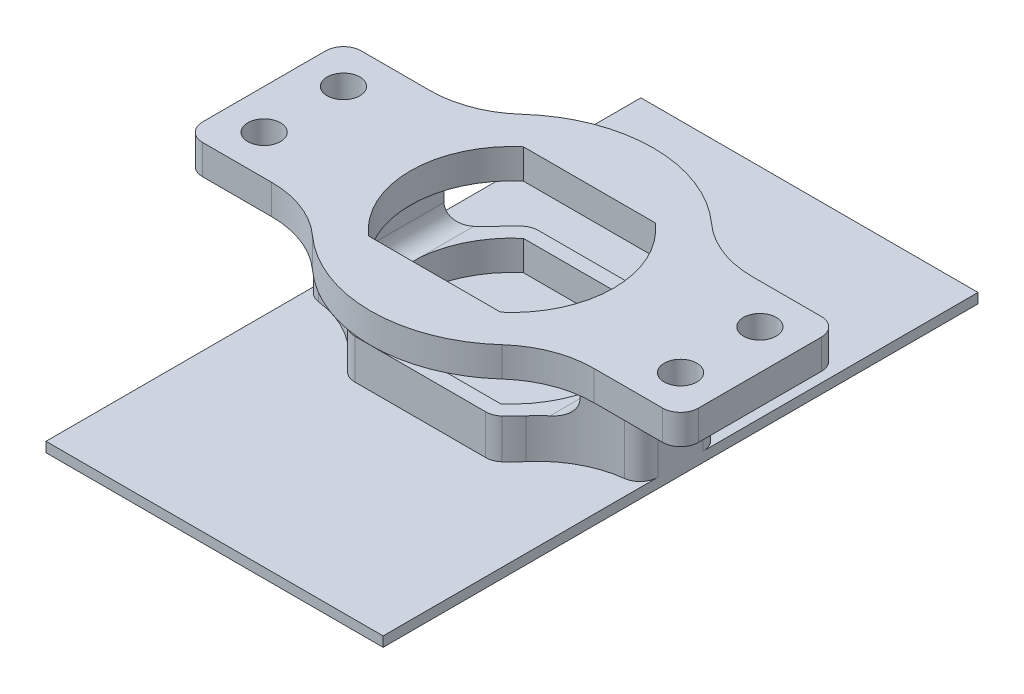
ISO-10303-21;
HEADER;
FILE_DESCRIPTION(('STEP AP214'),'2;1');
FILE_NAME('part.step','',(''),(''),'','','');
FILE_SCHEMA(('AUTOMOTIVE_DESIGN { 1 0 10303 214 1 1 1 1 }'));
ENDSEC;
DATA;
#1=APPLICATION_CONTEXT('core data for automotive mechanical design processes');
#2=APPLICATION_PROTOCOL_DEFINITION('international standard','automotive_design',2000,#1);
#3=PRODUCT_CONTEXT('',#1,'mechanical');
#4=PRODUCT('Part','Part','',(#3));
#5=PRODUCT_RELATED_PRODUCT_CATEGORY('part','',(#4));
#6=PRODUCT_DEFINITION_FORMATION('','',#4);
#7=PRODUCT_DEFINITION_CONTEXT('part definition',#1,'design');
#8=PRODUCT_DEFINITION('design','',#6,#7);
#9=PRODUCT_DEFINITION_SHAPE('','',#8);
#10=(LENGTH_UNIT() NAMED_UNIT(*) SI_UNIT(.MILLI.,.METRE.));
#11=(NAMED_UNIT(*) PLANE_ANGLE_UNIT() SI_UNIT($,.RADIAN.));
#12=(NAMED_UNIT(*) SI_UNIT($,.STERADIAN.) SOLID_ANGLE_UNIT());
#13=UNCERTAINTY_MEASURE_WITH_UNIT(LENGTH_MEASURE(1.E-05),#10,'distance_accuracy_value','');
#14=(GEOMETRIC_REPRESENTATION_CONTEXT(3) GLOBAL_UNCERTAINTY_ASSIGNED_CONTEXT((#13)) GLOBAL_UNIT_ASSIGNED_CONTEXT((#10,
#11,#12)) REPRESENTATION_CONTEXT('',''));
#15=CARTESIAN_POINT('',(0.,0.,0.));
#16=DIRECTION('',(0.,0.,1.));
#17=DIRECTION('',(1.,0.,0.));
#18=AXIS2_PLACEMENT_3D('',#15,#16,#17);
#19=CARTESIAN_POINT('',(0.,-5.,0.));
#20=DIRECTION('',(0.,1.,0.));
#21=DIRECTION('',(0.,0.,1.));
#22=AXIS2_PLACEMENT_3D('',#19,#20,#21);
#23=PLANE('',#22);
#24=CARTESIAN_POINT('',(0.,-5.,0.));
#25=DIRECTION('',(0.,1.,0.));
#26=DIRECTION('',(0.,0.,1.));
#27=AXIS2_PLACEMENT_3D('',#24,#25,#26);
#28=CIRCLE('',#27,10.25);
#29=CARTESIAN_POINT('',(-6.65,-5.,-7.8));
#30=VERTEX_POINT('',#29);
#31=CARTESIAN_POINT('',(-10.2,-5.,-1.01118742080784));
#32=VERTEX_POINT('',#31);
#33=EDGE_CURVE('E548',#30,#32,#28,.T.);
#34=ORIENTED_EDGE('',*,*,#33,.F.);
#35=DIRECTION('',(-1.,0.,0.));
#36=VECTOR('',#35,1.);
#37=CARTESIAN_POINT('',(-6.65,-5.,-7.8));
#38=LINE('',#37,#36);
#39=CARTESIAN_POINT('',(6.65,-5.,-7.8));
#40=VERTEX_POINT('',#39);
#41=EDGE_CURVE('E535',#40,#30,#38,.T.);
#42=ORIENTED_EDGE('',*,*,#41,.F.);
#43=CARTESIAN_POINT('',(0.,-5.,0.));
#44=DIRECTION('',(0.,1.,0.));
#45=DIRECTION('',(0.,0.,1.));
#46=AXIS2_PLACEMENT_3D('',#43,#44,#45);
#47=CIRCLE('',#46,10.25);
#48=CARTESIAN_POINT('',(10.2,-5.,-1.01118742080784));
#49=VERTEX_POINT('',#48);
#50=EDGE_CURVE('E558',#49,#40,#47,.T.);
#51=ORIENTED_EDGE('',*,*,#50,.F.);
#52=DIRECTION('',(0.,0.,-1.));
#53=VECTOR('',#52,1.);
#54=CARTESIAN_POINT('',(10.2,-5.,-5.14437082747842));
#55=LINE('',#54,#53);
#56=CARTESIAN_POINT('',(10.2,-5.,-6.35412085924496));
#57=VERTEX_POINT('',#56);
#58=EDGE_CURVE('E859',#49,#57,#55,.T.);
#59=ORIENTED_EDGE('',*,*,#58,.T.);
#60=CARTESIAN_POINT('',(16.6451945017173,-5.,-14.));
#61=DIRECTION('',(0.,1.,0.));
#62=DIRECTION('',(0.,0.,1.));
#63=AXIS2_PLACEMENT_3D('',#60,#61,#62);
#64=CIRCLE('',#63,10.);
#65=CARTESIAN_POINT('',(8.99223151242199,-5.,-7.5632183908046));
#66=VERTEX_POINT('',#65);
#67=EDGE_CURVE('E807',#57,#66,#64,.F.);
#68=ORIENTED_EDGE('',*,*,#67,.T.);
#69=CARTESIAN_POINT('',(0.,-5.,0.));
#70=DIRECTION('',(0.,1.,0.));
#71=DIRECTION('',(0.,0.,1.));
#72=AXIS2_PLACEMENT_3D('',#69,#70,#71);
#73=CIRCLE('',#72,11.75);
#74=CARTESIAN_POINT('',(7.78860025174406,-5.,-8.79773869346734));
#75=VERTEX_POINT('',#74);
#76=EDGE_CURVE('E594',#66,#75,#73,.T.);
#77=ORIENTED_EDGE('',*,*,#76,.T.);
#78=CARTESIAN_POINT('',(6.59545297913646,-5.,-7.45));
#79=DIRECTION('',(0.,1.,0.));
#80=DIRECTION('',(0.,0.,1.));
#81=AXIS2_PLACEMENT_3D('',#78,#79,#80);
#82=CIRCLE('',#81,1.8);
#83=CARTESIAN_POINT('',(6.59545297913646,-5.,-9.25));
#84=VERTEX_POINT('',#83);
#85=EDGE_CURVE('E847',#75,#84,#82,.T.);
#86=ORIENTED_EDGE('',*,*,#85,.T.);
#87=DIRECTION('',(-1.,0.,0.));
#88=VECTOR('',#87,1.);
#89=CARTESIAN_POINT('',(-7.24568837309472,-5.,-9.25));
#90=LINE('',#89,#88);
#91=CARTESIAN_POINT('',(-6.59545297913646,-5.,-9.25));
#92=VERTEX_POINT('',#91);
#93=EDGE_CURVE('E598',#84,#92,#90,.T.);
#94=ORIENTED_EDGE('',*,*,#93,.T.);
#95=CARTESIAN_POINT('',(-6.59545297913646,-5.,-7.45));
#96=DIRECTION('',(0.,1.,0.));
#97=DIRECTION('',(0.,0.,1.));
#98=AXIS2_PLACEMENT_3D('',#95,#96,#97);
#99=CIRCLE('',#98,1.8);
#100=CARTESIAN_POINT('',(-7.78860025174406,-5.,-8.79773869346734));
#101=VERTEX_POINT('',#100);
#102=EDGE_CURVE('E850',#92,#101,#99,.T.);
#103=ORIENTED_EDGE('',*,*,#102,.T.);
#104=CARTESIAN_POINT('',(0.,-5.,0.));
#105=DIRECTION('',(0.,1.,0.));
#106=DIRECTION('',(0.,0.,1.));
#107=AXIS2_PLACEMENT_3D('',#104,#105,#106);
#108=CIRCLE('',#107,11.75);
#109=CARTESIAN_POINT('',(-8.99223151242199,-5.,-7.5632183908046));
#110=VERTEX_POINT('',#109);
#111=EDGE_CURVE('E602',#101,#110,#108,.T.);
#112=ORIENTED_EDGE('',*,*,#111,.T.);
#113=CARTESIAN_POINT('',(-16.6451945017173,-5.,-14.));
#114=DIRECTION('',(0.,1.,0.));
#115=DIRECTION('',(0.,0.,1.));
#116=AXIS2_PLACEMENT_3D('',#113,#114,#115);
#117=CIRCLE('',#116,10.);
#118=CARTESIAN_POINT('',(-10.2,-5.,-6.35412085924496));
#119=VERTEX_POINT('',#118);
#120=EDGE_CURVE('E810',#110,#119,#117,.F.);
#121=ORIENTED_EDGE('',*,*,#120,.T.);
#122=DIRECTION('',(0.,0.,-1.));
#123=VECTOR('',#122,1.);
#124=CARTESIAN_POINT('',(-10.2,-5.,0.));
#125=LINE('',#124,#123);
#126=EDGE_CURVE('E866',#119,#32,#125,.F.);
#127=ORIENTED_EDGE('',*,*,#126,.T.);
#128=EDGE_LOOP('',(#34,#42,#51,#59,#68,#77,#86,#94,#103,#112,#121,#127));
#129=FACE_BOUND('',#128,.T.);
#130=ADVANCED_FACE('F53',(#129),#23,.T.);
#131=CARTESIAN_POINT('',(0.,0.,0.));
#132=DIRECTION('',(0.,1.,0.));
#133=DIRECTION('',(0.,0.,1.));
#134=AXIS2_PLACEMENT_3D('',#131,#132,#133);
#135=PLANE('',#134);
#136=CARTESIAN_POINT('',(16.6451945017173,0.,-14.));
#137=DIRECTION('',(0.,1.,0.));
#138=DIRECTION('',(0.,0.,1.));
#139=AXIS2_PLACEMENT_3D('',#136,#137,#138);
#140=CIRCLE('',#139,8.2);
#141=CARTESIAN_POINT('',(15.6409067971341,0.,-5.86173198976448));
#142=VERTEX_POINT('',#141);
#143=CARTESIAN_POINT('',(10.2,0.,-8.93053574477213));
#144=VERTEX_POINT('',#143);
#145=EDGE_CURVE('E1441',#142,#144,#140,.F.);
#146=ORIENTED_EDGE('',*,*,#145,.T.);
#147=DIRECTION('',(0.,0.,1.));
#148=VECTOR('',#147,1.);
#149=CARTESIAN_POINT('',(10.2,0.,0.));
#150=LINE('',#149,#148);
#151=CARTESIAN_POINT('',(10.2,0.,-1.01118742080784));
#152=VERTEX_POINT('',#151);
#153=EDGE_CURVE('E1438',#144,#152,#150,.T.);
#154=ORIENTED_EDGE('',*,*,#153,.T.);
#155=CARTESIAN_POINT('',(0.,0.,0.));
#156=DIRECTION('',(0.,1.,0.));
#157=DIRECTION('',(0.,0.,1.));
#158=AXIS2_PLACEMENT_3D('',#155,#156,#157);
#159=CIRCLE('',#158,10.25);
#160=CARTESIAN_POINT('',(6.65,0.,-7.8));
#161=VERTEX_POINT('',#160);
#162=EDGE_CURVE('E663',#152,#161,#159,.T.);
#163=ORIENTED_EDGE('',*,*,#162,.T.);
#164=DIRECTION('',(-1.,0.,0.));
#165=VECTOR('',#164,1.);
#166=CARTESIAN_POINT('',(-6.65,0.,-7.8));
#167=LINE('',#166,#165);
#168=CARTESIAN_POINT('',(-6.65,0.,-7.8));
#169=VERTEX_POINT('',#168);
#170=EDGE_CURVE('E643',#161,#169,#167,.T.);
#171=ORIENTED_EDGE('',*,*,#170,.T.);
#172=CARTESIAN_POINT('',(0.,0.,0.));
#173=DIRECTION('',(0.,1.,0.));
#174=DIRECTION('',(0.,0.,1.));
#175=AXIS2_PLACEMENT_3D('',#172,#173,#174);
#176=CIRCLE('',#175,10.25);
#177=CARTESIAN_POINT('',(-10.2,0.,-1.01118742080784));
#178=VERTEX_POINT('',#177);
#179=EDGE_CURVE('E654',#169,#178,#176,.T.);
#180=ORIENTED_EDGE('',*,*,#179,.T.);
#181=DIRECTION('',(0.,0.,1.));
#182=VECTOR('',#181,1.);
#183=CARTESIAN_POINT('',(-10.2,0.,-5.14437082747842));
#184=LINE('',#183,#182);
#185=CARTESIAN_POINT('',(-10.2,0.,-8.93053574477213));
#186=VERTEX_POINT('',#185);
#187=EDGE_CURVE('E1458',#178,#186,#184,.F.);
#188=ORIENTED_EDGE('',*,*,#187,.T.);
#189=CARTESIAN_POINT('',(-16.6451945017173,0.,-14.));
#190=DIRECTION('',(0.,1.,0.));
#191=DIRECTION('',(0.,0.,1.));
#192=AXIS2_PLACEMENT_3D('',#189,#190,#191);
#193=CIRCLE('',#192,8.2);
#194=CARTESIAN_POINT('',(-15.6409067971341,0.,-5.86173198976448));
#195=VERTEX_POINT('',#194);
#196=EDGE_CURVE('E1461',#186,#195,#193,.F.);
#197=ORIENTED_EDGE('',*,*,#196,.T.);
#198=CARTESIAN_POINT('',(-15.2,0.,-2.28883383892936));
#199=DIRECTION('',(0.,1.,0.));
#200=DIRECTION('',(0.,0.,1.));
#201=AXIS2_PLACEMENT_3D('',#198,#199,#200);
#202=CIRCLE('',#201,3.6);
#203=CARTESIAN_POINT('',(-18.8,0.,-2.28883383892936));
#204=VERTEX_POINT('',#203);
#205=EDGE_CURVE('E1465',#195,#204,#202,.T.);
#206=ORIENTED_EDGE('',*,*,#205,.T.);
#207=DIRECTION('',(0.,0.,-1.));
#208=VECTOR('',#207,1.);
#209=CARTESIAN_POINT('',(-18.8,0.,2.28883383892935));
#210=LINE('',#209,#208);
#211=CARTESIAN_POINT('',(-18.8,0.,2.28883383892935));
#212=VERTEX_POINT('',#211);
#213=EDGE_CURVE('E1468',#204,#212,#210,.F.);
#214=ORIENTED_EDGE('',*,*,#213,.T.);
#215=CARTESIAN_POINT('',(-15.2,0.,2.28883383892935));
#216=DIRECTION('',(0.,1.,0.));
#217=DIRECTION('',(0.,0.,1.));
#218=AXIS2_PLACEMENT_3D('',#215,#216,#217);
#219=CIRCLE('',#218,3.6);
#220=CARTESIAN_POINT('',(-15.6409067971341,0.,5.86173198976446));
#221=VERTEX_POINT('',#220);
#222=EDGE_CURVE('E1471',#212,#221,#219,.T.);
#223=ORIENTED_EDGE('',*,*,#222,.T.);
#224=CARTESIAN_POINT('',(-16.6451945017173,0.,14.));
#225=DIRECTION('',(0.,1.,0.));
#226=DIRECTION('',(0.,0.,1.));
#227=AXIS2_PLACEMENT_3D('',#224,#225,#226);
#228=CIRCLE('',#227,8.2);
#229=CARTESIAN_POINT('',(-10.2,0.,8.93053574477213));
#230=VERTEX_POINT('',#229);
#231=EDGE_CURVE('E1030',#221,#230,#228,.F.);
#232=ORIENTED_EDGE('',*,*,#231,.T.);
#233=DIRECTION('',(0.,0.,1.));
#234=VECTOR('',#233,1.);
#235=CARTESIAN_POINT('',(-10.2,0.,-5.14437082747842));
#236=LINE('',#235,#234);
#237=CARTESIAN_POINT('',(-10.2,0.,1.01118742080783));
#238=VERTEX_POINT('',#237);
#239=EDGE_CURVE('E1473',#230,#238,#236,.F.);
#240=ORIENTED_EDGE('',*,*,#239,.T.);
#241=CARTESIAN_POINT('',(-6.65,0.,7.8));
#242=VERTEX_POINT('',#241);
#243=EDGE_CURVE('E635',#238,#242,#176,.T.);
#244=ORIENTED_EDGE('',*,*,#243,.T.);
#245=DIRECTION('',(1.,0.,0.));
#246=VECTOR('',#245,1.);
#247=CARTESIAN_POINT('',(-6.65,0.,7.8));
#248=LINE('',#247,#246);
#249=CARTESIAN_POINT('',(6.65,0.,7.8));
#250=VERTEX_POINT('',#249);
#251=EDGE_CURVE('E658',#242,#250,#248,.T.);
#252=ORIENTED_EDGE('',*,*,#251,.T.);
#253=CARTESIAN_POINT('',(10.2,0.,1.01118742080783));
#254=VERTEX_POINT('',#253);
#255=EDGE_CURVE('E664',#250,#254,#159,.T.);
#256=ORIENTED_EDGE('',*,*,#255,.T.);
#257=DIRECTION('',(0.,0.,1.));
#258=VECTOR('',#257,1.);
#259=CARTESIAN_POINT('',(10.2,0.,0.));
#260=LINE('',#259,#258);
#261=CARTESIAN_POINT('',(10.2,0.,8.93053574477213));
#262=VERTEX_POINT('',#261);
#263=EDGE_CURVE('E1453',#254,#262,#260,.T.);
#264=ORIENTED_EDGE('',*,*,#263,.T.);
#265=CARTESIAN_POINT('',(16.6451945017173,0.,14.));
#266=DIRECTION('',(0.,1.,0.));
#267=DIRECTION('',(0.,0.,1.));
#268=AXIS2_PLACEMENT_3D('',#265,#266,#267);
#269=CIRCLE('',#268,8.2);
#270=CARTESIAN_POINT('',(15.6409067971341,0.,5.86173198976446));
#271=VERTEX_POINT('',#270);
#272=EDGE_CURVE('E1378',#262,#271,#269,.F.);
#273=ORIENTED_EDGE('',*,*,#272,.T.);
#274=CARTESIAN_POINT('',(15.2,0.,2.28883383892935));
#275=DIRECTION('',(0.,1.,0.));
#276=DIRECTION('',(0.,0.,1.));
#277=AXIS2_PLACEMENT_3D('',#274,#275,#276);
#278=CIRCLE('',#277,3.6);
#279=CARTESIAN_POINT('',(18.8,0.,2.28883383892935));
#280=VERTEX_POINT('',#279);
#281=EDGE_CURVE('E1374',#271,#280,#278,.T.);
#282=ORIENTED_EDGE('',*,*,#281,.T.);
#283=DIRECTION('',(0.,0.,-1.));
#284=VECTOR('',#283,1.);
#285=CARTESIAN_POINT('',(18.8,0.,0.));
#286=LINE('',#285,#284);
#287=CARTESIAN_POINT('',(18.8,0.,-2.28883383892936));
#288=VERTEX_POINT('',#287);
#289=EDGE_CURVE('E1448',#280,#288,#286,.T.);
#290=ORIENTED_EDGE('',*,*,#289,.T.);
#291=CARTESIAN_POINT('',(15.2,0.,-2.28883383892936));
#292=DIRECTION('',(0.,1.,0.));
#293=DIRECTION('',(0.,0.,1.));
#294=AXIS2_PLACEMENT_3D('',#291,#292,#293);
#295=CIRCLE('',#294,3.6);
#296=EDGE_CURVE('E1445',#288,#142,#295,.T.);
#297=ORIENTED_EDGE('',*,*,#296,.T.);
#298=EDGE_LOOP('',(#146,#154,#163,#171,#180,#188,#197,#206,#214,#223,#232,#240,#244,#252,#256,
#264,#273,#282,#290,#297));
#299=FACE_BOUND('',#298,.T.);
#300=CARTESIAN_POINT('',(21.,0.,3.99999999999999));
#301=DIRECTION('',(0.,1.,0.));
#302=DIRECTION('',(0.,0.,1.));
#303=AXIS2_PLACEMENT_3D('',#300,#301,#302);
#304=CIRCLE('',#303,1.65);
#305=CARTESIAN_POINT('',(21.,0.,5.64999999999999));
#306=VERTEX_POINT('',#305);
#307=EDGE_CURVE('E606',#306,#306,#304,.T.);
#308=ORIENTED_EDGE('',*,*,#307,.T.);
#309=EDGE_LOOP('',(#308));
#310=FACE_BOUND('',#309,.T.);
#311=CARTESIAN_POINT('',(21.,0.,-4.));
#312=DIRECTION('',(0.,1.,0.));
#313=DIRECTION('',(0.,0.,1.));
#314=AXIS2_PLACEMENT_3D('',#311,#312,#313);
#315=CIRCLE('',#314,1.65);
#316=CARTESIAN_POINT('',(21.,0.,-2.35));
#317=VERTEX_POINT('',#316);
#318=EDGE_CURVE('E611',#317,#317,#315,.T.);
#319=ORIENTED_EDGE('',*,*,#318,.T.);
#320=EDGE_LOOP('',(#319));
#321=FACE_BOUND('',#320,.T.);
#322=CARTESIAN_POINT('',(-21.,0.,4.));
#323=DIRECTION('',(0.,1.,0.));
#324=DIRECTION('',(0.,0.,1.));
#325=AXIS2_PLACEMENT_3D('',#322,#323,#324);
#326=CIRCLE('',#325,1.65);
#327=CARTESIAN_POINT('',(-21.,0.,5.65));
#328=VERTEX_POINT('',#327);
#329=EDGE_CURVE('E619',#328,#328,#326,.T.);
#330=ORIENTED_EDGE('',*,*,#329,.T.);
#331=EDGE_LOOP('',(#330));
#332=FACE_BOUND('',#331,.T.);
#333=CARTESIAN_POINT('',(-21.,0.,-4.));
#334=DIRECTION('',(0.,1.,0.));
#335=DIRECTION('',(0.,0.,1.));
#336=AXIS2_PLACEMENT_3D('',#333,#334,#335);
#337=CIRCLE('',#336,1.65);
#338=CARTESIAN_POINT('',(-21.,0.,-2.35));
#339=VERTEX_POINT('',#338);
#340=EDGE_CURVE('E627',#339,#339,#337,.T.);
#341=ORIENTED_EDGE('',*,*,#340,.T.);
#342=EDGE_LOOP('',(#341));
#343=FACE_BOUND('',#342,.T.);
#344=DIRECTION('',(-1.,0.,0.));
#345=VECTOR('',#344,1.);
#346=CARTESIAN_POINT('',(11.7924764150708,0.,-8.00000000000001));
#347=LINE('',#346,#345);
#348=CARTESIAN_POINT('',(23.2,0.,-8.));
#349=VERTEX_POINT('',#348);
#350=CARTESIAN_POINT('',(16.25,0.,-8.));
#351=VERTEX_POINT('',#350);
#352=EDGE_CURVE('E692',#349,#351,#347,.T.);
#353=ORIENTED_EDGE('',*,*,#352,.F.);
#354=CARTESIAN_POINT('',(23.2,0.,-6.2));
#355=DIRECTION('',(0.,1.,0.));
#356=DIRECTION('',(0.,0.,1.));
#357=AXIS2_PLACEMENT_3D('',#354,#355,#356);
#358=CIRCLE('',#357,1.8);
#359=CARTESIAN_POINT('',(25.,0.,-6.2));
#360=VERTEX_POINT('',#359);
#361=EDGE_CURVE('E940',#349,#360,#358,.F.);
#362=ORIENTED_EDGE('',*,*,#361,.T.);
#363=DIRECTION('',(0.,0.,-1.));
#364=VECTOR('',#363,1.);
#365=CARTESIAN_POINT('',(25.,0.,-8.));
#366=LINE('',#365,#364);
#367=CARTESIAN_POINT('',(25.,0.,6.2));
#368=VERTEX_POINT('',#367);
#369=EDGE_CURVE('E741',#368,#360,#366,.T.);
#370=ORIENTED_EDGE('',*,*,#369,.F.);
#371=CARTESIAN_POINT('',(23.2,0.,6.2));
#372=DIRECTION('',(0.,1.,0.));
#373=DIRECTION('',(0.,0.,1.));
#374=AXIS2_PLACEMENT_3D('',#371,#372,#373);
#375=CIRCLE('',#374,1.8);
#376=CARTESIAN_POINT('',(23.2,0.,8.));
#377=VERTEX_POINT('',#376);
#378=EDGE_CURVE('E937',#368,#377,#375,.F.);
#379=ORIENTED_EDGE('',*,*,#378,.T.);
#380=DIRECTION('',(1.,0.,0.));
#381=VECTOR('',#380,1.);
#382=CARTESIAN_POINT('',(25.,0.,8.));
#383=LINE('',#382,#381);
#384=CARTESIAN_POINT('',(16.25,0.,8.));
#385=VERTEX_POINT('',#384);
#386=EDGE_CURVE('E737',#385,#377,#383,.T.);
#387=ORIENTED_EDGE('',*,*,#386,.F.);
#388=CARTESIAN_POINT('',(16.25,0.,18.));
#389=DIRECTION('',(0.,1.,0.));
#390=DIRECTION('',(0.,0.,1.));
#391=AXIS2_PLACEMENT_3D('',#388,#389,#390);
#392=CIRCLE('',#391,10.);
#393=CARTESIAN_POINT('',(9.54896907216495,0.,10.5773195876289));
#394=VERTEX_POINT('',#393);
#395=EDGE_CURVE('E817',#385,#394,#392,.T.);
#396=ORIENTED_EDGE('',*,*,#395,.T.);
#397=CARTESIAN_POINT('',(0.,0.,0.));
#398=DIRECTION('',(0.,1.,0.));
#399=DIRECTION('',(0.,0.,1.));
#400=AXIS2_PLACEMENT_3D('',#397,#398,#399);
#401=CIRCLE('',#400,14.25);
#402=CARTESIAN_POINT('',(-9.54896907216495,0.,10.5773195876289));
#403=VERTEX_POINT('',#402);
#404=EDGE_CURVE('E733',#403,#394,#401,.T.);
#405=ORIENTED_EDGE('',*,*,#404,.F.);
#406=CARTESIAN_POINT('',(-16.25,0.,18.));
#407=DIRECTION('',(0.,1.,0.));
#408=DIRECTION('',(0.,0.,1.));
#409=AXIS2_PLACEMENT_3D('',#406,#407,#408);
#410=CIRCLE('',#409,10.);
#411=CARTESIAN_POINT('',(-16.25,0.,8.));
#412=VERTEX_POINT('',#411);
#413=EDGE_CURVE('E836',#403,#412,#410,.T.);
#414=ORIENTED_EDGE('',*,*,#413,.T.);
#415=DIRECTION('',(1.,0.,0.));
#416=VECTOR('',#415,1.);
#417=CARTESIAN_POINT('',(-25.,0.,8.));
#418=LINE('',#417,#416);
#419=CARTESIAN_POINT('',(-23.2,0.,8.));
#420=VERTEX_POINT('',#419);
#421=EDGE_CURVE('E730',#420,#412,#418,.T.);
#422=ORIENTED_EDGE('',*,*,#421,.F.);
#423=CARTESIAN_POINT('',(-23.2,0.,6.2));
#424=DIRECTION('',(0.,1.,0.));
#425=DIRECTION('',(0.,0.,1.));
#426=AXIS2_PLACEMENT_3D('',#423,#424,#425);
#427=CIRCLE('',#426,1.8);
#428=CARTESIAN_POINT('',(-25.,0.,6.2));
#429=VERTEX_POINT('',#428);
#430=EDGE_CURVE('E931',#420,#429,#427,.F.);
#431=ORIENTED_EDGE('',*,*,#430,.T.);
#432=DIRECTION('',(0.,0.,1.));
#433=VECTOR('',#432,1.);
#434=CARTESIAN_POINT('',(-25.,0.,-8.));
#435=LINE('',#434,#433);
#436=CARTESIAN_POINT('',(-25.,0.,-6.2));
#437=VERTEX_POINT('',#436);
#438=EDGE_CURVE('E726',#437,#429,#435,.T.);
#439=ORIENTED_EDGE('',*,*,#438,.F.);
#440=CARTESIAN_POINT('',(-23.2,0.,-6.2));
#441=DIRECTION('',(0.,1.,0.));
#442=DIRECTION('',(0.,0.,1.));
#443=AXIS2_PLACEMENT_3D('',#440,#441,#442);
#444=CIRCLE('',#443,1.8);
#445=CARTESIAN_POINT('',(-23.2,0.,-8.));
#446=VERTEX_POINT('',#445);
#447=EDGE_CURVE('E934',#437,#446,#444,.F.);
#448=ORIENTED_EDGE('',*,*,#447,.T.);
#449=DIRECTION('',(-1.,0.,0.));
#450=VECTOR('',#449,1.);
#451=CARTESIAN_POINT('',(-11.7924764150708,0.,-8.));
#452=LINE('',#451,#450);
#453=CARTESIAN_POINT('',(-16.25,0.,-8.));
#454=VERTEX_POINT('',#453);
#455=EDGE_CURVE('E722',#454,#446,#452,.T.);
#456=ORIENTED_EDGE('',*,*,#455,.F.);
#457=CARTESIAN_POINT('',(-16.25,0.,-18.));
#458=DIRECTION('',(0.,1.,0.));
#459=DIRECTION('',(0.,0.,1.));
#460=AXIS2_PLACEMENT_3D('',#457,#458,#459);
#461=CIRCLE('',#460,10.);
#462=CARTESIAN_POINT('',(-9.54896907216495,0.,-10.5773195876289));
#463=VERTEX_POINT('',#462);
#464=EDGE_CURVE('E830',#454,#463,#461,.T.);
#465=ORIENTED_EDGE('',*,*,#464,.T.);
#466=CARTESIAN_POINT('',(0.,0.,0.));
#467=DIRECTION('',(0.,1.,0.));
#468=DIRECTION('',(0.,0.,1.));
#469=AXIS2_PLACEMENT_3D('',#466,#467,#468);
#470=CIRCLE('',#469,14.25);
#471=CARTESIAN_POINT('',(9.54896907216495,0.,-10.5773195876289));
#472=VERTEX_POINT('',#471);
#473=EDGE_CURVE('E686',#472,#463,#470,.T.);
#474=ORIENTED_EDGE('',*,*,#473,.F.);
#475=CARTESIAN_POINT('',(16.25,0.,-18.));
#476=DIRECTION('',(0.,1.,0.));
#477=DIRECTION('',(0.,0.,1.));
#478=AXIS2_PLACEMENT_3D('',#475,#476,#477);
#479=CIRCLE('',#478,10.);
#480=EDGE_CURVE('E823',#472,#351,#479,.T.);
#481=ORIENTED_EDGE('',*,*,#480,.T.);
#482=EDGE_LOOP('',(#353,#362,#370,#379,#387,#396,#405,#414,#422,#431,#439,#448,#456,#465,#474,#481));
#483=FACE_BOUND('',#482,.T.);
#484=ADVANCED_FACE('F1049',(#299,#310,#321,#332,#343,#483),#135,.F.);
#485=CARTESIAN_POINT('',(0.,3.,0.));
#486=DIRECTION('',(0.,1.,0.));
#487=DIRECTION('',(0.,0.,1.));
#488=AXIS2_PLACEMENT_3D('',#485,#486,#487);
#489=PLANE('',#488);
#490=CARTESIAN_POINT('',(21.,3.,-4.));
#491=DIRECTION('',(0.,1.,0.));
#492=DIRECTION('',(0.,0.,1.));
#493=AXIS2_PLACEMENT_3D('',#490,#491,#492);
#494=CIRCLE('',#493,1.65);
#495=CARTESIAN_POINT('',(21.,3.,-2.35));
#496=VERTEX_POINT('',#495);
#497=EDGE_CURVE('E615',#496,#496,#494,.T.);
#498=ORIENTED_EDGE('',*,*,#497,.F.);
#499=EDGE_LOOP('',(#498));
#500=FACE_BOUND('',#499,.T.);
#501=CARTESIAN_POINT('',(-21.,3.,-4.));
#502=DIRECTION('',(0.,1.,0.));
#503=DIRECTION('',(0.,0.,1.));
#504=AXIS2_PLACEMENT_3D('',#501,#502,#503);
#505=CIRCLE('',#504,1.65);
#506=CARTESIAN_POINT('',(-21.,3.,-2.35));
#507=VERTEX_POINT('',#506);
#508=EDGE_CURVE('E631',#507,#507,#505,.T.);
#509=ORIENTED_EDGE('',*,*,#508,.F.);
#510=EDGE_LOOP('',(#509));
#511=FACE_BOUND('',#510,.T.);
#512=DIRECTION('',(0.,0.,-1.));
#513=VECTOR('',#512,1.);
#514=CARTESIAN_POINT('',(25.,3.,-8.));
#515=LINE('',#514,#513);
#516=CARTESIAN_POINT('',(25.,3.,6.2));
#517=VERTEX_POINT('',#516);
#518=CARTESIAN_POINT('',(25.,3.,-6.2));
#519=VERTEX_POINT('',#518);
#520=EDGE_CURVE('E711',#517,#519,#515,.T.);
#521=ORIENTED_EDGE('',*,*,#520,.T.);
#522=CARTESIAN_POINT('',(23.2,3.,-6.2));
#523=DIRECTION('',(0.,1.,0.));
#524=DIRECTION('',(0.,0.,1.));
#525=AXIS2_PLACEMENT_3D('',#522,#523,#524);
#526=CIRCLE('',#525,1.8);
#527=CARTESIAN_POINT('',(23.2,3.,-8.));
#528=VERTEX_POINT('',#527);
#529=EDGE_CURVE('E959',#519,#528,#526,.T.);
#530=ORIENTED_EDGE('',*,*,#529,.T.);
#531=DIRECTION('',(-1.,0.,0.));
#532=VECTOR('',#531,1.);
#533=CARTESIAN_POINT('',(11.7924764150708,3.,-8.00000000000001));
#534=LINE('',#533,#532);
#535=CARTESIAN_POINT('',(16.25,3.,-8.));
#536=VERTEX_POINT('',#535);
#537=EDGE_CURVE('E715',#528,#536,#534,.T.);
#538=ORIENTED_EDGE('',*,*,#537,.T.);
#539=CARTESIAN_POINT('',(16.25,3.,-18.));
#540=DIRECTION('',(0.,1.,0.));
#541=DIRECTION('',(0.,0.,1.));
#542=AXIS2_PLACEMENT_3D('',#539,#540,#541);
#543=CIRCLE('',#542,10.);
#544=CARTESIAN_POINT('',(9.54896907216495,3.,-10.5773195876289));
#545=VERTEX_POINT('',#544);
#546=EDGE_CURVE('E827',#536,#545,#543,.F.);
#547=ORIENTED_EDGE('',*,*,#546,.T.);
#548=CARTESIAN_POINT('',(0.,3.,0.));
#549=DIRECTION('',(0.,1.,0.));
#550=DIRECTION('',(0.,0.,1.));
#551=AXIS2_PLACEMENT_3D('',#548,#549,#550);
#552=CIRCLE('',#551,14.25);
#553=CARTESIAN_POINT('',(-9.54896907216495,3.,-10.5773195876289));
#554=VERTEX_POINT('',#553);
#555=EDGE_CURVE('E687',#545,#554,#552,.T.);
#556=ORIENTED_EDGE('',*,*,#555,.T.);
#557=CARTESIAN_POINT('',(-16.25,3.,-18.));
#558=DIRECTION('',(0.,1.,0.));
#559=DIRECTION('',(0.,0.,1.));
#560=AXIS2_PLACEMENT_3D('',#557,#558,#559);
#561=CIRCLE('',#560,10.);
#562=CARTESIAN_POINT('',(-16.25,3.,-8.));
#563=VERTEX_POINT('',#562);
#564=EDGE_CURVE('E833',#554,#563,#561,.F.);
#565=ORIENTED_EDGE('',*,*,#564,.T.);
#566=DIRECTION('',(-1.,0.,0.));
#567=VECTOR('',#566,1.);
#568=CARTESIAN_POINT('',(-11.7924764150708,3.,-8.));
#569=LINE('',#568,#567);
#570=CARTESIAN_POINT('',(-23.2,3.,-8.));
#571=VERTEX_POINT('',#570);
#572=EDGE_CURVE('E691',#563,#571,#569,.T.);
#573=ORIENTED_EDGE('',*,*,#572,.T.);
#574=CARTESIAN_POINT('',(-23.2,3.,-6.2));
#575=DIRECTION('',(0.,1.,0.));
#576=DIRECTION('',(0.,0.,1.));
#577=AXIS2_PLACEMENT_3D('',#574,#575,#576);
#578=CIRCLE('',#577,1.8);
#579=CARTESIAN_POINT('',(-25.,3.,-6.2));
#580=VERTEX_POINT('',#579);
#581=EDGE_CURVE('E953',#571,#580,#578,.T.);
#582=ORIENTED_EDGE('',*,*,#581,.T.);
#583=DIRECTION('',(0.,0.,1.));
#584=VECTOR('',#583,1.);
#585=CARTESIAN_POINT('',(-25.,3.,-8.));
#586=LINE('',#585,#584);
#587=CARTESIAN_POINT('',(-25.,3.,6.2));
#588=VERTEX_POINT('',#587);
#589=EDGE_CURVE('E696',#580,#588,#586,.T.);
#590=ORIENTED_EDGE('',*,*,#589,.T.);
#591=CARTESIAN_POINT('',(-23.2,3.,6.2));
#592=DIRECTION('',(0.,1.,0.));
#593=DIRECTION('',(0.,0.,1.));
#594=AXIS2_PLACEMENT_3D('',#591,#592,#593);
#595=CIRCLE('',#594,1.8);
#596=CARTESIAN_POINT('',(-23.2,3.,8.));
#597=VERTEX_POINT('',#596);
#598=EDGE_CURVE('E950',#588,#597,#595,.T.);
#599=ORIENTED_EDGE('',*,*,#598,.T.);
#600=DIRECTION('',(1.,0.,0.));
#601=VECTOR('',#600,1.);
#602=CARTESIAN_POINT('',(-25.,3.,8.));
#603=LINE('',#602,#601);
#604=CARTESIAN_POINT('',(-16.25,3.,8.));
#605=VERTEX_POINT('',#604);
#606=EDGE_CURVE('E700',#597,#605,#603,.T.);
#607=ORIENTED_EDGE('',*,*,#606,.T.);
#608=CARTESIAN_POINT('',(-16.25,3.,18.));
#609=DIRECTION('',(0.,1.,0.));
#610=DIRECTION('',(0.,0.,1.));
#611=AXIS2_PLACEMENT_3D('',#608,#609,#610);
#612=CIRCLE('',#611,10.);
#613=CARTESIAN_POINT('',(-9.54896907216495,3.,10.5773195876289));
#614=VERTEX_POINT('',#613);
#615=EDGE_CURVE('E840',#605,#614,#612,.F.);
#616=ORIENTED_EDGE('',*,*,#615,.T.);
#617=CARTESIAN_POINT('',(0.,3.,0.));
#618=DIRECTION('',(0.,1.,0.));
#619=DIRECTION('',(0.,0.,1.));
#620=AXIS2_PLACEMENT_3D('',#617,#618,#619);
#621=CIRCLE('',#620,14.25);
#622=CARTESIAN_POINT('',(9.54896907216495,3.,10.5773195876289));
#623=VERTEX_POINT('',#622);
#624=EDGE_CURVE('E703',#614,#623,#621,.T.);
#625=ORIENTED_EDGE('',*,*,#624,.T.);
#626=CARTESIAN_POINT('',(16.25,3.,18.));
#627=DIRECTION('',(0.,1.,0.));
#628=DIRECTION('',(0.,0.,1.));
#629=AXIS2_PLACEMENT_3D('',#626,#627,#628);
#630=CIRCLE('',#629,10.);
#631=CARTESIAN_POINT('',(16.25,3.,8.));
#632=VERTEX_POINT('',#631);
#633=EDGE_CURVE('E820',#623,#632,#630,.F.);
#634=ORIENTED_EDGE('',*,*,#633,.T.);
#635=DIRECTION('',(1.,0.,0.));
#636=VECTOR('',#635,1.);
#637=CARTESIAN_POINT('',(25.,3.,8.));
#638=LINE('',#637,#636);
#639=CARTESIAN_POINT('',(23.2,3.,8.));
#640=VERTEX_POINT('',#639);
#641=EDGE_CURVE('E707',#632,#640,#638,.T.);
#642=ORIENTED_EDGE('',*,*,#641,.T.);
#643=CARTESIAN_POINT('',(23.2,3.,6.2));
#644=DIRECTION('',(0.,1.,0.));
#645=DIRECTION('',(0.,0.,1.));
#646=AXIS2_PLACEMENT_3D('',#643,#644,#645);
#647=CIRCLE('',#646,1.8);
#648=EDGE_CURVE('E956',#640,#517,#647,.T.);
#649=ORIENTED_EDGE('',*,*,#648,.T.);
#650=EDGE_LOOP('',(#521,#530,#538,#547,#556,#565,#573,#582,#590,#599,#607,#616,#625,#634,#642,#649));
#651=FACE_BOUND('',#650,.T.);
#652=DIRECTION('',(1.,0.,0.));
#653=VECTOR('',#652,1.);
#654=CARTESIAN_POINT('',(-6.65,3.,7.8));
#655=LINE('',#654,#653);
#656=CARTESIAN_POINT('',(-6.65,3.,7.8));
#657=VERTEX_POINT('',#656);
#658=CARTESIAN_POINT('',(6.65,3.,7.8));
#659=VERTEX_POINT('',#658);
#660=EDGE_CURVE('E642',#657,#659,#655,.T.);
#661=ORIENTED_EDGE('',*,*,#660,.F.);
#662=CARTESIAN_POINT('',(0.,3.,0.));
#663=DIRECTION('',(0.,1.,0.));
#664=DIRECTION('',(0.,0.,1.));
#665=AXIS2_PLACEMENT_3D('',#662,#663,#664);
#666=CIRCLE('',#665,10.25);
#667=CARTESIAN_POINT('',(-6.65,3.,-7.8));
#668=VERTEX_POINT('',#667);
#669=EDGE_CURVE('E639',#668,#657,#666,.T.);
#670=ORIENTED_EDGE('',*,*,#669,.F.);
#671=DIRECTION('',(-1.,0.,0.));
#672=VECTOR('',#671,1.);
#673=CARTESIAN_POINT('',(-6.65,3.,-7.8));
#674=LINE('',#673,#672);
#675=CARTESIAN_POINT('',(6.65,3.,-7.8));
#676=VERTEX_POINT('',#675);
#677=EDGE_CURVE('E650',#676,#668,#674,.T.);
#678=ORIENTED_EDGE('',*,*,#677,.F.);
#679=CARTESIAN_POINT('',(0.,3.,0.));
#680=DIRECTION('',(0.,1.,0.));
#681=DIRECTION('',(0.,0.,1.));
#682=AXIS2_PLACEMENT_3D('',#679,#680,#681);
#683=CIRCLE('',#682,10.25);
#684=EDGE_CURVE('E646',#659,#676,#683,.T.);
#685=ORIENTED_EDGE('',*,*,#684,.F.);
#686=EDGE_LOOP('',(#661,#670,#678,#685));
#687=FACE_BOUND('',#686,.T.);
#688=CARTESIAN_POINT('',(-21.,3.,4.));
#689=DIRECTION('',(0.,1.,0.));
#690=DIRECTION('',(0.,0.,1.));
#691=AXIS2_PLACEMENT_3D('',#688,#689,#690);
#692=CIRCLE('',#691,1.65);
#693=CARTESIAN_POINT('',(-21.,3.,5.65));
#694=VERTEX_POINT('',#693);
#695=EDGE_CURVE('E623',#694,#694,#692,.T.);
#696=ORIENTED_EDGE('',*,*,#695,.F.);
#697=EDGE_LOOP('',(#696));
#698=FACE_BOUND('',#697,.T.);
#699=CARTESIAN_POINT('',(21.,3.,3.99999999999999));
#700=DIRECTION('',(0.,1.,0.));
#701=DIRECTION('',(0.,0.,1.));
#702=AXIS2_PLACEMENT_3D('',#699,#700,#701);
#703=CIRCLE('',#702,1.65);
#704=CARTESIAN_POINT('',(21.,3.,5.64999999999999));
#705=VERTEX_POINT('',#704);
#706=EDGE_CURVE('E607',#705,#705,#703,.T.);
#707=ORIENTED_EDGE('',*,*,#706,.F.);
#708=EDGE_LOOP('',(#707));
#709=FACE_BOUND('',#708,.T.);
#710=ADVANCED_FACE('F1056',(#500,#511,#651,#687,#698,#709),#489,.T.);
#711=CARTESIAN_POINT('',(0.,3.,0.));
#712=DIRECTION('',(0.,-1.,0.));
#713=DIRECTION('',(0.,0.,-1.));
#714=AXIS2_PLACEMENT_3D('',#711,#712,#713);
#715=CYLINDRICAL_SURFACE('',#714,14.25);
#716=ORIENTED_EDGE('',*,*,#555,.F.);
#717=DIRECTION('',(0.,-1.,0.));
#718=VECTOR('',#717,1.);
#719=CARTESIAN_POINT('',(9.54896907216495,3.,-10.5773195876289));
#720=LINE('',#719,#718);
#721=EDGE_CURVE('E774',#545,#472,#720,.T.);
#722=ORIENTED_EDGE('',*,*,#721,.T.);
#723=ORIENTED_EDGE('',*,*,#473,.T.);
#724=DIRECTION('',(0.,-1.,0.));
#725=VECTOR('',#724,1.);
#726=CARTESIAN_POINT('',(-9.54896907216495,3.,-10.5773195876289));
#727=LINE('',#726,#725);
#728=EDGE_CURVE('E771',#463,#554,#727,.F.);
#729=ORIENTED_EDGE('',*,*,#728,.T.);
#730=EDGE_LOOP('',(#716,#722,#723,#729));
#731=FACE_BOUND('',#730,.T.);
#732=ADVANCED_FACE('F1634',(#731),#715,.T.);
#733=CARTESIAN_POINT('',(-11.7924764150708,3.,-8.));
#734=DIRECTION('',(0.,0.,1.));
#735=DIRECTION('',(1.,0.,0.));
#736=AXIS2_PLACEMENT_3D('',#733,#734,#735);
#737=PLANE('',#736);
#738=ORIENTED_EDGE('',*,*,#455,.T.);
#739=DIRECTION('',(0.,-1.,0.));
#740=VECTOR('',#739,1.);
#741=CARTESIAN_POINT('',(-23.2,3.,-8.));
#742=LINE('',#741,#740);
#743=EDGE_CURVE('E972',#446,#571,#742,.F.);
#744=ORIENTED_EDGE('',*,*,#743,.T.);
#745=ORIENTED_EDGE('',*,*,#572,.F.);
#746=DIRECTION('',(0.,1.,0.));
#747=VECTOR('',#746,1.);
#748=CARTESIAN_POINT('',(-16.25,0.,-8.));
#749=LINE('',#748,#747);
#750=EDGE_CURVE('E782',#563,#454,#749,.F.);
#751=ORIENTED_EDGE('',*,*,#750,.T.);
#752=EDGE_LOOP('',(#738,#744,#745,#751));
#753=FACE_BOUND('',#752,.T.);
#754=ADVANCED_FACE('F1661',(#753),#737,.F.);
#755=CARTESIAN_POINT('',(-25.,3.,-8.));
#756=DIRECTION('',(1.,0.,0.));
#757=DIRECTION('',(0.,0.,-1.));
#758=AXIS2_PLACEMENT_3D('',#755,#756,#757);
#759=PLANE('',#758);
#760=ORIENTED_EDGE('',*,*,#589,.F.);
#761=DIRECTION('',(0.,-1.,0.));
#762=VECTOR('',#761,1.);
#763=CARTESIAN_POINT('',(-25.,3.,-6.2));
#764=LINE('',#763,#762);
#765=EDGE_CURVE('E968',#580,#437,#764,.T.);
#766=ORIENTED_EDGE('',*,*,#765,.T.);
#767=ORIENTED_EDGE('',*,*,#438,.T.);
#768=DIRECTION('',(0.,-1.,0.));
#769=VECTOR('',#768,1.);
#770=CARTESIAN_POINT('',(-25.,3.,6.2));
#771=LINE('',#770,#769);
#772=EDGE_CURVE('E965',#429,#588,#771,.F.);
#773=ORIENTED_EDGE('',*,*,#772,.T.);
#774=EDGE_LOOP('',(#760,#766,#767,#773));
#775=FACE_BOUND('',#774,.T.);
#776=ADVANCED_FACE('F1657',(#775),#759,.F.);
#777=CARTESIAN_POINT('',(-25.,3.,8.));
#778=DIRECTION('',(0.,0.,-1.));
#779=DIRECTION('',(-1.,0.,0.));
#780=AXIS2_PLACEMENT_3D('',#777,#778,#779);
#781=PLANE('',#780);
#782=ORIENTED_EDGE('',*,*,#606,.F.);
#783=DIRECTION('',(0.,-1.,0.));
#784=VECTOR('',#783,1.);
#785=CARTESIAN_POINT('',(-23.2,3.,8.));
#786=LINE('',#785,#784);
#787=EDGE_CURVE('E975',#597,#420,#786,.T.);
#788=ORIENTED_EDGE('',*,*,#787,.T.);
#789=ORIENTED_EDGE('',*,*,#421,.T.);
#790=DIRECTION('',(0.,1.,0.));
#791=VECTOR('',#790,1.);
#792=CARTESIAN_POINT('',(-16.25,3.,8.));
#793=LINE('',#792,#791);
#794=EDGE_CURVE('E786',#412,#605,#793,.T.);
#795=ORIENTED_EDGE('',*,*,#794,.T.);
#796=EDGE_LOOP('',(#782,#788,#789,#795));
#797=FACE_BOUND('',#796,.T.);
#798=ADVANCED_FACE('F1653',(#797),#781,.F.);
#799=CARTESIAN_POINT('',(0.,3.,0.));
#800=DIRECTION('',(0.,-1.,0.));
#801=DIRECTION('',(0.,0.,-1.));
#802=AXIS2_PLACEMENT_3D('',#799,#800,#801);
#803=CYLINDRICAL_SURFACE('',#802,14.25);
#804=ORIENTED_EDGE('',*,*,#404,.T.);
#805=DIRECTION('',(0.,-1.,0.));
#806=VECTOR('',#805,1.);
#807=CARTESIAN_POINT('',(9.54896907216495,3.,10.5773195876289));
#808=LINE('',#807,#806);
#809=EDGE_CURVE('E768',#394,#623,#808,.F.);
#810=ORIENTED_EDGE('',*,*,#809,.T.);
#811=ORIENTED_EDGE('',*,*,#624,.F.);
#812=DIRECTION('',(0.,-1.,0.));
#813=VECTOR('',#812,1.);
#814=CARTESIAN_POINT('',(-9.54896907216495,3.,10.5773195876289));
#815=LINE('',#814,#813);
#816=EDGE_CURVE('E764',#614,#403,#815,.T.);
#817=ORIENTED_EDGE('',*,*,#816,.T.);
#818=EDGE_LOOP('',(#804,#810,#811,#817));
#819=FACE_BOUND('',#818,.T.);
#820=ADVANCED_FACE('F1649',(#819),#803,.T.);
#821=CARTESIAN_POINT('',(25.,3.,8.));
#822=DIRECTION('',(0.,0.,-1.));
#823=DIRECTION('',(-1.,0.,0.));
#824=AXIS2_PLACEMENT_3D('',#821,#822,#823);
#825=PLANE('',#824);
#826=ORIENTED_EDGE('',*,*,#386,.T.);
#827=DIRECTION('',(0.,-1.,0.));
#828=VECTOR('',#827,1.);
#829=CARTESIAN_POINT('',(23.2,3.,8.));
#830=LINE('',#829,#828);
#831=EDGE_CURVE('E962',#377,#640,#830,.F.);
#832=ORIENTED_EDGE('',*,*,#831,.T.);
#833=ORIENTED_EDGE('',*,*,#641,.F.);
#834=DIRECTION('',(0.,1.,0.));
#835=VECTOR('',#834,1.);
#836=CARTESIAN_POINT('',(16.25,0.,8.));
#837=LINE('',#836,#835);
#838=EDGE_CURVE('E760',#632,#385,#837,.F.);
#839=ORIENTED_EDGE('',*,*,#838,.T.);
#840=EDGE_LOOP('',(#826,#832,#833,#839));
#841=FACE_BOUND('',#840,.T.);
#842=ADVANCED_FACE('F1645',(#841),#825,.F.);
#843=CARTESIAN_POINT('',(25.,3.,-8.));
#844=DIRECTION('',(-1.,0.,0.));
#845=DIRECTION('',(0.,0.,1.));
#846=AXIS2_PLACEMENT_3D('',#843,#844,#845);
#847=PLANE('',#846);
#848=ORIENTED_EDGE('',*,*,#369,.T.);
#849=DIRECTION('',(0.,-1.,0.));
#850=VECTOR('',#849,1.);
#851=CARTESIAN_POINT('',(25.,3.,-6.2));
#852=LINE('',#851,#850);
#853=EDGE_CURVE('E947',#360,#519,#852,.F.);
#854=ORIENTED_EDGE('',*,*,#853,.T.);
#855=ORIENTED_EDGE('',*,*,#520,.F.);
#856=DIRECTION('',(0.,-1.,0.));
#857=VECTOR('',#856,1.);
#858=CARTESIAN_POINT('',(25.,3.,6.2));
#859=LINE('',#858,#857);
#860=EDGE_CURVE('E943',#517,#368,#859,.T.);
#861=ORIENTED_EDGE('',*,*,#860,.T.);
#862=EDGE_LOOP('',(#848,#854,#855,#861));
#863=FACE_BOUND('',#862,.T.);
#864=ADVANCED_FACE('F1641',(#863),#847,.F.);
#865=CARTESIAN_POINT('',(11.7924764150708,3.,-8.00000000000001));
#866=DIRECTION('',(0.,0.,1.));
#867=DIRECTION('',(1.,0.,0.));
#868=AXIS2_PLACEMENT_3D('',#865,#866,#867);
#869=PLANE('',#868);
#870=ORIENTED_EDGE('',*,*,#537,.F.);
#871=DIRECTION('',(0.,-1.,0.));
#872=VECTOR('',#871,1.);
#873=CARTESIAN_POINT('',(23.2,3.,-8.));
#874=LINE('',#873,#872);
#875=EDGE_CURVE('E927',#528,#349,#874,.T.);
#876=ORIENTED_EDGE('',*,*,#875,.T.);
#877=ORIENTED_EDGE('',*,*,#352,.T.);
#878=DIRECTION('',(0.,1.,0.));
#879=VECTOR('',#878,1.);
#880=CARTESIAN_POINT('',(16.25,3.,-8.));
#881=LINE('',#880,#879);
#882=EDGE_CURVE('E778',#351,#536,#881,.T.);
#883=ORIENTED_EDGE('',*,*,#882,.T.);
#884=EDGE_LOOP('',(#870,#876,#877,#883));
#885=FACE_BOUND('',#884,.T.);
#886=ADVANCED_FACE('F1632',(#885),#869,.F.);
#887=CARTESIAN_POINT('',(0.,3.,0.));
#888=DIRECTION('',(0.,-1.,0.));
#889=DIRECTION('',(0.,0.,-1.));
#890=AXIS2_PLACEMENT_3D('',#887,#888,#889);
#891=CYLINDRICAL_SURFACE('',#890,10.25);
#892=ORIENTED_EDGE('',*,*,#179,.F.);
#893=DIRECTION('',(0.,-1.,0.));
#894=VECTOR('',#893,1.);
#895=CARTESIAN_POINT('',(-6.65,3.,-7.8));
#896=LINE('',#895,#894);
#897=EDGE_CURVE('E653',#668,#169,#896,.T.);
#898=ORIENTED_EDGE('',*,*,#897,.F.);
#899=ORIENTED_EDGE('',*,*,#669,.T.);
#900=DIRECTION('',(0.,-1.,0.));
#901=VECTOR('',#900,1.);
#902=CARTESIAN_POINT('',(-6.65,3.,7.8));
#903=LINE('',#902,#901);
#904=EDGE_CURVE('E682',#657,#242,#903,.T.);
#905=ORIENTED_EDGE('',*,*,#904,.T.);
#906=ORIENTED_EDGE('',*,*,#243,.F.);
#907=EDGE_CURVE('E659',#178,#238,#176,.T.);
#908=ORIENTED_EDGE('',*,*,#907,.F.);
#909=EDGE_LOOP('',(#892,#898,#899,#905,#906,#908));
#910=FACE_BOUND('',#909,.T.);
#911=ADVANCED_FACE('F1487',(#910),#891,.F.);
#912=CARTESIAN_POINT('',(-6.65,3.,7.8));
#913=DIRECTION('',(0.,0.,-1.));
#914=DIRECTION('',(-1.,0.,0.));
#915=AXIS2_PLACEMENT_3D('',#912,#913,#914);
#916=PLANE('',#915);
#917=ORIENTED_EDGE('',*,*,#251,.F.);
#918=ORIENTED_EDGE('',*,*,#904,.F.);
#919=ORIENTED_EDGE('',*,*,#660,.T.);
#920=DIRECTION('',(0.,-1.,0.));
#921=VECTOR('',#920,1.);
#922=CARTESIAN_POINT('',(6.65,3.,7.8));
#923=LINE('',#922,#921);
#924=EDGE_CURVE('E679',#659,#250,#923,.T.);
#925=ORIENTED_EDGE('',*,*,#924,.T.);
#926=EDGE_LOOP('',(#917,#918,#919,#925));
#927=FACE_BOUND('',#926,.T.);
#928=ADVANCED_FACE('F1504',(#927),#916,.T.);
#929=CARTESIAN_POINT('',(0.,3.,0.));
#930=DIRECTION('',(0.,-1.,0.));
#931=DIRECTION('',(0.,0.,-1.));
#932=AXIS2_PLACEMENT_3D('',#929,#930,#931);
#933=CYLINDRICAL_SURFACE('',#932,10.25);
#934=ORIENTED_EDGE('',*,*,#255,.F.);
#935=ORIENTED_EDGE('',*,*,#924,.F.);
#936=ORIENTED_EDGE('',*,*,#684,.T.);
#937=DIRECTION('',(0.,-1.,0.));
#938=VECTOR('',#937,1.);
#939=CARTESIAN_POINT('',(6.65,3.,-7.8));
#940=LINE('',#939,#938);
#941=EDGE_CURVE('E675',#676,#161,#940,.T.);
#942=ORIENTED_EDGE('',*,*,#941,.T.);
#943=ORIENTED_EDGE('',*,*,#162,.F.);
#944=EDGE_CURVE('E668',#254,#152,#159,.T.);
#945=ORIENTED_EDGE('',*,*,#944,.F.);
#946=EDGE_LOOP('',(#934,#935,#936,#942,#943,#945));
#947=FACE_BOUND('',#946,.T.);
#948=ADVANCED_FACE('F1507',(#947),#933,.F.);
#949=CARTESIAN_POINT('',(-6.65,3.,-7.8));
#950=DIRECTION('',(0.,0.,1.));
#951=DIRECTION('',(1.,0.,0.));
#952=AXIS2_PLACEMENT_3D('',#949,#950,#951);
#953=PLANE('',#952);
#954=ORIENTED_EDGE('',*,*,#170,.F.);
#955=ORIENTED_EDGE('',*,*,#941,.F.);
#956=ORIENTED_EDGE('',*,*,#677,.T.);
#957=ORIENTED_EDGE('',*,*,#897,.T.);
#958=EDGE_LOOP('',(#954,#955,#956,#957));
#959=FACE_BOUND('',#958,.T.);
#960=ADVANCED_FACE('F1493',(#959),#953,.T.);
#961=CARTESIAN_POINT('',(-21.,3.,-4.));
#962=DIRECTION('',(0.,-1.,0.));
#963=DIRECTION('',(0.,0.,-1.));
#964=AXIS2_PLACEMENT_3D('',#961,#962,#963);
#965=CYLINDRICAL_SURFACE('',#964,1.65);
#966=ORIENTED_EDGE('',*,*,#508,.T.);
#967=EDGE_LOOP('',(#966));
#968=FACE_BOUND('',#967,.T.);
#969=ORIENTED_EDGE('',*,*,#340,.F.);
#970=EDGE_LOOP('',(#969));
#971=FACE_BOUND('',#970,.T.);
#972=ADVANCED_FACE('F1619',(#968,#971),#965,.F.);
#973=CARTESIAN_POINT('',(-21.,3.,4.));
#974=DIRECTION('',(0.,-1.,0.));
#975=DIRECTION('',(0.,0.,-1.));
#976=AXIS2_PLACEMENT_3D('',#973,#974,#975);
#977=CYLINDRICAL_SURFACE('',#976,1.65);
#978=ORIENTED_EDGE('',*,*,#695,.T.);
#979=EDGE_LOOP('',(#978));
#980=FACE_BOUND('',#979,.T.);
#981=ORIENTED_EDGE('',*,*,#329,.F.);
#982=EDGE_LOOP('',(#981));
#983=FACE_BOUND('',#982,.T.);
#984=ADVANCED_FACE('F1615',(#980,#983),#977,.F.);
#985=CARTESIAN_POINT('',(21.,3.,-4.));
#986=DIRECTION('',(0.,-1.,0.));
#987=DIRECTION('',(0.,0.,-1.));
#988=AXIS2_PLACEMENT_3D('',#985,#986,#987);
#989=CYLINDRICAL_SURFACE('',#988,1.65);
#990=ORIENTED_EDGE('',*,*,#497,.T.);
#991=EDGE_LOOP('',(#990));
#992=FACE_BOUND('',#991,.T.);
#993=ORIENTED_EDGE('',*,*,#318,.F.);
#994=EDGE_LOOP('',(#993));
#995=FACE_BOUND('',#994,.T.);
#996=ADVANCED_FACE('F1609',(#992,#995),#989,.F.);
#997=CARTESIAN_POINT('',(21.,3.,3.99999999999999));
#998=DIRECTION('',(0.,-1.,0.));
#999=DIRECTION('',(0.,0.,-1.));
#1000=AXIS2_PLACEMENT_3D('',#997,#998,#999);
#1001=CYLINDRICAL_SURFACE('',#1000,1.65);
#1002=ORIENTED_EDGE('',*,*,#706,.T.);
#1003=EDGE_LOOP('',(#1002));
#1004=FACE_BOUND('',#1003,.T.);
#1005=ORIENTED_EDGE('',*,*,#307,.F.);
#1006=EDGE_LOOP('',(#1005));
#1007=FACE_BOUND('',#1006,.T.);
#1008=ADVANCED_FACE('F1606',(#1004,#1007),#1001,.F.);
#1009=CARTESIAN_POINT('',(-17.,-10.,-4.00000000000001));
#1010=DIRECTION('',(1.,0.,0.));
#1011=DIRECTION('',(0.,0.,-1.));
#1012=AXIS2_PLACEMENT_3D('',#1009,#1010,#1011);
#1013=PLANE('',#1012);
#1014=DIRECTION('',(0.,1.,0.));
#1015=VECTOR('',#1014,1.);
#1016=CARTESIAN_POINT('',(-17.,-10.,-2.28883383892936));
#1017=LINE('',#1016,#1015);
#1018=CARTESIAN_POINT('',(-17.,-1.8,-2.28883383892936));
#1019=VERTEX_POINT('',#1018);
#1020=CARTESIAN_POINT('',(-17.,-9.,-2.28883383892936));
#1021=VERTEX_POINT('',#1020);
#1022=EDGE_CURVE('E919',#1019,#1021,#1017,.F.);
#1023=ORIENTED_EDGE('',*,*,#1022,.T.);
#1024=DIRECTION('',(0.,0.,-1.));
#1025=VECTOR('',#1024,1.);
#1026=CARTESIAN_POINT('',(-17.,-9.,-30.));
#1027=LINE('',#1026,#1025);
#1028=CARTESIAN_POINT('',(-17.,-9.,-30.));
#1029=VERTEX_POINT('',#1028);
#1030=EDGE_CURVE('E498',#1021,#1029,#1027,.T.);
#1031=ORIENTED_EDGE('',*,*,#1030,.T.);
#1032=DIRECTION('',(0.,-1.,0.));
#1033=VECTOR('',#1032,1.);
#1034=CARTESIAN_POINT('',(-17.,-9.,-30.));
#1035=LINE('',#1034,#1033);
#1036=CARTESIAN_POINT('',(-17.,-10.,-30.));
#1037=VERTEX_POINT('',#1036);
#1038=EDGE_CURVE('E525',#1029,#1037,#1035,.T.);
#1039=ORIENTED_EDGE('',*,*,#1038,.T.);
#1040=DIRECTION('',(0.,0.,-1.));
#1041=VECTOR('',#1040,1.);
#1042=CARTESIAN_POINT('',(-17.,-10.,-30.));
#1043=LINE('',#1042,#1041);
#1044=CARTESIAN_POINT('',(-17.,-10.,30.));
#1045=VERTEX_POINT('',#1044);
#1046=EDGE_CURVE('E514',#1045,#1037,#1043,.T.);
#1047=ORIENTED_EDGE('',*,*,#1046,.F.);
#1048=DIRECTION('',(0.,-1.,0.));
#1049=VECTOR('',#1048,1.);
#1050=CARTESIAN_POINT('',(-17.,-9.,30.));
#1051=LINE('',#1050,#1049);
#1052=CARTESIAN_POINT('',(-17.,-9.,30.));
#1053=VERTEX_POINT('',#1052);
#1054=EDGE_CURVE('E490',#1053,#1045,#1051,.T.);
#1055=ORIENTED_EDGE('',*,*,#1054,.F.);
#1056=CARTESIAN_POINT('',(-17.,-9.,2.28883383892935));
#1057=VERTEX_POINT('',#1056);
#1058=EDGE_CURVE('E496',#1053,#1057,#1027,.T.);
#1059=ORIENTED_EDGE('',*,*,#1058,.T.);
#1060=DIRECTION('',(0.,1.,0.));
#1061=VECTOR('',#1060,1.);
#1062=CARTESIAN_POINT('',(-17.,-10.,2.28883383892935));
#1063=LINE('',#1062,#1061);
#1064=CARTESIAN_POINT('',(-17.,-1.8,2.28883383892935));
#1065=VERTEX_POINT('',#1064);
#1066=EDGE_CURVE('E916',#1057,#1065,#1063,.T.);
#1067=ORIENTED_EDGE('',*,*,#1066,.T.);
#1068=DIRECTION('',(0.,0.,-1.));
#1069=VECTOR('',#1068,1.);
#1070=CARTESIAN_POINT('',(-17.,-1.8,-2.28883383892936));
#1071=LINE('',#1070,#1069);
#1072=EDGE_CURVE('E1414',#1065,#1019,#1071,.T.);
#1073=ORIENTED_EDGE('',*,*,#1072,.T.);
#1074=EDGE_LOOP('',(#1023,#1031,#1039,#1047,#1055,#1059,#1067,#1073));
#1075=FACE_BOUND('',#1074,.T.);
#1076=ADVANCED_FACE('F1554',(#1075),#1013,.F.);
#1077=CARTESIAN_POINT('',(-12.,-10.,-4.00000000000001));
#1078=DIRECTION('',(-1.,0.,0.));
#1079=DIRECTION('',(0.,0.,1.));
#1080=AXIS2_PLACEMENT_3D('',#1077,#1078,#1079);
#1081=PLANE('',#1080);
#1082=DIRECTION('',(0.,1.,0.));
#1083=VECTOR('',#1082,1.);
#1084=CARTESIAN_POINT('',(-12.,-5.,-5.14437082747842));
#1085=LINE('',#1084,#1083);
#1086=CARTESIAN_POINT('',(-12.,-3.2,-5.14437082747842));
#1087=VERTEX_POINT('',#1086);
#1088=CARTESIAN_POINT('',(-12.,-1.8,-5.14437082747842));
#1089=VERTEX_POINT('',#1088);
#1090=EDGE_CURVE('E814',#1087,#1089,#1085,.T.);
#1091=ORIENTED_EDGE('',*,*,#1090,.T.);
#1092=DIRECTION('',(0.,0.,1.));
#1093=VECTOR('',#1092,1.);
#1094=CARTESIAN_POINT('',(-12.,-1.8,5.14437082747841));
#1095=LINE('',#1094,#1093);
#1096=CARTESIAN_POINT('',(-12.,-1.8,-1.01118742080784));
#1097=VERTEX_POINT('',#1096);
#1098=EDGE_CURVE('E78',#1089,#1097,#1095,.T.);
#1099=ORIENTED_EDGE('',*,*,#1098,.T.);
#1100=CARTESIAN_POINT('',(-12.,-1.78176822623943,-2.51523835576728));
#1101=CARTESIAN_POINT('',(-12.,0.284862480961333,-2.44427475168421));
#1102=CARTESIAN_POINT('',(-9.95188965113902,0.,-2.45405630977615));
#1103=CARTESIAN_POINT('',(-12.,-1.78595753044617,-2.39289986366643));
#1104=CARTESIAN_POINT('',(-12.,0.248893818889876,-2.33554963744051));
#1105=CARTESIAN_POINT('',(-9.97963976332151,0.,-2.34154213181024));
#1106=CARTESIAN_POINT('',(-12.,-1.78914654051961,-2.27053436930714));
#1107=CARTESIAN_POINT('',(-12.,0.216295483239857,-2.22335818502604));
#1108=CARTESIAN_POINT('',(-10.0057123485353,0.,-2.22757801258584));
#1109=CARTESIAN_POINT('',(-12.,-1.79404232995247,-2.02578176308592));
#1110=CARTESIAN_POINT('',(-12.,0.157897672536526,-1.99556941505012));
#1111=CARTESIAN_POINT('',(-10.0542451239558,0.,-1.99712389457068));
#1112=CARTESIAN_POINT('',(-12.,-1.79574921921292,-1.90339465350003));
#1113=CARTESIAN_POINT('',(-12.,0.131924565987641,-1.87973626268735));
#1114=CARTESIAN_POINT('',(-10.0767055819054,0.,-1.88063408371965));
#1115=CARTESIAN_POINT('',(-12.,-1.79942457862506,-1.53624222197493));
#1116=CARTESIAN_POINT('',(-12.,0.0634014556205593,-1.53068866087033));
#1117=CARTESIAN_POINT('',(-10.1382852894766,0.,-1.52793082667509));
#1118=CARTESIAN_POINT('',(-12.,-1.79994825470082,-1.2914658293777));
#1119=CARTESIAN_POINT('',(-12.,0.0286751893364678,-1.29014588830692));
#1120=CARTESIAN_POINT('',(-10.1716074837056,0.,-1.28846507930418));
#1121=CARTESIAN_POINT('',(-12.,-1.80004468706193,-0.801936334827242));
#1122=CARTESIAN_POINT('',(-12.,-0.0212245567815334,-0.8058759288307));
#1123=CARTESIAN_POINT('',(-10.2213009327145,0.,-0.80420936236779));
#1124=CARTESIAN_POINT('',(-12.,-1.79961751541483,-0.557183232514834));
#1125=CARTESIAN_POINT('',(-12.,-0.0369056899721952,-0.559874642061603));
#1126=CARTESIAN_POINT('',(-10.2376734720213,0.,-0.559419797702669));
#1127=CARTESIAN_POINT('',(-12.,-1.79924646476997,-0.0676701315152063));
#1128=CARTESIAN_POINT('',(-12.,-0.0512135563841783,-0.0686808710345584));
#1129=CARTESIAN_POINT('',(-10.2527167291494,0.,-0.0682022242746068));
#1130=CARTESIAN_POINT('',(-12.,-1.79930259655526,0.177089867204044));
#1131=CARTESIAN_POINT('',(-12.,-0.0499777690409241,0.178864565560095));
#1132=CARTESIAN_POINT('',(-10.2513870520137,0.,0.178225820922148));
#1133=CARTESIAN_POINT('',(-12.,-1.79967785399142,0.587144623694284));
#1134=CARTESIAN_POINT('',(-12.,-0.0337517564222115,0.58950394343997));
#1135=CARTESIAN_POINT('',(-10.2343958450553,0.,0.589235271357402));
#1136=CARTESIAN_POINT('',(-12.,-1.79990567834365,0.752439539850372));
#1137=CARTESIAN_POINT('',(-12.,-0.0232811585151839,0.755066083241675));
#1138=CARTESIAN_POINT('',(-10.2235275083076,0.,0.754414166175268));
#1139=CARTESIAN_POINT('',(-12.,-1.80005132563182,1.08302540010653));
#1140=CARTESIAN_POINT('',(-12.,0.00596181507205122,1.08330766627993));
#1141=CARTESIAN_POINT('',(-10.1939962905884,0.,1.0826274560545));
#1142=CARTESIAN_POINT('',(-12.,-1.7999691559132,1.24831634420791));
#1143=CARTESIAN_POINT('',(-12.,0.0248674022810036,1.24669311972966));
#1144=CARTESIAN_POINT('',(-10.1753335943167,0.,1.24566190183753));
#1145=CARTESIAN_POINT('',(-12.,-1.79877768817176,1.57890685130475));
#1146=CARTESIAN_POINT('',(-12.,0.0720049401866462,1.56919960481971));
#1147=CARTESIAN_POINT('',(-10.1305858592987,0.,1.56852272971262));
#1148=CARTESIAN_POINT('',(-12.,-1.79766833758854,1.74420641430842));
#1149=CARTESIAN_POINT('',(-12.,0.100464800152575,1.72899536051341));
#1150=CARTESIAN_POINT('',(-10.1045004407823,0.,1.72834894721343));
#1151=CARTESIAN_POINT('',(-12.,-1.79333225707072,2.07479095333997));
#1152=CARTESIAN_POINT('',(-12.,0.168171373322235,2.04246111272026));
#1153=CARTESIAN_POINT('',(-10.0454525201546,0.,2.04383817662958));
#1154=CARTESIAN_POINT('',(-12.,-1.79010532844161,2.24007592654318));
#1155=CARTESIAN_POINT('',(-12.,0.207770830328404,2.19675135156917));
#1156=CARTESIAN_POINT('',(-10.0124893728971,0.,2.19950079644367));
#1157=CARTESIAN_POINT('',(-12.,-1.78527447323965,2.40533071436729));
#1158=CARTESIAN_POINT('',(-12.,0.253275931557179,2.34511136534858));
#1159=CARTESIAN_POINT('',(-9.97636232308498,0.,2.35259320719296));
#1160=(BOUNDED_SURFACE() B_SPLINE_SURFACE(3,2,((#1100,#1101,#1102),(#1103,#1104,#1105),(#1106,
#1107,#1108),(#1109,#1110,#1111),(#1112,#1113,#1114),(#1115,#1116,#1117),(#1118,#1119,#1120),
(#1121,#1122,#1123),(#1124,#1125,#1126),(#1127,#1128,#1129),(#1130,#1131,#1132),(#1133,#1134,
#1135),(#1136,#1137,#1138),(#1139,#1140,#1141),(#1142,#1143,#1144),(#1145,#1146,#1147),(#1148,
#1149,#1150),(#1151,#1152,#1153),(#1154,#1155,#1156),(#1157,#1158,#1159)),.UNSPECIFIED.,.F.,.F.,
.F.) B_SPLINE_SURFACE_WITH_KNOTS((4,2,2,2,2,2,2,2,2,4),(3,3),(0.,0.367216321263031,
0.734405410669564,1.46872367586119,2.20298628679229,2.93726528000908,3.43315033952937,
3.92902364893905,4.42492233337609,4.9208675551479),(0.,1.),
.UNSPECIFIED.) GEOMETRIC_REPRESENTATION_ITEM() RATIONAL_B_SPLINE_SURFACE(((1.,0.656567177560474,
1.),(1.,0.662435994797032,1.),(1.,0.667874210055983,1.),(1.,0.677892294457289,1.),(1.,
0.682472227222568,1.),(1.,0.694929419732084,1.),(1.,0.701525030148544,1.),(1.,0.711294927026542,
1.),(1.,0.714469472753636,1.),(1.,0.71738833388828,1.),(1.,0.717132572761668,1.),(1.,
0.713831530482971,1.),(1.,0.711718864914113,1.),(1.,0.705932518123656,1.),(1.,0.702258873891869,
1.),(1.,0.693353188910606,1.),(1.,0.688121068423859,1.),(1.,0.67609481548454,1.),(1.,
0.669300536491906,1.),(1.,0.66172382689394,1.))) REPRESENTATION_ITEM('') SURFACE());
#1161=CARTESIAN_POINT('',(-12.,-1.78176822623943,-2.51523835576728));
#1162=CARTESIAN_POINT('',(-12.,-1.78595753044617,-2.39289986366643));
#1163=CARTESIAN_POINT('',(-12.,-1.78914654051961,-2.27053436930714));
#1164=CARTESIAN_POINT('',(-12.,-1.79404232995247,-2.02578176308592));
#1165=CARTESIAN_POINT('',(-12.,-1.79574921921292,-1.90339465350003));
#1166=CARTESIAN_POINT('',(-12.,-1.79942457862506,-1.53624222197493));
#1167=CARTESIAN_POINT('',(-12.,-1.79994825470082,-1.2914658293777));
#1168=CARTESIAN_POINT('',(-12.,-1.80004468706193,-0.801936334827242));
#1169=CARTESIAN_POINT('',(-12.,-1.79961751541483,-0.557183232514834));
#1170=CARTESIAN_POINT('',(-12.,-1.79924646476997,-0.0676701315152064));
#1171=CARTESIAN_POINT('',(-12.,-1.79930259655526,0.177089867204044));
#1172=CARTESIAN_POINT('',(-12.,-1.79967785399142,0.587144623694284));
#1173=CARTESIAN_POINT('',(-12.,-1.79990567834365,0.752439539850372));
#1174=CARTESIAN_POINT('',(-12.,-1.80005132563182,1.08302540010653));
#1175=CARTESIAN_POINT('',(-12.,-1.7999691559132,1.24831634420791));
#1176=CARTESIAN_POINT('',(-12.,-1.79877768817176,1.57890685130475));
#1177=CARTESIAN_POINT('',(-12.,-1.79766833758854,1.74420641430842));
#1178=CARTESIAN_POINT('',(-12.,-1.79333225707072,2.07479095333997));
#1179=CARTESIAN_POINT('',(-12.,-1.79010532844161,2.24007592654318));
#1180=CARTESIAN_POINT('',(-12.,-1.78527447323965,2.40533071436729));
#1181=B_SPLINE_CURVE_WITH_KNOTS('',3,(#1161,#1162,#1163,#1164,#1165,#1166,#1167,#1168,#1169,
#1170,#1171,#1172,#1173,#1174,#1175,#1176,#1177,#1178,#1179,#1180),.UNSPECIFIED.,.F.,.F.,(4,2,2,
2,2,2,2,2,2,4),(0.,0.367216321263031,0.734405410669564,1.46872367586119,2.20298628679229,
2.93726528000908,3.43315033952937,3.92902364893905,4.42492233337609,4.9208675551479),.UNSPECIFIED.);
#1182=CARTESIAN_POINT('',(-12.,-1.8,1.01118742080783));
#1183=VERTEX_POINT('',#1182);
#1184=EDGE_CURVE('E1302',#1097,#1183,#1181,.T.);
#1185=ORIENTED_EDGE('',*,*,#1184,.T.);
#1186=DIRECTION('',(0.,0.,1.));
#1187=VECTOR('',#1186,1.);
#1188=CARTESIAN_POINT('',(-12.,-1.8,5.14437082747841));
#1189=LINE('',#1188,#1187);
#1190=CARTESIAN_POINT('',(-12.,-1.8,5.14437082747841));
#1191=VERTEX_POINT('',#1190);
#1192=EDGE_CURVE('E1383',#1183,#1191,#1189,.T.);
#1193=ORIENTED_EDGE('',*,*,#1192,.T.);
#1194=DIRECTION('',(0.,1.,0.));
#1195=VECTOR('',#1194,1.);
#1196=CARTESIAN_POINT('',(-12.,0.,5.14437082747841));
#1197=LINE('',#1196,#1195);
#1198=CARTESIAN_POINT('',(-12.,-3.2,5.14437082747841));
#1199=VERTEX_POINT('',#1198);
#1200=EDGE_CURVE('E790',#1191,#1199,#1197,.F.);
#1201=ORIENTED_EDGE('',*,*,#1200,.T.);
#1202=DIRECTION('',(0.,0.,-1.));
#1203=VECTOR('',#1202,1.);
#1204=CARTESIAN_POINT('',(-12.,-3.2,-4.00000000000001));
#1205=LINE('',#1204,#1203);
#1206=EDGE_CURVE('E843',#1199,#1087,#1205,.T.);
#1207=ORIENTED_EDGE('',*,*,#1206,.T.);
#1208=EDGE_LOOP('',(#1091,#1099,#1185,#1193,#1201,#1207));
#1209=FACE_BOUND('',#1208,.T.);
#1210=ADVANCED_FACE('F1200',(#1209),#1081,.F.);
#1211=CARTESIAN_POINT('',(17.,-10.,-4.00000000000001));
#1212=DIRECTION('',(1.,0.,0.));
#1213=DIRECTION('',(0.,0.,-1.));
#1214=AXIS2_PLACEMENT_3D('',#1211,#1212,#1213);
#1215=PLANE('',#1214);
#1216=DIRECTION('',(0.,-1.,0.));
#1217=VECTOR('',#1216,1.);
#1218=CARTESIAN_POINT('',(17.,-10.,2.28883383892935));
#1219=LINE('',#1218,#1217);
#1220=CARTESIAN_POINT('',(17.,-1.8,2.28883383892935));
#1221=VERTEX_POINT('',#1220);
#1222=CARTESIAN_POINT('',(17.,-9.,2.28883383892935));
#1223=VERTEX_POINT('',#1222);
#1224=EDGE_CURVE('E475',#1221,#1223,#1219,.T.);
#1225=ORIENTED_EDGE('',*,*,#1224,.T.);
#1226=DIRECTION('',(0.,0.,1.));
#1227=VECTOR('',#1226,1.);
#1228=CARTESIAN_POINT('',(17.,-9.,-30.));
#1229=LINE('',#1228,#1227);
#1230=CARTESIAN_POINT('',(17.,-9.,30.));
#1231=VERTEX_POINT('',#1230);
#1232=EDGE_CURVE('E468',#1223,#1231,#1229,.T.);
#1233=ORIENTED_EDGE('',*,*,#1232,.T.);
#1234=DIRECTION('',(0.,-1.,0.));
#1235=VECTOR('',#1234,1.);
#1236=CARTESIAN_POINT('',(17.,-9.,30.));
#1237=LINE('',#1236,#1235);
#1238=CARTESIAN_POINT('',(17.,-10.,30.));
#1239=VERTEX_POINT('',#1238);
#1240=EDGE_CURVE('E472',#1231,#1239,#1237,.T.);
#1241=ORIENTED_EDGE('',*,*,#1240,.T.);
#1242=DIRECTION('',(0.,0.,1.));
#1243=VECTOR('',#1242,1.);
#1244=CARTESIAN_POINT('',(17.,-10.,-30.));
#1245=LINE('',#1244,#1243);
#1246=CARTESIAN_POINT('',(17.,-10.,-30.));
#1247=VERTEX_POINT('',#1246);
#1248=EDGE_CURVE('E509',#1247,#1239,#1245,.T.);
#1249=ORIENTED_EDGE('',*,*,#1248,.F.);
#1250=DIRECTION('',(0.,-1.,0.));
#1251=VECTOR('',#1250,1.);
#1252=CARTESIAN_POINT('',(17.,-9.,-30.));
#1253=LINE('',#1252,#1251);
#1254=CARTESIAN_POINT('',(17.,-9.,-30.));
#1255=VERTEX_POINT('',#1254);
#1256=EDGE_CURVE('E521',#1255,#1247,#1253,.T.);
#1257=ORIENTED_EDGE('',*,*,#1256,.F.);
#1258=CARTESIAN_POINT('',(17.,-9.,-2.28883383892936));
#1259=VERTEX_POINT('',#1258);
#1260=EDGE_CURVE('E479',#1255,#1259,#1229,.T.);
#1261=ORIENTED_EDGE('',*,*,#1260,.T.);
#1262=DIRECTION('',(0.,-1.,0.));
#1263=VECTOR('',#1262,1.);
#1264=CARTESIAN_POINT('',(17.,0.,-2.28883383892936));
#1265=LINE('',#1264,#1263);
#1266=CARTESIAN_POINT('',(17.,-1.8,-2.28883383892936));
#1267=VERTEX_POINT('',#1266);
#1268=EDGE_CURVE('E903',#1259,#1267,#1265,.F.);
#1269=ORIENTED_EDGE('',*,*,#1268,.T.);
#1270=DIRECTION('',(0.,0.,-1.));
#1271=VECTOR('',#1270,1.);
#1272=CARTESIAN_POINT('',(17.,-1.8,-4.00000000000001));
#1273=LINE('',#1272,#1271);
#1274=EDGE_CURVE('E1427',#1267,#1221,#1273,.F.);
#1275=ORIENTED_EDGE('',*,*,#1274,.T.);
#1276=EDGE_LOOP('',(#1225,#1233,#1241,#1249,#1257,#1261,#1269,#1275));
#1277=FACE_BOUND('',#1276,.T.);
#1278=ADVANCED_FACE('F470',(#1277),#1215,.T.);
#1279=CARTESIAN_POINT('',(12.,-10.,-4.00000000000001));
#1280=DIRECTION('',(-1.,0.,0.));
#1281=DIRECTION('',(0.,0.,1.));
#1282=AXIS2_PLACEMENT_3D('',#1279,#1280,#1281);
#1283=PLANE('',#1282);
#1284=DIRECTION('',(0.,1.,0.));
#1285=VECTOR('',#1284,1.);
#1286=CARTESIAN_POINT('',(12.,-5.,5.14437082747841));
#1287=LINE('',#1286,#1285);
#1288=CARTESIAN_POINT('',(12.,-3.2,5.14437082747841));
#1289=VERTEX_POINT('',#1288);
#1290=CARTESIAN_POINT('',(12.,-1.8,5.14437082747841));
#1291=VERTEX_POINT('',#1290);
#1292=EDGE_CURVE('E800',#1289,#1291,#1287,.T.);
#1293=ORIENTED_EDGE('',*,*,#1292,.T.);
#1294=DIRECTION('',(0.,0.,1.));
#1295=VECTOR('',#1294,1.);
#1296=CARTESIAN_POINT('',(12.,-1.8,-4.00000000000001));
#1297=LINE('',#1296,#1295);
#1298=CARTESIAN_POINT('',(12.,-1.8,1.01118742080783));
#1299=VERTEX_POINT('',#1298);
#1300=EDGE_CURVE('E1384',#1291,#1299,#1297,.F.);
#1301=ORIENTED_EDGE('',*,*,#1300,.T.);
#1302=CARTESIAN_POINT('',(12.,-1.78176822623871,2.51523835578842));
#1303=CARTESIAN_POINT('',(12.,0.284862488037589,2.44427477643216));
#1304=CARTESIAN_POINT('',(9.95188964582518,0.,2.45405633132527));
#1305=CARTESIAN_POINT('',(12.,-1.78595753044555,2.39289986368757));
#1306=CARTESIAN_POINT('',(12.,0.248893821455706,2.33554964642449));
#1307=CARTESIAN_POINT('',(9.97963976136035,0.,2.34154213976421));
#1308=CARTESIAN_POINT('',(12.,-1.78914654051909,2.27053436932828));
#1309=CARTESIAN_POINT('',(12.,0.216295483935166,2.22335818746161));
#1310=CARTESIAN_POINT('',(10.0057123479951,0.,2.22757801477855));
#1311=CARTESIAN_POINT('',(12.,-1.79404232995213,2.02578176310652));
#1312=CARTESIAN_POINT('',(12.,0.157897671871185,1.99556941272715));
#1313=CARTESIAN_POINT('',(10.0542451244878,0.,1.99712389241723));
#1314=CARTESIAN_POINT('',(12.,-1.79574921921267,1.9033946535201));
#1315=CARTESIAN_POINT('',(12.,0.131924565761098,1.87973626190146));
#1316=CARTESIAN_POINT('',(10.0767055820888,0.,1.88063408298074));
#1317=CARTESIAN_POINT('',(12.,-1.79942457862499,1.53624222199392));
#1318=CARTESIAN_POINT('',(12.,0.0634014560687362,1.53068866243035));
#1319=CARTESIAN_POINT('',(10.1382852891,0.,1.52793082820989));
#1320=CARTESIAN_POINT('',(12.,-1.7999482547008,1.29146582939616));
#1321=CARTESIAN_POINT('',(12.,0.0286751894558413,1.29014588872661));
#1322=CARTESIAN_POINT('',(10.1716074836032,0.,1.28846507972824));
#1323=CARTESIAN_POINT('',(12.,-1.80004468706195,0.801936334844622));
#1324=CARTESIAN_POINT('',(12.,-0.0212245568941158,0.805875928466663));
#1325=CARTESIAN_POINT('',(10.2213009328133,0.,0.804209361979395));
#1326=CARTESIAN_POINT('',(12.,-1.79961751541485,0.557183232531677));
#1327=CARTESIAN_POINT('',(12.,-0.0369056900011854,0.559874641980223));
#1328=CARTESIAN_POINT('',(10.2376734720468,0.,0.559419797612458));
#1329=CARTESIAN_POINT('',(12.,-1.79924646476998,0.0676701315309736));
#1330=CARTESIAN_POINT('',(12.,-0.0512135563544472,0.068680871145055));
#1331=CARTESIAN_POINT('',(10.2527167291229,0.,0.0682022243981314));
#1332=CARTESIAN_POINT('',(12.,-1.79930259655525,-0.177089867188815));
#1333=CARTESIAN_POINT('',(12.,-0.0499777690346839,-0.178864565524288));
#1334=CARTESIAN_POINT('',(10.2513870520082,0.,-0.17822582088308));
#1335=CARTESIAN_POINT('',(12.,-1.79967785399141,-0.587144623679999));
#1336=CARTESIAN_POINT('',(12.,-0.0337517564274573,-0.589503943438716));
#1337=CARTESIAN_POINT('',(10.2343958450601,0.,-0.589235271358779));
#1338=CARTESIAN_POINT('',(12.,-1.79990567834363,-0.752439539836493));
#1339=CARTESIAN_POINT('',(12.,-0.0232811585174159,-0.755066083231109));
#1340=CARTESIAN_POINT('',(10.2235275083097,0.,-0.754414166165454));
#1341=CARTESIAN_POINT('',(12.,-1.80005132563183,-1.08302540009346));
#1342=CARTESIAN_POINT('',(12.,0.00596181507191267,-1.08330766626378));
#1343=CARTESIAN_POINT('',(10.1939962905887,0.,-1.08262745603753));
#1344=CARTESIAN_POINT('',(12.,-1.79996915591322,-1.24831634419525));
#1345=CARTESIAN_POINT('',(12.,0.0248674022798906,-1.24669311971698));
#1346=CARTESIAN_POINT('',(10.1753335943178,0.,-1.2456619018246));
#1347=CARTESIAN_POINT('',(12.,-1.79877768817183,-1.5789068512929));
#1348=CARTESIAN_POINT('',(12.,0.0720049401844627,-1.56919960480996));
#1349=CARTESIAN_POINT('',(10.1305858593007,0.,-1.56852272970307));
#1350=CARTESIAN_POINT('',(12.,-1.79766833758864,-1.74420641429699));
#1351=CARTESIAN_POINT('',(12.,0.100464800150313,-1.72899536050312));
#1352=CARTESIAN_POINT('',(10.1045004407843,0.,-1.72834894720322));
#1353=CARTESIAN_POINT('',(12.,-1.79333225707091,-2.07479095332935));
#1354=CARTESIAN_POINT('',(12.,0.168171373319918,-2.04246111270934));
#1355=CARTESIAN_POINT('',(10.0454525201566,0.,-2.04383817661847));
#1356=CARTESIAN_POINT('',(12.,-1.79010532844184,-2.24007592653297));
#1357=CARTESIAN_POINT('',(12.,0.207770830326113,-2.19675135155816));
#1358=CARTESIAN_POINT('',(10.0124893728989,0.,-2.19950079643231));
#1359=CARTESIAN_POINT('',(12.,-1.78527447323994,-2.40533071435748));
#1360=CARTESIAN_POINT('',(12.,0.253275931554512,-2.34511136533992));
#1361=CARTESIAN_POINT('',(9.97636232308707,0.,-2.35259320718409));
#1362=(BOUNDED_SURFACE() B_SPLINE_SURFACE(3,2,((#1302,#1303,#1304),(#1305,#1306,#1307),(#1308,
#1309,#1310),(#1311,#1312,#1313),(#1314,#1315,#1316),(#1317,#1318,#1319),(#1320,#1321,#1322),
(#1323,#1324,#1325),(#1326,#1327,#1328),(#1329,#1330,#1331),(#1332,#1333,#1334),(#1335,#1336,
#1337),(#1338,#1339,#1340),(#1341,#1342,#1343),(#1344,#1345,#1346),(#1347,#1348,#1349),(#1350,
#1351,#1352),(#1353,#1354,#1355),(#1356,#1357,#1358),(#1359,#1360,#1361)),.UNSPECIFIED.,.F.,.F.,
.F.) B_SPLINE_SURFACE_WITH_KNOTS((4,2,2,2,2,2,2,2,2,4),(3,3),(0.,0.367216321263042,
0.734405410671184,1.46872367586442,2.20298628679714,2.93726528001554,3.43315033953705,
3.92902364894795,4.42492233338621,4.92086755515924),(0.,1.),
.UNSPECIFIED.) GEOMETRIC_REPRESENTATION_ITEM() RATIONAL_B_SPLINE_SURFACE(((1.,0.656567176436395,
1.),(1.,0.66243599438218,1.),(1.,0.667874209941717,1.),(1.,0.677892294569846,1.),(1.,
0.682472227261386,1.),(1.,0.694929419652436,1.),(1.,0.701525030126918,1.),(1.,0.711294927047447,
1.),(1.,0.714469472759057,1.),(1.,0.717388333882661,1.),(1.,0.717132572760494,1.),(1.,
0.713831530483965,1.),(1.,0.711718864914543,1.),(1.,0.705932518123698,1.),(1.,0.702258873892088,
1.),(1.,0.693353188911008,1.),(1.,0.688121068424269,1.),(1.,0.676094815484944,1.),(1.,
0.669300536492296,1.),(1.,0.66172382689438,1.))) REPRESENTATION_ITEM('') SURFACE());
#1363=CARTESIAN_POINT('',(12.,-1.78176822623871,2.51523835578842));
#1364=CARTESIAN_POINT('',(12.,-1.78595753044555,2.39289986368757));
#1365=CARTESIAN_POINT('',(12.,-1.78914654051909,2.27053436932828));
#1366=CARTESIAN_POINT('',(12.,-1.79404232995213,2.02578176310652));
#1367=CARTESIAN_POINT('',(12.,-1.79574921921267,1.9033946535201));
#1368=CARTESIAN_POINT('',(12.,-1.79942457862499,1.53624222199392));
#1369=CARTESIAN_POINT('',(12.,-1.7999482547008,1.29146582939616));
#1370=CARTESIAN_POINT('',(12.,-1.80004468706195,0.801936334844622));
#1371=CARTESIAN_POINT('',(12.,-1.79961751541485,0.557183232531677));
#1372=CARTESIAN_POINT('',(12.,-1.79924646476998,0.0676701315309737));
#1373=CARTESIAN_POINT('',(12.,-1.79930259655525,-0.177089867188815));
#1374=CARTESIAN_POINT('',(12.,-1.79967785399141,-0.587144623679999));
#1375=CARTESIAN_POINT('',(12.,-1.79990567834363,-0.752439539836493));
#1376=CARTESIAN_POINT('',(12.,-1.80005132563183,-1.08302540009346));
#1377=CARTESIAN_POINT('',(12.,-1.79996915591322,-1.24831634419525));
#1378=CARTESIAN_POINT('',(12.,-1.79877768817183,-1.5789068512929));
#1379=CARTESIAN_POINT('',(12.,-1.79766833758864,-1.74420641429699));
#1380=CARTESIAN_POINT('',(12.,-1.79333225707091,-2.07479095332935));
#1381=CARTESIAN_POINT('',(12.,-1.79010532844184,-2.24007592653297));
#1382=CARTESIAN_POINT('',(12.,-1.78527447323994,-2.40533071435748));
#1383=B_SPLINE_CURVE_WITH_KNOTS('',3,(#1363,#1364,#1365,#1366,#1367,#1368,#1369,#1370,#1371,
#1372,#1373,#1374,#1375,#1376,#1377,#1378,#1379,#1380,#1381,#1382),.UNSPECIFIED.,.F.,.F.,(4,2,2,
2,2,2,2,2,2,4),(0.,0.367216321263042,0.734405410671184,1.46872367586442,2.20298628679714,
2.93726528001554,3.43315033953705,3.92902364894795,4.42492233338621,4.92086755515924),.UNSPECIFIED.);
#1384=CARTESIAN_POINT('',(12.,-1.8,-1.01118742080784));
#1385=VERTEX_POINT('',#1384);
#1386=EDGE_CURVE('E1389',#1299,#1385,#1383,.T.);
#1387=ORIENTED_EDGE('',*,*,#1386,.T.);
#1388=DIRECTION('',(0.,0.,1.));
#1389=VECTOR('',#1388,1.);
#1390=CARTESIAN_POINT('',(12.,-1.8,-4.00000000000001));
#1391=LINE('',#1390,#1389);
#1392=CARTESIAN_POINT('',(12.,-1.8,-5.14437082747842));
#1393=VERTEX_POINT('',#1392);
#1394=EDGE_CURVE('E1408',#1385,#1393,#1391,.F.);
#1395=ORIENTED_EDGE('',*,*,#1394,.T.);
#1396=DIRECTION('',(0.,1.,0.));
#1397=VECTOR('',#1396,1.);
#1398=CARTESIAN_POINT('',(12.,0.,-5.14437082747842));
#1399=LINE('',#1398,#1397);
#1400=CARTESIAN_POINT('',(12.,-3.2,-5.14437082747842));
#1401=VERTEX_POINT('',#1400);
#1402=EDGE_CURVE('E804',#1393,#1401,#1399,.F.);
#1403=ORIENTED_EDGE('',*,*,#1402,.T.);
#1404=DIRECTION('',(0.,0.,-1.));
#1405=VECTOR('',#1404,1.);
#1406=CARTESIAN_POINT('',(12.,-3.2,5.14437082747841));
#1407=LINE('',#1406,#1405);
#1408=EDGE_CURVE('E870',#1401,#1289,#1407,.F.);
#1409=ORIENTED_EDGE('',*,*,#1408,.T.);
#1410=EDGE_LOOP('',(#1293,#1301,#1387,#1395,#1403,#1409));
#1411=FACE_BOUND('',#1410,.T.);
#1412=ADVANCED_FACE('F1064',(#1411),#1283,.T.);
#1413=CARTESIAN_POINT('',(-10.2,-5.,1.01118742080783));
#1414=VERTEX_POINT('',#1413);
#1415=CARTESIAN_POINT('',(-6.65,-5.,7.8));
#1416=VERTEX_POINT('',#1415);
#1417=EDGE_CURVE('E554',#1414,#1416,#28,.T.);
#1418=ORIENTED_EDGE('',*,*,#1417,.F.);
#1419=CARTESIAN_POINT('',(-10.2,-5.,6.35412085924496));
#1420=VERTEX_POINT('',#1419);
#1421=EDGE_CURVE('E864',#1414,#1420,#125,.F.);
#1422=ORIENTED_EDGE('',*,*,#1421,.T.);
#1423=CARTESIAN_POINT('',(-16.6451945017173,-5.,14.));
#1424=DIRECTION('',(0.,1.,0.));
#1425=DIRECTION('',(0.,0.,1.));
#1426=AXIS2_PLACEMENT_3D('',#1423,#1424,#1425);
#1427=CIRCLE('',#1426,10.);
#1428=CARTESIAN_POINT('',(-8.99223151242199,-5.,7.56321839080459));
#1429=VERTEX_POINT('',#1428);
#1430=EDGE_CURVE('E793',#1420,#1429,#1427,.F.);
#1431=ORIENTED_EDGE('',*,*,#1430,.T.);
#1432=CARTESIAN_POINT('',(0.,-5.,0.));
#1433=DIRECTION('',(0.,1.,0.));
#1434=DIRECTION('',(0.,0.,1.));
#1435=AXIS2_PLACEMENT_3D('',#1432,#1433,#1434);
#1436=CIRCLE('',#1435,11.75);
#1437=CARTESIAN_POINT('',(-7.78860025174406,-5.,8.79773869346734));
#1438=VERTEX_POINT('',#1437);
#1439=EDGE_CURVE('E582',#1429,#1438,#1436,.T.);
#1440=ORIENTED_EDGE('',*,*,#1439,.T.);
#1441=CARTESIAN_POINT('',(-6.59545297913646,-5.,7.45));
#1442=DIRECTION('',(0.,1.,0.));
#1443=DIRECTION('',(0.,0.,1.));
#1444=AXIS2_PLACEMENT_3D('',#1441,#1442,#1443);
#1445=CIRCLE('',#1444,1.8);
#1446=CARTESIAN_POINT('',(-6.59545297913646,-5.,9.25));
#1447=VERTEX_POINT('',#1446);
#1448=EDGE_CURVE('E856',#1438,#1447,#1445,.T.);
#1449=ORIENTED_EDGE('',*,*,#1448,.T.);
#1450=DIRECTION('',(1.,0.,0.));
#1451=VECTOR('',#1450,1.);
#1452=CARTESIAN_POINT('',(-7.24568837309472,-5.,9.25));
#1453=LINE('',#1452,#1451);
#1454=CARTESIAN_POINT('',(6.59545297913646,-5.,9.25));
#1455=VERTEX_POINT('',#1454);
#1456=EDGE_CURVE('E586',#1447,#1455,#1453,.T.);
#1457=ORIENTED_EDGE('',*,*,#1456,.T.);
#1458=CARTESIAN_POINT('',(6.59545297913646,-5.,7.45));
#1459=DIRECTION('',(0.,1.,0.));
#1460=DIRECTION('',(0.,0.,1.));
#1461=AXIS2_PLACEMENT_3D('',#1458,#1459,#1460);
#1462=CIRCLE('',#1461,1.8);
#1463=CARTESIAN_POINT('',(7.78860025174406,-5.,8.79773869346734));
#1464=VERTEX_POINT('',#1463);
#1465=EDGE_CURVE('E853',#1455,#1464,#1462,.T.);
#1466=ORIENTED_EDGE('',*,*,#1465,.T.);
#1467=CARTESIAN_POINT('',(0.,-5.,0.));
#1468=DIRECTION('',(0.,1.,0.));
#1469=DIRECTION('',(0.,0.,1.));
#1470=AXIS2_PLACEMENT_3D('',#1467,#1468,#1469);
#1471=CIRCLE('',#1470,11.75);
#1472=CARTESIAN_POINT('',(8.99223151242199,-5.,7.56321839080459));
#1473=VERTEX_POINT('',#1472);
#1474=EDGE_CURVE('E590',#1464,#1473,#1471,.T.);
#1475=ORIENTED_EDGE('',*,*,#1474,.T.);
#1476=CARTESIAN_POINT('',(16.6451945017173,-5.,14.));
#1477=DIRECTION('',(0.,1.,0.));
#1478=DIRECTION('',(0.,0.,1.));
#1479=AXIS2_PLACEMENT_3D('',#1476,#1477,#1478);
#1480=CIRCLE('',#1479,10.);
#1481=CARTESIAN_POINT('',(10.2,-5.,6.35412085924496));
#1482=VERTEX_POINT('',#1481);
#1483=EDGE_CURVE('E796',#1473,#1482,#1480,.F.);
#1484=ORIENTED_EDGE('',*,*,#1483,.T.);
#1485=CARTESIAN_POINT('',(10.2,-5.,1.01118742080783));
#1486=VERTEX_POINT('',#1485);
#1487=EDGE_CURVE('E860',#1482,#1486,#55,.T.);
#1488=ORIENTED_EDGE('',*,*,#1487,.T.);
#1489=CARTESIAN_POINT('',(6.65,-5.,7.8));
#1490=VERTEX_POINT('',#1489);
#1491=EDGE_CURVE('E559',#1490,#1486,#47,.T.);
#1492=ORIENTED_EDGE('',*,*,#1491,.F.);
#1493=DIRECTION('',(1.,0.,0.));
#1494=VECTOR('',#1493,1.);
#1495=CARTESIAN_POINT('',(-6.65,-5.,7.8));
#1496=LINE('',#1495,#1494);
#1497=EDGE_CURVE('E552',#1416,#1490,#1496,.T.);
#1498=ORIENTED_EDGE('',*,*,#1497,.F.);
#1499=EDGE_LOOP('',(#1418,#1422,#1431,#1440,#1449,#1457,#1466,#1475,#1484,#1488,#1492,#1498));
#1500=FACE_BOUND('',#1499,.T.);
#1501=ADVANCED_FACE('F1052',(#1500),#23,.T.);
#1502=CARTESIAN_POINT('',(0.,-10.,0.));
#1503=DIRECTION('',(0.,1.,0.));
#1504=DIRECTION('',(0.,0.,1.));
#1505=AXIS2_PLACEMENT_3D('',#1502,#1503,#1504);
#1506=CYLINDRICAL_SURFACE('',#1505,11.75);
#1507=DIRECTION('',(0.,1.,0.));
#1508=VECTOR('',#1507,1.);
#1509=CARTESIAN_POINT('',(-7.78860025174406,-10.,-8.79773869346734));
#1510=LINE('',#1509,#1508);
#1511=CARTESIAN_POINT('',(-7.78860025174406,-9.,-8.79773869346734));
#1512=VERTEX_POINT('',#1511);
#1513=EDGE_CURVE('E894',#101,#1512,#1510,.F.);
#1514=ORIENTED_EDGE('',*,*,#1513,.T.);
#1515=CARTESIAN_POINT('',(0.,-9.,0.));
#1516=DIRECTION('',(0.,-1.,0.));
#1517=DIRECTION('',(0.,0.,-1.));
#1518=AXIS2_PLACEMENT_3D('',#1515,#1516,#1517);
#1519=CIRCLE('',#1518,11.75);
#1520=CARTESIAN_POINT('',(-8.99223151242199,-9.,-7.5632183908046));
#1521=VERTEX_POINT('',#1520);
#1522=EDGE_CURVE('E1275',#1512,#1521,#1519,.F.);
#1523=ORIENTED_EDGE('',*,*,#1522,.T.);
#1524=DIRECTION('',(0.,1.,0.));
#1525=VECTOR('',#1524,1.);
#1526=CARTESIAN_POINT('',(-8.99223151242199,-10.,-7.5632183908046));
#1527=LINE('',#1526,#1525);
#1528=EDGE_CURVE('E757',#1521,#110,#1527,.T.);
#1529=ORIENTED_EDGE('',*,*,#1528,.T.);
#1530=ORIENTED_EDGE('',*,*,#111,.F.);
#1531=EDGE_LOOP('',(#1514,#1523,#1529,#1530));
#1532=FACE_BOUND('',#1531,.T.);
#1533=ADVANCED_FACE('F1063',(#1532),#1506,.T.);
#1534=CARTESIAN_POINT('',(-7.24568837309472,-10.,-9.25));
#1535=DIRECTION('',(0.,0.,-1.));
#1536=DIRECTION('',(-1.,0.,0.));
#1537=AXIS2_PLACEMENT_3D('',#1534,#1535,#1536);
#1538=PLANE('',#1537);
#1539=DIRECTION('',(0.,1.,0.));
#1540=VECTOR('',#1539,1.);
#1541=CARTESIAN_POINT('',(6.59545297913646,-10.,-9.25));
#1542=LINE('',#1541,#1540);
#1543=CARTESIAN_POINT('',(6.59545297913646,-9.,-9.25));
#1544=VERTEX_POINT('',#1543);
#1545=EDGE_CURVE('E887',#84,#1544,#1542,.F.);
#1546=ORIENTED_EDGE('',*,*,#1545,.T.);
#1547=DIRECTION('',(-1.,0.,0.));
#1548=VECTOR('',#1547,1.);
#1549=CARTESIAN_POINT('',(-7.24568837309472,-9.,-9.25));
#1550=LINE('',#1549,#1548);
#1551=CARTESIAN_POINT('',(-6.59545297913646,-9.,-9.25));
#1552=VERTEX_POINT('',#1551);
#1553=EDGE_CURVE('E1267',#1544,#1552,#1550,.T.);
#1554=ORIENTED_EDGE('',*,*,#1553,.T.);
#1555=DIRECTION('',(0.,1.,0.));
#1556=VECTOR('',#1555,1.);
#1557=CARTESIAN_POINT('',(-6.59545297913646,-10.,-9.25));
#1558=LINE('',#1557,#1556);
#1559=EDGE_CURVE('E891',#1552,#92,#1558,.T.);
#1560=ORIENTED_EDGE('',*,*,#1559,.T.);
#1561=ORIENTED_EDGE('',*,*,#93,.F.);
#1562=EDGE_LOOP('',(#1546,#1554,#1560,#1561));
#1563=FACE_BOUND('',#1562,.T.);
#1564=ADVANCED_FACE('F1071',(#1563),#1538,.T.);
#1565=CARTESIAN_POINT('',(0.,-10.,0.));
#1566=DIRECTION('',(0.,1.,0.));
#1567=DIRECTION('',(0.,0.,1.));
#1568=AXIS2_PLACEMENT_3D('',#1565,#1566,#1567);
#1569=CYLINDRICAL_SURFACE('',#1568,11.75);
#1570=DIRECTION('',(0.,1.,0.));
#1571=VECTOR('',#1570,1.);
#1572=CARTESIAN_POINT('',(8.99223151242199,-10.,-7.5632183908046));
#1573=LINE('',#1572,#1571);
#1574=CARTESIAN_POINT('',(8.99223151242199,-9.,-7.5632183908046));
#1575=VERTEX_POINT('',#1574);
#1576=EDGE_CURVE('E753',#66,#1575,#1573,.F.);
#1577=ORIENTED_EDGE('',*,*,#1576,.T.);
#1578=CARTESIAN_POINT('',(0.,-9.,0.));
#1579=DIRECTION('',(0.,-1.,0.));
#1580=DIRECTION('',(0.,0.,-1.));
#1581=AXIS2_PLACEMENT_3D('',#1578,#1579,#1580);
#1582=CIRCLE('',#1581,11.75);
#1583=CARTESIAN_POINT('',(7.78860025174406,-9.,-8.79773869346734));
#1584=VERTEX_POINT('',#1583);
#1585=EDGE_CURVE('E1259',#1575,#1584,#1582,.F.);
#1586=ORIENTED_EDGE('',*,*,#1585,.T.);
#1587=DIRECTION('',(0.,1.,0.));
#1588=VECTOR('',#1587,1.);
#1589=CARTESIAN_POINT('',(7.78860025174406,-10.,-8.79773869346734));
#1590=LINE('',#1589,#1588);
#1591=EDGE_CURVE('E898',#1584,#75,#1590,.T.);
#1592=ORIENTED_EDGE('',*,*,#1591,.T.);
#1593=ORIENTED_EDGE('',*,*,#76,.F.);
#1594=EDGE_LOOP('',(#1577,#1586,#1592,#1593));
#1595=FACE_BOUND('',#1594,.T.);
#1596=ADVANCED_FACE('F1573',(#1595),#1569,.T.);
#1597=CARTESIAN_POINT('',(0.,-10.,0.));
#1598=DIRECTION('',(0.,1.,0.));
#1599=DIRECTION('',(0.,0.,1.));
#1600=AXIS2_PLACEMENT_3D('',#1597,#1598,#1599);
#1601=CYLINDRICAL_SURFACE('',#1600,11.75);
#1602=DIRECTION('',(0.,1.,0.));
#1603=VECTOR('',#1602,1.);
#1604=CARTESIAN_POINT('',(7.78860025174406,-10.,8.79773869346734));
#1605=LINE('',#1604,#1603);
#1606=CARTESIAN_POINT('',(7.78860025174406,-9.,8.79773869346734));
#1607=VERTEX_POINT('',#1606);
#1608=EDGE_CURVE('E883',#1464,#1607,#1605,.F.);
#1609=ORIENTED_EDGE('',*,*,#1608,.T.);
#1610=CARTESIAN_POINT('',(0.,-9.,0.));
#1611=DIRECTION('',(0.,-1.,0.));
#1612=DIRECTION('',(0.,0.,-1.));
#1613=AXIS2_PLACEMENT_3D('',#1610,#1611,#1612);
#1614=CIRCLE('',#1613,11.75);
#1615=CARTESIAN_POINT('',(8.992231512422,-9.,7.56321839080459));
#1616=VERTEX_POINT('',#1615);
#1617=EDGE_CURVE('E1240',#1607,#1616,#1614,.F.);
#1618=ORIENTED_EDGE('',*,*,#1617,.T.);
#1619=DIRECTION('',(0.,1.,0.));
#1620=VECTOR('',#1619,1.);
#1621=CARTESIAN_POINT('',(8.99223151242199,-10.,7.56321839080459));
#1622=LINE('',#1621,#1620);
#1623=EDGE_CURVE('E750',#1616,#1473,#1622,.T.);
#1624=ORIENTED_EDGE('',*,*,#1623,.T.);
#1625=ORIENTED_EDGE('',*,*,#1474,.F.);
#1626=EDGE_LOOP('',(#1609,#1618,#1624,#1625));
#1627=FACE_BOUND('',#1626,.T.);
#1628=ADVANCED_FACE('F1525',(#1627),#1601,.T.);
#1629=CARTESIAN_POINT('',(-7.24568837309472,-10.,9.25));
#1630=DIRECTION('',(0.,0.,1.));
#1631=DIRECTION('',(1.,0.,0.));
#1632=AXIS2_PLACEMENT_3D('',#1629,#1630,#1631);
#1633=PLANE('',#1632);
#1634=DIRECTION('',(0.,1.,0.));
#1635=VECTOR('',#1634,1.);
#1636=CARTESIAN_POINT('',(-6.59545297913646,-10.,9.25));
#1637=LINE('',#1636,#1635);
#1638=CARTESIAN_POINT('',(-6.59545297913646,-9.,9.25));
#1639=VERTEX_POINT('',#1638);
#1640=EDGE_CURVE('E879',#1447,#1639,#1637,.F.);
#1641=ORIENTED_EDGE('',*,*,#1640,.T.);
#1642=DIRECTION('',(1.,0.,0.));
#1643=VECTOR('',#1642,1.);
#1644=CARTESIAN_POINT('',(-7.24568837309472,-9.,9.25));
#1645=LINE('',#1644,#1643);
#1646=CARTESIAN_POINT('',(6.59545297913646,-9.,9.25));
#1647=VERTEX_POINT('',#1646);
#1648=EDGE_CURVE('E1232',#1639,#1647,#1645,.T.);
#1649=ORIENTED_EDGE('',*,*,#1648,.T.);
#1650=DIRECTION('',(0.,1.,0.));
#1651=VECTOR('',#1650,1.);
#1652=CARTESIAN_POINT('',(6.59545297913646,-10.,9.25));
#1653=LINE('',#1652,#1651);
#1654=EDGE_CURVE('E876',#1647,#1455,#1653,.T.);
#1655=ORIENTED_EDGE('',*,*,#1654,.T.);
#1656=ORIENTED_EDGE('',*,*,#1456,.F.);
#1657=EDGE_LOOP('',(#1641,#1649,#1655,#1656));
#1658=FACE_BOUND('',#1657,.T.);
#1659=ADVANCED_FACE('F1533',(#1658),#1633,.T.);
#1660=CARTESIAN_POINT('',(0.,-10.,0.));
#1661=DIRECTION('',(0.,1.,0.));
#1662=DIRECTION('',(0.,0.,1.));
#1663=AXIS2_PLACEMENT_3D('',#1660,#1661,#1662);
#1664=CYLINDRICAL_SURFACE('',#1663,11.75);
#1665=DIRECTION('',(0.,1.,0.));
#1666=VECTOR('',#1665,1.);
#1667=CARTESIAN_POINT('',(-8.99223151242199,-10.,7.56321839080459));
#1668=LINE('',#1667,#1666);
#1669=CARTESIAN_POINT('',(-8.992231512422,-9.,7.56321839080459));
#1670=VERTEX_POINT('',#1669);
#1671=EDGE_CURVE('E718',#1429,#1670,#1668,.F.);
#1672=ORIENTED_EDGE('',*,*,#1671,.T.);
#1673=CARTESIAN_POINT('',(0.,-9.,0.));
#1674=DIRECTION('',(0.,-1.,0.));
#1675=DIRECTION('',(0.,0.,-1.));
#1676=AXIS2_PLACEMENT_3D('',#1673,#1674,#1675);
#1677=CIRCLE('',#1676,11.75);
#1678=CARTESIAN_POINT('',(-7.78860025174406,-9.,8.79773869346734));
#1679=VERTEX_POINT('',#1678);
#1680=EDGE_CURVE('E1226',#1670,#1679,#1677,.F.);
#1681=ORIENTED_EDGE('',*,*,#1680,.T.);
#1682=DIRECTION('',(0.,1.,0.));
#1683=VECTOR('',#1682,1.);
#1684=CARTESIAN_POINT('',(-7.78860025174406,-10.,8.79773869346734));
#1685=LINE('',#1684,#1683);
#1686=EDGE_CURVE('E873',#1679,#1438,#1685,.T.);
#1687=ORIENTED_EDGE('',*,*,#1686,.T.);
#1688=ORIENTED_EDGE('',*,*,#1439,.F.);
#1689=EDGE_LOOP('',(#1672,#1681,#1687,#1688));
#1690=FACE_BOUND('',#1689,.T.);
#1691=ADVANCED_FACE('F1540',(#1690),#1664,.T.);
#1692=CARTESIAN_POINT('',(-16.6451945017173,-10.,14.));
#1693=DIRECTION('',(0.,1.,0.));
#1694=DIRECTION('',(0.,0.,1.));
#1695=AXIS2_PLACEMENT_3D('',#1692,#1693,#1694);
#1696=CYLINDRICAL_SURFACE('',#1695,10.);
#1697=DIRECTION('',(0.,1.,0.));
#1698=VECTOR('',#1697,1.);
#1699=CARTESIAN_POINT('',(-15.420453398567,-10.,4.07528291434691));
#1700=LINE('',#1699,#1698);
#1701=CARTESIAN_POINT('',(-15.420453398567,-1.8,4.07528291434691));
#1702=VERTEX_POINT('',#1701);
#1703=CARTESIAN_POINT('',(-15.4204533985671,-9.,4.07528291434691));
#1704=VERTEX_POINT('',#1703);
#1705=EDGE_CURVE('E923',#1702,#1704,#1700,.F.);
#1706=ORIENTED_EDGE('',*,*,#1705,.T.);
#1707=CARTESIAN_POINT('',(-16.6451945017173,-9.,14.));
#1708=DIRECTION('',(0.,-1.,0.));
#1709=DIRECTION('',(0.,0.,-1.));
#1710=AXIS2_PLACEMENT_3D('',#1707,#1708,#1709);
#1711=CIRCLE('',#1710,10.);
#1712=EDGE_CURVE('E11',#1704,#1670,#1711,.T.);
#1713=ORIENTED_EDGE('',*,*,#1712,.T.);
#1714=ORIENTED_EDGE('',*,*,#1671,.F.);
#1715=ORIENTED_EDGE('',*,*,#1430,.F.);
#1716=CARTESIAN_POINT('',(-10.2,-5.,6.35412085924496));
#1717=CARTESIAN_POINT('',(-10.2582113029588,-4.99999705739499,6.3050398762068));
#1718=CARTESIAN_POINT('',(-10.3170166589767,-4.99717475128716,6.25661730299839));
#1719=CARTESIAN_POINT('',(-10.435446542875,-4.98552949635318,6.16132838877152));
#1720=CARTESIAN_POINT('',(-10.4950722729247,-4.97669655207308,6.11446477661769));
#1721=CARTESIAN_POINT('',(-10.6149372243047,-4.95259326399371,6.0224221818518));
#1722=CARTESIAN_POINT('',(-10.6751779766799,-4.93728440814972,5.97725506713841));
#1723=CARTESIAN_POINT('',(-10.7952213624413,-4.89990125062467,5.88930623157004));
#1724=CARTESIAN_POINT('',(-10.8550242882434,-4.8778319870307,5.84652276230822));
#1725=CARTESIAN_POINT('',(-11.003089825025,-4.81381359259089,5.74298188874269));
#1726=CARTESIAN_POINT('',(-11.090677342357,-4.7674386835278,5.68389712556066));
#1727=CARTESIAN_POINT('',(-11.259931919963,-4.65830479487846,5.57330683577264));
#1728=CARTESIAN_POINT('',(-11.3416136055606,-4.59558819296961,5.52178223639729));
#1729=CARTESIAN_POINT('',(-11.4961775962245,-4.45340682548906,5.42702426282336));
#1730=CARTESIAN_POINT('',(-11.5689844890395,-4.37381241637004,5.38386032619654));
#1731=CARTESIAN_POINT('',(-11.7008598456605,-4.1996625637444,5.30750932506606));
#1732=CARTESIAN_POINT('',(-11.7599268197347,-4.10510549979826,5.27432334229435));
#1733=CARTESIAN_POINT('',(-11.8540291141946,-3.91683181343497,5.2223429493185));
#1734=CARTESIAN_POINT('',(-11.891154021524,-3.82450884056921,5.20226249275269));
#1735=CARTESIAN_POINT('',(-11.9497989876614,-3.63371729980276,5.17082174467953));
#1736=CARTESIAN_POINT('',(-11.9713508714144,-3.5352617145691,5.15944366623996));
#1737=CARTESIAN_POINT('',(-11.9896758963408,-3.39652495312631,5.14979270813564));
#1738=CARTESIAN_POINT('',(-11.9935464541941,-3.35731627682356,5.14775849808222));
#1739=CARTESIAN_POINT('',(-11.9987055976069,-3.27874561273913,5.14504948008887));
#1740=CARTESIAN_POINT('',(-11.9999982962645,-3.23938396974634,5.14437250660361));
#1741=CARTESIAN_POINT('',(-12.,-3.2,5.14437082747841));
#1742=B_SPLINE_CURVE_WITH_KNOTS('',3,(#1716,#1717,#1718,#1719,#1720,#1721,#1722,#1723,#1724,
#1725,#1726,#1727,#1728,#1729,#1730,#1731,#1732,#1733,#1734,#1735,#1736,#1737,#1738,#1739,#1740,
#1741),.UNSPECIFIED.,.F.,.F.,(4,2,2,2,2,2,2,2,2,2,2,2,4),(0.,0.228410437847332,
0.457201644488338,0.687373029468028,0.917373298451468,1.26203670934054,1.60581507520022,
1.95233650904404,2.29889549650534,2.60181282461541,2.904109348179,3.02237875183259,
3.1404592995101),.UNSPECIFIED.);
#1743=EDGE_CURVE('E988',#1420,#1199,#1742,.T.);
#1744=ORIENTED_EDGE('',*,*,#1743,.T.);
#1745=ORIENTED_EDGE('',*,*,#1200,.F.);
#1746=CARTESIAN_POINT('',(-16.6451945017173,-1.8,14.));
#1747=DIRECTION('',(0.,1.,0.));
#1748=DIRECTION('',(0.,0.,1.));
#1749=AXIS2_PLACEMENT_3D('',#1746,#1747,#1748);
#1750=CIRCLE('',#1749,10.);
#1751=EDGE_CURVE('E1229',#1191,#1702,#1750,.T.);
#1752=ORIENTED_EDGE('',*,*,#1751,.T.);
#1753=EDGE_LOOP('',(#1706,#1713,#1714,#1715,#1744,#1745,#1752));
#1754=FACE_BOUND('',#1753,.T.);
#1755=ADVANCED_FACE('F1036',(#1754),#1696,.F.);
#1756=CARTESIAN_POINT('',(16.6451945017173,-10.,14.));
#1757=DIRECTION('',(0.,1.,0.));
#1758=DIRECTION('',(0.,0.,1.));
#1759=AXIS2_PLACEMENT_3D('',#1756,#1757,#1758);
#1760=CYLINDRICAL_SURFACE('',#1759,10.);
#1761=ORIENTED_EDGE('',*,*,#1623,.F.);
#1762=CARTESIAN_POINT('',(16.6451945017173,-9.,14.));
#1763=DIRECTION('',(0.,-1.,0.));
#1764=DIRECTION('',(0.,0.,-1.));
#1765=AXIS2_PLACEMENT_3D('',#1762,#1763,#1764);
#1766=CIRCLE('',#1765,10.);
#1767=CARTESIAN_POINT('',(15.420453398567,-9.,4.07528291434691));
#1768=VERTEX_POINT('',#1767);
#1769=EDGE_CURVE('E1244',#1616,#1768,#1766,.T.);
#1770=ORIENTED_EDGE('',*,*,#1769,.T.);
#1771=DIRECTION('',(0.,1.,0.));
#1772=VECTOR('',#1771,1.);
#1773=CARTESIAN_POINT('',(15.420453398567,-10.,4.07528291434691));
#1774=LINE('',#1773,#1772);
#1775=CARTESIAN_POINT('',(15.420453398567,-1.8,4.07528291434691));
#1776=VERTEX_POINT('',#1775);
#1777=EDGE_CURVE('E910',#1768,#1776,#1774,.T.);
#1778=ORIENTED_EDGE('',*,*,#1777,.T.);
#1779=CARTESIAN_POINT('',(16.6451945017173,-1.8,14.));
#1780=DIRECTION('',(0.,1.,0.));
#1781=DIRECTION('',(0.,0.,1.));
#1782=AXIS2_PLACEMENT_3D('',#1779,#1780,#1781);
#1783=CIRCLE('',#1782,10.);
#1784=EDGE_CURVE('E1379',#1776,#1291,#1783,.T.);
#1785=ORIENTED_EDGE('',*,*,#1784,.T.);
#1786=ORIENTED_EDGE('',*,*,#1292,.F.);
#1787=CARTESIAN_POINT('',(12.,-3.2,5.14437082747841));
#1788=CARTESIAN_POINT('',(12.0000071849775,-3.24595686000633,5.14436984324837));
#1789=CARTESIAN_POINT('',(11.9982401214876,-3.29191045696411,5.14529403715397));
#1790=CARTESIAN_POINT('',(11.9912121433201,-3.38346645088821,5.14898440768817));
#1791=CARTESIAN_POINT('',(11.9859519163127,-3.42906891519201,5.15175022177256));
#1792=CARTESIAN_POINT('',(11.9720126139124,-3.51946405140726,5.15910470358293));
#1793=CARTESIAN_POINT('',(11.9633435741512,-3.5642587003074,5.16368802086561));
#1794=CARTESIAN_POINT('',(11.9427005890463,-3.65284247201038,5.17465656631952));
#1795=CARTESIAN_POINT('',(11.930726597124,-3.69663158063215,5.1810418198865));
#1796=CARTESIAN_POINT('',(11.8900465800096,-3.82601141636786,5.20286824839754));
#1797=CARTESIAN_POINT('',(11.856566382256,-3.90971714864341,5.22098839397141));
#1798=CARTESIAN_POINT('',(11.778430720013,-4.06977446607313,5.26406349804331));
#1799=CARTESIAN_POINT('',(11.7337715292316,-4.14612358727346,5.28902073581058));
#1800=CARTESIAN_POINT('',(11.6336323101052,-4.29214073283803,5.34623429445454));
#1801=CARTESIAN_POINT('',(11.5778598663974,-4.36152843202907,5.37869282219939));
#1802=CARTESIAN_POINT('',(11.4586954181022,-4.48971130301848,5.44985138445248));
#1803=CARTESIAN_POINT('',(11.3953011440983,-4.54850330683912,5.48855327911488));
#1804=CARTESIAN_POINT('',(11.2564848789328,-4.66032769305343,5.57568028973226));
#1805=CARTESIAN_POINT('',(11.1804941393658,-4.71219405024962,5.62469095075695));
#1806=CARTESIAN_POINT('',(11.0246112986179,-4.80254420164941,5.7284928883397));
#1807=CARTESIAN_POINT('',(10.944716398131,-4.84101822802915,5.7832883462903));
#1808=CARTESIAN_POINT('',(10.7706224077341,-4.91011124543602,5.90663964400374));
#1809=CARTESIAN_POINT('',(10.6761417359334,-4.93855820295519,5.97600685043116));
#1810=CARTESIAN_POINT('',(10.4876779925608,-4.97947809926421,6.11970700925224));
#1811=CARTESIAN_POINT('',(10.3936946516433,-4.99196081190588,6.19403689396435));
#1812=CARTESIAN_POINT('',(10.2670945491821,-4.99906741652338,6.29793599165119));
#1813=CARTESIAN_POINT('',(10.2334447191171,-4.99999963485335,6.32592380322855));
#1814=CARTESIAN_POINT('',(10.2,-5.,6.35412085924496));
#1815=B_SPLINE_CURVE_WITH_KNOTS('',3,(#1787,#1788,#1789,#1790,#1791,#1792,#1793,#1794,#1795,
#1796,#1797,#1798,#1799,#1800,#1801,#1802,#1803,#1804,#1805,#1806,#1807,#1808,#1809,#1810,#1811,
#1812,#1813,#1814),.UNSPECIFIED.,.F.,.F.,(4,2,2,2,2,2,2,2,2,2,2,2,2,4),(0.,0.137821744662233,
0.275616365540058,0.413008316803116,0.550402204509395,0.824881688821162,1.09945278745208,
1.38253173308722,1.66569517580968,1.97720958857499,2.28895073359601,2.64948571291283,
3.00979985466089,3.14107695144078),.UNSPECIFIED.);
#1816=EDGE_CURVE('E1022',#1289,#1482,#1815,.T.);
#1817=ORIENTED_EDGE('',*,*,#1816,.T.);
#1818=ORIENTED_EDGE('',*,*,#1483,.F.);
#1819=EDGE_LOOP('',(#1761,#1770,#1778,#1785,#1786,#1817,#1818));
#1820=FACE_BOUND('',#1819,.T.);
#1821=ADVANCED_FACE('F1032',(#1820),#1760,.F.);
#1822=CARTESIAN_POINT('',(16.6451945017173,-10.,-14.));
#1823=DIRECTION('',(0.,1.,0.));
#1824=DIRECTION('',(0.,0.,1.));
#1825=AXIS2_PLACEMENT_3D('',#1822,#1823,#1824);
#1826=CYLINDRICAL_SURFACE('',#1825,10.);
#1827=DIRECTION('',(0.,1.,0.));
#1828=VECTOR('',#1827,1.);
#1829=CARTESIAN_POINT('',(15.420453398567,-10.,-4.07528291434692));
#1830=LINE('',#1829,#1828);
#1831=CARTESIAN_POINT('',(15.420453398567,-1.8,-4.07528291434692));
#1832=VERTEX_POINT('',#1831);
#1833=CARTESIAN_POINT('',(15.420453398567,-9.,-4.07528291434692));
#1834=VERTEX_POINT('',#1833);
#1835=EDGE_CURVE('E906',#1832,#1834,#1830,.F.);
#1836=ORIENTED_EDGE('',*,*,#1835,.T.);
#1837=CARTESIAN_POINT('',(16.6451945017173,-9.,-14.));
#1838=DIRECTION('',(0.,-1.,0.));
#1839=DIRECTION('',(0.,0.,-1.));
#1840=AXIS2_PLACEMENT_3D('',#1837,#1838,#1839);
#1841=CIRCLE('',#1840,10.);
#1842=EDGE_CURVE('E1255',#1834,#1575,#1841,.T.);
#1843=ORIENTED_EDGE('',*,*,#1842,.T.);
#1844=ORIENTED_EDGE('',*,*,#1576,.F.);
#1845=ORIENTED_EDGE('',*,*,#67,.F.);
#1846=CARTESIAN_POINT('',(10.2,-5.,-6.35412085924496));
#1847=CARTESIAN_POINT('',(10.2582113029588,-4.99999705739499,-6.3050398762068));
#1848=CARTESIAN_POINT('',(10.3170166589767,-4.99717475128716,-6.2566173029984));
#1849=CARTESIAN_POINT('',(10.435446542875,-4.98552949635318,-6.16132838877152));
#1850=CARTESIAN_POINT('',(10.4950722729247,-4.97669655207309,-6.11446477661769));
#1851=CARTESIAN_POINT('',(10.6149372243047,-4.95259326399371,-6.02242218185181));
#1852=CARTESIAN_POINT('',(10.6751779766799,-4.93728440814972,-5.97725506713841));
#1853=CARTESIAN_POINT('',(10.7952213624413,-4.89990125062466,-5.88930623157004));
#1854=CARTESIAN_POINT('',(10.8550242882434,-4.8778319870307,-5.84652276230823));
#1855=CARTESIAN_POINT('',(11.003089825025,-4.81381359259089,-5.7429818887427));
#1856=CARTESIAN_POINT('',(11.090677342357,-4.7674386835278,-5.68389712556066));
#1857=CARTESIAN_POINT('',(11.259931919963,-4.65830479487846,-5.57330683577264));
#1858=CARTESIAN_POINT('',(11.3416136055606,-4.59558819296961,-5.5217822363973));
#1859=CARTESIAN_POINT('',(11.4961775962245,-4.45340682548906,-5.42702426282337));
#1860=CARTESIAN_POINT('',(11.5689844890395,-4.37381241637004,-5.38386032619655));
#1861=CARTESIAN_POINT('',(11.7008598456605,-4.1996625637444,-5.30750932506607));
#1862=CARTESIAN_POINT('',(11.7599268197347,-4.10510549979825,-5.27432334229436));
#1863=CARTESIAN_POINT('',(11.8540291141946,-3.91683181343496,-5.22234294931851));
#1864=CARTESIAN_POINT('',(11.891154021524,-3.82450884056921,-5.2022624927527));
#1865=CARTESIAN_POINT('',(11.9497989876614,-3.63371729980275,-5.17082174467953));
#1866=CARTESIAN_POINT('',(11.9713508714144,-3.5352617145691,-5.15944366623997));
#1867=CARTESIAN_POINT('',(11.9896758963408,-3.39652495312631,-5.14979270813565));
#1868=CARTESIAN_POINT('',(11.9935464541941,-3.35731627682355,-5.14775849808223));
#1869=CARTESIAN_POINT('',(11.9987055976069,-3.27874561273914,-5.14504948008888));
#1870=CARTESIAN_POINT('',(11.9999982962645,-3.23938396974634,-5.14437250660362));
#1871=CARTESIAN_POINT('',(12.,-3.2,-5.14437082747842));
#1872=B_SPLINE_CURVE_WITH_KNOTS('',3,(#1846,#1847,#1848,#1849,#1850,#1851,#1852,#1853,#1854,
#1855,#1856,#1857,#1858,#1859,#1860,#1861,#1862,#1863,#1864,#1865,#1866,#1867,#1868,#1869,#1870,
#1871),.UNSPECIFIED.,.F.,.F.,(4,2,2,2,2,2,2,2,2,2,2,2,4),(0.,0.228410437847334,
0.457201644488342,0.687373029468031,0.917373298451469,1.26203670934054,1.60581507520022,
1.95233650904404,2.29889549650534,2.60181282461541,2.904109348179,3.02237875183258,
3.14045929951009),.UNSPECIFIED.);
#1873=EDGE_CURVE('E1016',#57,#1401,#1872,.T.);
#1874=ORIENTED_EDGE('',*,*,#1873,.T.);
#1875=ORIENTED_EDGE('',*,*,#1402,.F.);
#1876=CARTESIAN_POINT('',(16.6451945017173,-1.8,-14.));
#1877=DIRECTION('',(0.,1.,0.));
#1878=DIRECTION('',(0.,0.,1.));
#1879=AXIS2_PLACEMENT_3D('',#1876,#1877,#1878);
#1880=CIRCLE('',#1879,10.);
#1881=EDGE_CURVE('E1434',#1393,#1832,#1880,.T.);
#1882=ORIENTED_EDGE('',*,*,#1881,.T.);
#1883=EDGE_LOOP('',(#1836,#1843,#1844,#1845,#1874,#1875,#1882));
#1884=FACE_BOUND('',#1883,.T.);
#1885=ADVANCED_FACE('F1035',(#1884),#1826,.F.);
#1886=CARTESIAN_POINT('',(-16.6451945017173,-10.,-14.));
#1887=DIRECTION('',(0.,1.,0.));
#1888=DIRECTION('',(0.,0.,1.));
#1889=AXIS2_PLACEMENT_3D('',#1886,#1887,#1888);
#1890=CYLINDRICAL_SURFACE('',#1889,10.);
#1891=ORIENTED_EDGE('',*,*,#1528,.F.);
#1892=CARTESIAN_POINT('',(-16.6451945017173,-9.,-14.));
#1893=DIRECTION('',(0.,-1.,0.));
#1894=DIRECTION('',(0.,0.,-1.));
#1895=AXIS2_PLACEMENT_3D('',#1892,#1893,#1894);
#1896=CIRCLE('',#1895,10.);
#1897=CARTESIAN_POINT('',(-15.420453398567,-9.,-4.07528291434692));
#1898=VERTEX_POINT('',#1897);
#1899=EDGE_CURVE('E1279',#1521,#1898,#1896,.T.);
#1900=ORIENTED_EDGE('',*,*,#1899,.T.);
#1901=DIRECTION('',(0.,1.,0.));
#1902=VECTOR('',#1901,1.);
#1903=CARTESIAN_POINT('',(-15.420453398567,-10.,-4.07528291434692));
#1904=LINE('',#1903,#1902);
#1905=CARTESIAN_POINT('',(-15.420453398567,-1.8,-4.07528291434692));
#1906=VERTEX_POINT('',#1905);
#1907=EDGE_CURVE('E913',#1898,#1906,#1904,.T.);
#1908=ORIENTED_EDGE('',*,*,#1907,.T.);
#1909=CARTESIAN_POINT('',(-16.6451945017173,-1.8,-14.));
#1910=DIRECTION('',(0.,1.,0.));
#1911=DIRECTION('',(0.,0.,1.));
#1912=AXIS2_PLACEMENT_3D('',#1909,#1910,#1911);
#1913=CIRCLE('',#1912,10.);
#1914=EDGE_CURVE('E1421',#1906,#1089,#1913,.T.);
#1915=ORIENTED_EDGE('',*,*,#1914,.T.);
#1916=ORIENTED_EDGE('',*,*,#1090,.F.);
#1917=CARTESIAN_POINT('',(-12.,-3.2,-5.14437082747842));
#1918=CARTESIAN_POINT('',(-12.0000071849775,-3.24595686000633,-5.14436984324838));
#1919=CARTESIAN_POINT('',(-11.9982401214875,-3.29191045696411,-5.14529403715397));
#1920=CARTESIAN_POINT('',(-11.9912121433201,-3.38346645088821,-5.14898440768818));
#1921=CARTESIAN_POINT('',(-11.9859519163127,-3.42906891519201,-5.15175022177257));
#1922=CARTESIAN_POINT('',(-11.9720126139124,-3.51946405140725,-5.15910470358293));
#1923=CARTESIAN_POINT('',(-11.9633435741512,-3.56425870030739,-5.16368802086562));
#1924=CARTESIAN_POINT('',(-11.9427005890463,-3.65284247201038,-5.17465656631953));
#1925=CARTESIAN_POINT('',(-11.930726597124,-3.69663158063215,-5.1810418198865));
#1926=CARTESIAN_POINT('',(-11.8900465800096,-3.82601141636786,-5.20286824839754));
#1927=CARTESIAN_POINT('',(-11.856566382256,-3.90971714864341,-5.22098839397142));
#1928=CARTESIAN_POINT('',(-11.778430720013,-4.06977446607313,-5.26406349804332));
#1929=CARTESIAN_POINT('',(-11.7337715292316,-4.14612358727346,-5.28902073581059));
#1930=CARTESIAN_POINT('',(-11.6336323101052,-4.29214073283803,-5.34623429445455));
#1931=CARTESIAN_POINT('',(-11.5778598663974,-4.36152843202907,-5.3786928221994));
#1932=CARTESIAN_POINT('',(-11.4586954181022,-4.48971130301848,-5.44985138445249));
#1933=CARTESIAN_POINT('',(-11.3953011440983,-4.54850330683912,-5.48855327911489));
#1934=CARTESIAN_POINT('',(-11.2564848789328,-4.66032769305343,-5.57568028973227));
#1935=CARTESIAN_POINT('',(-11.1804941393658,-4.71219405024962,-5.62469095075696));
#1936=CARTESIAN_POINT('',(-11.0246112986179,-4.80254420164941,-5.72849288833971));
#1937=CARTESIAN_POINT('',(-10.944716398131,-4.84101822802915,-5.78328834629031));
#1938=CARTESIAN_POINT('',(-10.7706224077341,-4.91011124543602,-5.90663964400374));
#1939=CARTESIAN_POINT('',(-10.6761417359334,-4.93855820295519,-5.97600685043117));
#1940=CARTESIAN_POINT('',(-10.4876779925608,-4.97947809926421,-6.11970700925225));
#1941=CARTESIAN_POINT('',(-10.3936946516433,-4.99196081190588,-6.19403689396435));
#1942=CARTESIAN_POINT('',(-10.2670945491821,-4.99906741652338,-6.2979359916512));
#1943=CARTESIAN_POINT('',(-10.2334447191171,-4.99999963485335,-6.32592380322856));
#1944=CARTESIAN_POINT('',(-10.2,-5.,-6.35412085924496));
#1945=B_SPLINE_CURVE_WITH_KNOTS('',3,(#1917,#1918,#1919,#1920,#1921,#1922,#1923,#1924,#1925,
#1926,#1927,#1928,#1929,#1930,#1931,#1932,#1933,#1934,#1935,#1936,#1937,#1938,#1939,#1940,#1941,
#1942,#1943,#1944),.UNSPECIFIED.,.F.,.F.,(4,2,2,2,2,2,2,2,2,2,2,2,2,4),(0.,0.137821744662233,
0.275616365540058,0.413008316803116,0.550402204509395,0.824881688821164,1.09945278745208,
1.38253173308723,1.66569517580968,1.97720958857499,2.28895073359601,2.64948571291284,
3.00979985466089,3.14107695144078),.UNSPECIFIED.);
#1946=EDGE_CURVE('E979',#1087,#119,#1945,.T.);
#1947=ORIENTED_EDGE('',*,*,#1946,.T.);
#1948=ORIENTED_EDGE('',*,*,#120,.F.);
#1949=EDGE_LOOP('',(#1891,#1900,#1908,#1915,#1916,#1947,#1948));
#1950=FACE_BOUND('',#1949,.T.);
#1951=ADVANCED_FACE('F995',(#1950),#1890,.F.);
#1952=CARTESIAN_POINT('',(16.25,3.,18.));
#1953=DIRECTION('',(0.,-1.,0.));
#1954=DIRECTION('',(0.,0.,-1.));
#1955=AXIS2_PLACEMENT_3D('',#1952,#1953,#1954);
#1956=CYLINDRICAL_SURFACE('',#1955,10.);
#1957=ORIENTED_EDGE('',*,*,#633,.F.);
#1958=ORIENTED_EDGE('',*,*,#809,.F.);
#1959=ORIENTED_EDGE('',*,*,#395,.F.);
#1960=ORIENTED_EDGE('',*,*,#838,.F.);
#1961=EDGE_LOOP('',(#1957,#1958,#1959,#1960));
#1962=FACE_BOUND('',#1961,.T.);
#1963=ADVANCED_FACE('F1046',(#1962),#1956,.F.);
#1964=CARTESIAN_POINT('',(16.25,3.,-18.));
#1965=DIRECTION('',(0.,-1.,0.));
#1966=DIRECTION('',(0.,0.,-1.));
#1967=AXIS2_PLACEMENT_3D('',#1964,#1965,#1966);
#1968=CYLINDRICAL_SURFACE('',#1967,10.);
#1969=ORIENTED_EDGE('',*,*,#546,.F.);
#1970=ORIENTED_EDGE('',*,*,#882,.F.);
#1971=ORIENTED_EDGE('',*,*,#480,.F.);
#1972=ORIENTED_EDGE('',*,*,#721,.F.);
#1973=EDGE_LOOP('',(#1969,#1970,#1971,#1972));
#1974=FACE_BOUND('',#1973,.T.);
#1975=ADVANCED_FACE('F1677',(#1974),#1968,.F.);
#1976=CARTESIAN_POINT('',(-16.25,3.,-18.));
#1977=DIRECTION('',(0.,-1.,0.));
#1978=DIRECTION('',(0.,0.,-1.));
#1979=AXIS2_PLACEMENT_3D('',#1976,#1977,#1978);
#1980=CYLINDRICAL_SURFACE('',#1979,10.);
#1981=ORIENTED_EDGE('',*,*,#564,.F.);
#1982=ORIENTED_EDGE('',*,*,#728,.F.);
#1983=ORIENTED_EDGE('',*,*,#464,.F.);
#1984=ORIENTED_EDGE('',*,*,#750,.F.);
#1985=EDGE_LOOP('',(#1981,#1982,#1983,#1984));
#1986=FACE_BOUND('',#1985,.T.);
#1987=ADVANCED_FACE('F1683',(#1986),#1980,.F.);
#1988=CARTESIAN_POINT('',(-16.25,3.,18.));
#1989=DIRECTION('',(0.,-1.,0.));
#1990=DIRECTION('',(0.,0.,-1.));
#1991=AXIS2_PLACEMENT_3D('',#1988,#1989,#1990);
#1992=CYLINDRICAL_SURFACE('',#1991,10.);
#1993=ORIENTED_EDGE('',*,*,#615,.F.);
#1994=ORIENTED_EDGE('',*,*,#794,.F.);
#1995=ORIENTED_EDGE('',*,*,#413,.F.);
#1996=ORIENTED_EDGE('',*,*,#816,.F.);
#1997=EDGE_LOOP('',(#1993,#1994,#1995,#1996));
#1998=FACE_BOUND('',#1997,.T.);
#1999=ADVANCED_FACE('F1005',(#1998),#1992,.F.);
#2000=CARTESIAN_POINT('',(-10.2,-3.2,-4.00000000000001));
#2001=DIRECTION('',(0.,0.,-1.));
#2002=DIRECTION('',(-1.,0.,0.));
#2003=AXIS2_PLACEMENT_3D('',#2000,#2001,#2002);
#2004=CYLINDRICAL_SURFACE('',#2003,1.8);
#2005=ORIENTED_EDGE('',*,*,#1743,.F.);
#2006=ORIENTED_EDGE('',*,*,#1421,.F.);
#2007=DIRECTION('',(0.,0.,-1.));
#2008=VECTOR('',#2007,1.);
#2009=CARTESIAN_POINT('',(-10.2,-5.,-4.00000000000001));
#2010=LINE('',#2009,#2008);
#2011=EDGE_CURVE('E569',#32,#1414,#2010,.F.);
#2012=ORIENTED_EDGE('',*,*,#2011,.F.);
#2013=ORIENTED_EDGE('',*,*,#126,.F.);
#2014=ORIENTED_EDGE('',*,*,#1946,.F.);
#2015=ORIENTED_EDGE('',*,*,#1206,.F.);
#2016=EDGE_LOOP('',(#2005,#2006,#2012,#2013,#2014,#2015));
#2017=FACE_BOUND('',#2016,.T.);
#2018=ADVANCED_FACE('F999',(#2017),#2004,.F.);
#2019=CARTESIAN_POINT('',(10.2,-3.2,0.));
#2020=DIRECTION('',(0.,0.,1.));
#2021=DIRECTION('',(1.,0.,0.));
#2022=AXIS2_PLACEMENT_3D('',#2019,#2020,#2021);
#2023=CYLINDRICAL_SURFACE('',#2022,1.8);
#2024=ORIENTED_EDGE('',*,*,#1816,.F.);
#2025=ORIENTED_EDGE('',*,*,#1408,.F.);
#2026=ORIENTED_EDGE('',*,*,#1873,.F.);
#2027=ORIENTED_EDGE('',*,*,#58,.F.);
#2028=EDGE_CURVE('E865',#1486,#49,#55,.T.);
#2029=ORIENTED_EDGE('',*,*,#2028,.F.);
#2030=ORIENTED_EDGE('',*,*,#1487,.F.);
#2031=EDGE_LOOP('',(#2024,#2025,#2026,#2027,#2029,#2030));
#2032=FACE_BOUND('',#2031,.T.);
#2033=ADVANCED_FACE('F1004',(#2032),#2023,.F.);
#2034=CARTESIAN_POINT('',(-6.59545297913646,-10.,7.45));
#2035=DIRECTION('',(0.,1.,0.));
#2036=DIRECTION('',(0.,0.,1.));
#2037=AXIS2_PLACEMENT_3D('',#2034,#2035,#2036);
#2038=CYLINDRICAL_SURFACE('',#2037,1.8);
#2039=ORIENTED_EDGE('',*,*,#1686,.F.);
#2040=CARTESIAN_POINT('',(-6.59545297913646,-9.,7.45));
#2041=DIRECTION('',(0.,-1.,0.));
#2042=DIRECTION('',(0.,0.,-1.));
#2043=AXIS2_PLACEMENT_3D('',#2040,#2041,#2042);
#2044=CIRCLE('',#2043,1.8);
#2045=EDGE_CURVE('E70',#1679,#1639,#2044,.F.);
#2046=ORIENTED_EDGE('',*,*,#2045,.T.);
#2047=ORIENTED_EDGE('',*,*,#1640,.F.);
#2048=ORIENTED_EDGE('',*,*,#1448,.F.);
#2049=EDGE_LOOP('',(#2039,#2046,#2047,#2048));
#2050=FACE_BOUND('',#2049,.T.);
#2051=ADVANCED_FACE('F1012',(#2050),#2038,.T.);
#2052=CARTESIAN_POINT('',(6.59545297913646,-10.,7.45));
#2053=DIRECTION('',(0.,1.,0.));
#2054=DIRECTION('',(0.,0.,1.));
#2055=AXIS2_PLACEMENT_3D('',#2052,#2053,#2054);
#2056=CYLINDRICAL_SURFACE('',#2055,1.8);
#2057=ORIENTED_EDGE('',*,*,#1654,.F.);
#2058=CARTESIAN_POINT('',(6.59545297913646,-9.,7.45));
#2059=DIRECTION('',(0.,-1.,0.));
#2060=DIRECTION('',(0.,0.,-1.));
#2061=AXIS2_PLACEMENT_3D('',#2058,#2059,#2060);
#2062=CIRCLE('',#2061,1.8);
#2063=EDGE_CURVE('E1236',#1647,#1607,#2062,.F.);
#2064=ORIENTED_EDGE('',*,*,#2063,.T.);
#2065=ORIENTED_EDGE('',*,*,#1608,.F.);
#2066=ORIENTED_EDGE('',*,*,#1465,.F.);
#2067=EDGE_LOOP('',(#2057,#2064,#2065,#2066));
#2068=FACE_BOUND('',#2067,.T.);
#2069=ADVANCED_FACE('F1529',(#2068),#2056,.T.);
#2070=CARTESIAN_POINT('',(-6.59545297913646,-10.,-7.45));
#2071=DIRECTION('',(0.,1.,0.));
#2072=DIRECTION('',(0.,0.,1.));
#2073=AXIS2_PLACEMENT_3D('',#2070,#2071,#2072);
#2074=CYLINDRICAL_SURFACE('',#2073,1.8);
#2075=ORIENTED_EDGE('',*,*,#1559,.F.);
#2076=CARTESIAN_POINT('',(-6.59545297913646,-9.,-7.45));
#2077=DIRECTION('',(0.,-1.,0.));
#2078=DIRECTION('',(0.,0.,-1.));
#2079=AXIS2_PLACEMENT_3D('',#2076,#2077,#2078);
#2080=CIRCLE('',#2079,1.8);
#2081=EDGE_CURVE('E1271',#1552,#1512,#2080,.F.);
#2082=ORIENTED_EDGE('',*,*,#2081,.T.);
#2083=ORIENTED_EDGE('',*,*,#1513,.F.);
#2084=ORIENTED_EDGE('',*,*,#102,.F.);
#2085=EDGE_LOOP('',(#2075,#2082,#2083,#2084));
#2086=FACE_BOUND('',#2085,.T.);
#2087=ADVANCED_FACE('F1565',(#2086),#2074,.T.);
#2088=CARTESIAN_POINT('',(6.59545297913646,-10.,-7.45));
#2089=DIRECTION('',(0.,1.,0.));
#2090=DIRECTION('',(0.,0.,1.));
#2091=AXIS2_PLACEMENT_3D('',#2088,#2089,#2090);
#2092=CYLINDRICAL_SURFACE('',#2091,1.8);
#2093=ORIENTED_EDGE('',*,*,#1591,.F.);
#2094=CARTESIAN_POINT('',(6.59545297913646,-9.,-7.45));
#2095=DIRECTION('',(0.,-1.,0.));
#2096=DIRECTION('',(0.,0.,-1.));
#2097=AXIS2_PLACEMENT_3D('',#2094,#2095,#2096);
#2098=CIRCLE('',#2097,1.8);
#2099=EDGE_CURVE('E1263',#1584,#1544,#2098,.F.);
#2100=ORIENTED_EDGE('',*,*,#2099,.T.);
#2101=ORIENTED_EDGE('',*,*,#1545,.F.);
#2102=ORIENTED_EDGE('',*,*,#85,.F.);
#2103=EDGE_LOOP('',(#2093,#2100,#2101,#2102));
#2104=FACE_BOUND('',#2103,.T.);
#2105=ADVANCED_FACE('F1571',(#2104),#2092,.T.);
#2106=CARTESIAN_POINT('',(15.2,-10.,-2.28883383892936));
#2107=DIRECTION('',(0.,1.,0.));
#2108=DIRECTION('',(0.,0.,1.));
#2109=AXIS2_PLACEMENT_3D('',#2106,#2107,#2108);
#2110=CYLINDRICAL_SURFACE('',#2109,1.8);
#2111=ORIENTED_EDGE('',*,*,#1268,.F.);
#2112=CARTESIAN_POINT('',(15.2,-9.,-2.28883383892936));
#2113=DIRECTION('',(0.,-1.,0.));
#2114=DIRECTION('',(0.,0.,-1.));
#2115=AXIS2_PLACEMENT_3D('',#2112,#2113,#2114);
#2116=CIRCLE('',#2115,1.8);
#2117=EDGE_CURVE('E1251',#1259,#1834,#2116,.F.);
#2118=ORIENTED_EDGE('',*,*,#2117,.T.);
#2119=ORIENTED_EDGE('',*,*,#1835,.F.);
#2120=CARTESIAN_POINT('',(15.2,-1.8,-2.28883383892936));
#2121=DIRECTION('',(0.,1.,0.));
#2122=DIRECTION('',(0.,0.,1.));
#2123=AXIS2_PLACEMENT_3D('',#2120,#2121,#2122);
#2124=CIRCLE('',#2123,1.8);
#2125=EDGE_CURVE('E1430',#1832,#1267,#2124,.F.);
#2126=ORIENTED_EDGE('',*,*,#2125,.T.);
#2127=EDGE_LOOP('',(#2111,#2118,#2119,#2126));
#2128=FACE_BOUND('',#2127,.T.);
#2129=ADVANCED_FACE('F1582',(#2128),#2110,.T.);
#2130=CARTESIAN_POINT('',(15.2,-10.,2.28883383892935));
#2131=DIRECTION('',(0.,1.,0.));
#2132=DIRECTION('',(0.,0.,1.));
#2133=AXIS2_PLACEMENT_3D('',#2130,#2131,#2132);
#2134=CYLINDRICAL_SURFACE('',#2133,1.8);
#2135=ORIENTED_EDGE('',*,*,#1777,.F.);
#2136=CARTESIAN_POINT('',(15.2,-9.,2.28883383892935));
#2137=DIRECTION('',(0.,-1.,0.));
#2138=DIRECTION('',(0.,0.,-1.));
#2139=AXIS2_PLACEMENT_3D('',#2136,#2137,#2138);
#2140=CIRCLE('',#2139,1.8);
#2141=EDGE_CURVE('E1248',#1768,#1223,#2140,.F.);
#2142=ORIENTED_EDGE('',*,*,#2141,.T.);
#2143=ORIENTED_EDGE('',*,*,#1224,.F.);
#2144=CARTESIAN_POINT('',(15.2,-1.8,2.28883383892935));
#2145=DIRECTION('',(0.,1.,0.));
#2146=DIRECTION('',(0.,0.,1.));
#2147=AXIS2_PLACEMENT_3D('',#2144,#2145,#2146);
#2148=CIRCLE('',#2147,1.8);
#2149=EDGE_CURVE('E1373',#1221,#1776,#2148,.F.);
#2150=ORIENTED_EDGE('',*,*,#2149,.T.);
#2151=EDGE_LOOP('',(#2135,#2142,#2143,#2150));
#2152=FACE_BOUND('',#2151,.T.);
#2153=ADVANCED_FACE('F1956',(#2152),#2134,.T.);
#2154=CARTESIAN_POINT('',(-15.2,-10.,-2.28883383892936));
#2155=DIRECTION('',(0.,1.,0.));
#2156=DIRECTION('',(0.,0.,1.));
#2157=AXIS2_PLACEMENT_3D('',#2154,#2155,#2156);
#2158=CYLINDRICAL_SURFACE('',#2157,1.8);
#2159=ORIENTED_EDGE('',*,*,#1907,.F.);
#2160=CARTESIAN_POINT('',(-15.2,-9.,-2.28883383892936));
#2161=DIRECTION('',(0.,-1.,0.));
#2162=DIRECTION('',(0.,0.,-1.));
#2163=AXIS2_PLACEMENT_3D('',#2160,#2161,#2162);
#2164=CIRCLE('',#2163,1.8);
#2165=EDGE_CURVE('E1283',#1898,#1021,#2164,.F.);
#2166=ORIENTED_EDGE('',*,*,#2165,.T.);
#2167=ORIENTED_EDGE('',*,*,#1022,.F.);
#2168=CARTESIAN_POINT('',(-15.2,-1.8,-2.28883383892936));
#2169=DIRECTION('',(0.,1.,0.));
#2170=DIRECTION('',(0.,0.,1.));
#2171=AXIS2_PLACEMENT_3D('',#2168,#2169,#2170);
#2172=CIRCLE('',#2171,1.8);
#2173=EDGE_CURVE('E1417',#1019,#1906,#2172,.F.);
#2174=ORIENTED_EDGE('',*,*,#2173,.T.);
#2175=EDGE_LOOP('',(#2159,#2166,#2167,#2174));
#2176=FACE_BOUND('',#2175,.T.);
#2177=ADVANCED_FACE('F1556',(#2176),#2158,.T.);
#2178=CARTESIAN_POINT('',(-15.2,-10.,2.28883383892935));
#2179=DIRECTION('',(0.,1.,0.));
#2180=DIRECTION('',(0.,0.,1.));
#2181=AXIS2_PLACEMENT_3D('',#2178,#2179,#2180);
#2182=CYLINDRICAL_SURFACE('',#2181,1.8);
#2183=ORIENTED_EDGE('',*,*,#1066,.F.);
#2184=CARTESIAN_POINT('',(-15.2,-9.,2.28883383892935));
#2185=DIRECTION('',(0.,-1.,0.));
#2186=DIRECTION('',(0.,0.,-1.));
#2187=AXIS2_PLACEMENT_3D('',#2184,#2185,#2186);
#2188=CIRCLE('',#2187,1.8);
#2189=EDGE_CURVE('E63',#1057,#1704,#2188,.F.);
#2190=ORIENTED_EDGE('',*,*,#2189,.T.);
#2191=ORIENTED_EDGE('',*,*,#1705,.F.);
#2192=CARTESIAN_POINT('',(-15.2,-1.8,2.28883383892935));
#2193=DIRECTION('',(0.,1.,0.));
#2194=DIRECTION('',(0.,0.,1.));
#2195=AXIS2_PLACEMENT_3D('',#2192,#2193,#2194);
#2196=CIRCLE('',#2195,1.8);
#2197=EDGE_CURVE('E1411',#1702,#1065,#2196,.F.);
#2198=ORIENTED_EDGE('',*,*,#2197,.T.);
#2199=EDGE_LOOP('',(#2183,#2190,#2191,#2198));
#2200=FACE_BOUND('',#2199,.T.);
#2201=ADVANCED_FACE('F1291',(#2200),#2182,.T.);
#2202=CARTESIAN_POINT('',(23.2,3.,-6.2));
#2203=DIRECTION('',(0.,-1.,0.));
#2204=DIRECTION('',(0.,0.,-1.));
#2205=AXIS2_PLACEMENT_3D('',#2202,#2203,#2204);
#2206=CYLINDRICAL_SURFACE('',#2205,1.8);
#2207=ORIENTED_EDGE('',*,*,#529,.F.);
#2208=ORIENTED_EDGE('',*,*,#853,.F.);
#2209=ORIENTED_EDGE('',*,*,#361,.F.);
#2210=ORIENTED_EDGE('',*,*,#875,.F.);
#2211=EDGE_LOOP('',(#2207,#2208,#2209,#2210));
#2212=FACE_BOUND('',#2211,.T.);
#2213=ADVANCED_FACE('F1721',(#2212),#2206,.T.);
#2214=CARTESIAN_POINT('',(23.2,3.,6.2));
#2215=DIRECTION('',(0.,-1.,0.));
#2216=DIRECTION('',(0.,0.,-1.));
#2217=AXIS2_PLACEMENT_3D('',#2214,#2215,#2216);
#2218=CYLINDRICAL_SURFACE('',#2217,1.8);
#2219=ORIENTED_EDGE('',*,*,#648,.F.);
#2220=ORIENTED_EDGE('',*,*,#831,.F.);
#2221=ORIENTED_EDGE('',*,*,#378,.F.);
#2222=ORIENTED_EDGE('',*,*,#860,.F.);
#2223=EDGE_LOOP('',(#2219,#2220,#2221,#2222));
#2224=FACE_BOUND('',#2223,.T.);
#2225=ADVANCED_FACE('F1714',(#2224),#2218,.T.);
#2226=CARTESIAN_POINT('',(-23.2,3.,-6.2));
#2227=DIRECTION('',(0.,-1.,0.));
#2228=DIRECTION('',(0.,0.,-1.));
#2229=AXIS2_PLACEMENT_3D('',#2226,#2227,#2228);
#2230=CYLINDRICAL_SURFACE('',#2229,1.8);
#2231=ORIENTED_EDGE('',*,*,#581,.F.);
#2232=ORIENTED_EDGE('',*,*,#743,.F.);
#2233=ORIENTED_EDGE('',*,*,#447,.F.);
#2234=ORIENTED_EDGE('',*,*,#765,.F.);
#2235=EDGE_LOOP('',(#2231,#2232,#2233,#2234));
#2236=FACE_BOUND('',#2235,.T.);
#2237=ADVANCED_FACE('F1689',(#2236),#2230,.T.);
#2238=CARTESIAN_POINT('',(-23.2,3.,6.2));
#2239=DIRECTION('',(0.,-1.,0.));
#2240=DIRECTION('',(0.,0.,-1.));
#2241=AXIS2_PLACEMENT_3D('',#2238,#2239,#2240);
#2242=CYLINDRICAL_SURFACE('',#2241,1.8);
#2243=ORIENTED_EDGE('',*,*,#598,.F.);
#2244=ORIENTED_EDGE('',*,*,#772,.F.);
#2245=ORIENTED_EDGE('',*,*,#430,.F.);
#2246=ORIENTED_EDGE('',*,*,#787,.F.);
#2247=EDGE_LOOP('',(#2243,#2244,#2245,#2246));
#2248=FACE_BOUND('',#2247,.T.);
#2249=ADVANCED_FACE('F1400',(#2248),#2242,.T.);
#2250=CARTESIAN_POINT('',(0.,-5.,0.));
#2251=DIRECTION('',(0.,1.,0.));
#2252=DIRECTION('',(0.,0.,1.));
#2253=AXIS2_PLACEMENT_3D('',#2250,#2251,#2252);
#2254=PLANE('',#2253);
#2255=ORIENTED_EDGE('',*,*,#2011,.T.);
#2256=EDGE_CURVE('E553',#32,#1414,#28,.T.);
#2257=ORIENTED_EDGE('',*,*,#2256,.F.);
#2258=EDGE_LOOP('',(#2255,#2257));
#2259=FACE_BOUND('',#2258,.T.);
#2260=ADVANCED_FACE('F1738',(#2259),#2254,.F.);
#2261=CARTESIAN_POINT('',(0.,-8.,0.));
#2262=DIRECTION('',(0.,1.,0.));
#2263=DIRECTION('',(0.,0.,1.));
#2264=AXIS2_PLACEMENT_3D('',#2261,#2262,#2263);
#2265=CYLINDRICAL_SURFACE('',#2264,10.25);
#2266=ORIENTED_EDGE('',*,*,#33,.T.);
#2267=ORIENTED_EDGE('',*,*,#2256,.T.);
#2268=ORIENTED_EDGE('',*,*,#1417,.T.);
#2269=DIRECTION('',(0.,1.,0.));
#2270=VECTOR('',#2269,1.);
#2271=CARTESIAN_POINT('',(-6.65,-8.,7.8));
#2272=LINE('',#2271,#2270);
#2273=CARTESIAN_POINT('',(-6.65,-8.,7.8));
#2274=VERTEX_POINT('',#2273);
#2275=EDGE_CURVE('E547',#2274,#1416,#2272,.T.);
#2276=ORIENTED_EDGE('',*,*,#2275,.F.);
#2277=CARTESIAN_POINT('',(0.,-8.,0.));
#2278=DIRECTION('',(0.,1.,0.));
#2279=DIRECTION('',(0.,0.,1.));
#2280=AXIS2_PLACEMENT_3D('',#2277,#2278,#2279);
#2281=CIRCLE('',#2280,10.25);
#2282=CARTESIAN_POINT('',(-6.65,-8.,-7.8));
#2283=VERTEX_POINT('',#2282);
#2284=EDGE_CURVE('E530',#2283,#2274,#2281,.T.);
#2285=ORIENTED_EDGE('',*,*,#2284,.F.);
#2286=DIRECTION('',(0.,1.,0.));
#2287=VECTOR('',#2286,1.);
#2288=CARTESIAN_POINT('',(-6.65,-8.,-7.8));
#2289=LINE('',#2288,#2287);
#2290=EDGE_CURVE('E566',#2283,#30,#2289,.T.);
#2291=ORIENTED_EDGE('',*,*,#2290,.T.);
#2292=EDGE_LOOP('',(#2266,#2267,#2268,#2276,#2285,#2291));
#2293=FACE_BOUND('',#2292,.T.);
#2294=ADVANCED_FACE('F1742',(#2293),#2265,.F.);
#2295=CARTESIAN_POINT('',(-6.65,-8.,-7.8));
#2296=DIRECTION('',(0.,0.,-1.));
#2297=DIRECTION('',(-1.,0.,0.));
#2298=AXIS2_PLACEMENT_3D('',#2295,#2296,#2297);
#2299=PLANE('',#2298);
#2300=ORIENTED_EDGE('',*,*,#41,.T.);
#2301=ORIENTED_EDGE('',*,*,#2290,.F.);
#2302=DIRECTION('',(-1.,0.,0.));
#2303=VECTOR('',#2302,1.);
#2304=CARTESIAN_POINT('',(-6.65,-8.,-7.8));
#2305=LINE('',#2304,#2303);
#2306=CARTESIAN_POINT('',(6.65,-8.,-7.8));
#2307=VERTEX_POINT('',#2306);
#2308=EDGE_CURVE('E543',#2307,#2283,#2305,.T.);
#2309=ORIENTED_EDGE('',*,*,#2308,.F.);
#2310=DIRECTION('',(0.,1.,0.));
#2311=VECTOR('',#2310,1.);
#2312=CARTESIAN_POINT('',(6.65,-8.,-7.8));
#2313=LINE('',#2312,#2311);
#2314=EDGE_CURVE('E570',#2307,#40,#2313,.T.);
#2315=ORIENTED_EDGE('',*,*,#2314,.T.);
#2316=EDGE_LOOP('',(#2300,#2301,#2309,#2315));
#2317=FACE_BOUND('',#2316,.T.);
#2318=ADVANCED_FACE('F1748',(#2317),#2299,.F.);
#2319=CARTESIAN_POINT('',(0.,-8.,0.));
#2320=DIRECTION('',(0.,1.,0.));
#2321=DIRECTION('',(0.,0.,1.));
#2322=AXIS2_PLACEMENT_3D('',#2319,#2320,#2321);
#2323=CYLINDRICAL_SURFACE('',#2322,10.25);
#2324=ORIENTED_EDGE('',*,*,#1491,.T.);
#2325=EDGE_CURVE('E562',#1486,#49,#47,.T.);
#2326=ORIENTED_EDGE('',*,*,#2325,.T.);
#2327=ORIENTED_EDGE('',*,*,#50,.T.);
#2328=ORIENTED_EDGE('',*,*,#2314,.F.);
#2329=CARTESIAN_POINT('',(0.,-8.,0.));
#2330=DIRECTION('',(0.,1.,0.));
#2331=DIRECTION('',(0.,0.,1.));
#2332=AXIS2_PLACEMENT_3D('',#2329,#2330,#2331);
#2333=CIRCLE('',#2332,10.25);
#2334=CARTESIAN_POINT('',(6.65,-8.,7.8));
#2335=VERTEX_POINT('',#2334);
#2336=EDGE_CURVE('E539',#2335,#2307,#2333,.T.);
#2337=ORIENTED_EDGE('',*,*,#2336,.F.);
#2338=DIRECTION('',(0.,1.,0.));
#2339=VECTOR('',#2338,1.);
#2340=CARTESIAN_POINT('',(6.65,-8.,7.8));
#2341=LINE('',#2340,#2339);
#2342=EDGE_CURVE('E574',#2335,#1490,#2341,.T.);
#2343=ORIENTED_EDGE('',*,*,#2342,.T.);
#2344=EDGE_LOOP('',(#2324,#2326,#2327,#2328,#2337,#2343));
#2345=FACE_BOUND('',#2344,.T.);
#2346=ADVANCED_FACE('F1762',(#2345),#2323,.F.);
#2347=CARTESIAN_POINT('',(-6.65,-8.,7.8));
#2348=DIRECTION('',(0.,0.,1.));
#2349=DIRECTION('',(1.,0.,0.));
#2350=AXIS2_PLACEMENT_3D('',#2347,#2348,#2349);
#2351=PLANE('',#2350);
#2352=ORIENTED_EDGE('',*,*,#1497,.T.);
#2353=ORIENTED_EDGE('',*,*,#2342,.F.);
#2354=DIRECTION('',(1.,0.,0.));
#2355=VECTOR('',#2354,1.);
#2356=CARTESIAN_POINT('',(-6.65,-8.,7.8));
#2357=LINE('',#2356,#2355);
#2358=EDGE_CURVE('E534',#2274,#2335,#2357,.T.);
#2359=ORIENTED_EDGE('',*,*,#2358,.F.);
#2360=ORIENTED_EDGE('',*,*,#2275,.T.);
#2361=EDGE_LOOP('',(#2352,#2353,#2359,#2360));
#2362=FACE_BOUND('',#2361,.T.);
#2363=ADVANCED_FACE('F1757',(#2362),#2351,.F.);
#2364=CARTESIAN_POINT('',(0.,-8.,0.));
#2365=DIRECTION('',(0.,1.,0.));
#2366=DIRECTION('',(0.,0.,1.));
#2367=AXIS2_PLACEMENT_3D('',#2364,#2365,#2366);
#2368=PLANE('',#2367);
#2369=ORIENTED_EDGE('',*,*,#2284,.T.);
#2370=ORIENTED_EDGE('',*,*,#2358,.T.);
#2371=ORIENTED_EDGE('',*,*,#2336,.T.);
#2372=ORIENTED_EDGE('',*,*,#2308,.T.);
#2373=EDGE_LOOP('',(#2369,#2370,#2371,#2372));
#2374=FACE_BOUND('',#2373,.T.);
#2375=ADVANCED_FACE('F1752',(#2374),#2368,.T.);
#2376=ORIENTED_EDGE('',*,*,#2028,.T.);
#2377=ORIENTED_EDGE('',*,*,#2325,.F.);
#2378=EDGE_LOOP('',(#2376,#2377));
#2379=FACE_BOUND('',#2378,.T.);
#2380=ADVANCED_FACE('F1362',(#2379),#2254,.F.);
#2381=CARTESIAN_POINT('',(16.6451945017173,-1.8,14.));
#2382=DIRECTION('',(0.,1.,0.));
#2383=DIRECTION('',(0.,0.,1.));
#2384=AXIS2_PLACEMENT_3D('',#2381,#2382,#2383);
#2385=TOROIDAL_SURFACE('',#2384,8.2,1.8);
#2386=CARTESIAN_POINT('',(12.,-1.8,5.14437082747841));
#2387=CARTESIAN_POINT('',(12.0000033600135,-1.77211290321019,5.14436591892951));
#2388=CARTESIAN_POINT('',(11.9993513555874,-1.74424130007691,5.14544348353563));
#2389=CARTESIAN_POINT('',(11.996772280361,-1.68874133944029,5.14970995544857));
#2390=CARTESIAN_POINT('',(11.9948462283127,-1.66111280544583,5.1528971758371));
#2391=CARTESIAN_POINT('',(11.987255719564,-1.57934806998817,5.16546799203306));
#2392=CARTESIAN_POINT('',(11.9797774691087,-1.52581234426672,5.17786294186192));
#2393=CARTESIAN_POINT('',(11.9606392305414,-1.4219227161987,5.20969156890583));
#2394=CARTESIAN_POINT('',(11.9489914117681,-1.37156005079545,5.22910476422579));
#2395=CARTESIAN_POINT('',(11.9222887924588,-1.27438871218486,5.27380500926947));
#2396=CARTESIAN_POINT('',(11.907226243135,-1.22758845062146,5.29910542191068));
#2397=CARTESIAN_POINT('',(11.8634825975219,-1.10775542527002,5.37297074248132));
#2398=CARTESIAN_POINT('',(11.8324450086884,-1.03819080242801,5.42575520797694));
#2399=CARTESIAN_POINT('',(11.7658717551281,-0.909305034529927,5.5402271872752));
#2400=CARTESIAN_POINT('',(11.7303239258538,-0.850012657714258,5.60193884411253));
#2401=CARTESIAN_POINT('',(11.6618547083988,-0.748248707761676,5.72226719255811));
#2402=CARTESIAN_POINT('',(11.6292729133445,-0.704584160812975,5.78008720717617));
#2403=CARTESIAN_POINT('',(11.5629508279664,-0.623085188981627,5.89911285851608));
#2404=CARTESIAN_POINT('',(11.5292096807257,-0.58525519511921,5.96032102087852));
#2405=CARTESIAN_POINT('',(11.461087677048,-0.514672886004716,6.08538470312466));
#2406=CARTESIAN_POINT('',(11.426705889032,-0.481928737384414,6.14924427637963));
#2407=CARTESIAN_POINT('',(11.3577289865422,-0.420948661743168,6.27898891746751));
#2408=CARTESIAN_POINT('',(11.3231337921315,-0.392714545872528,6.34487478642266));
#2409=CARTESIAN_POINT('',(11.2512641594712,-0.338138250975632,6.48357871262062));
#2410=CARTESIAN_POINT('',(11.2139965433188,-0.312127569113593,6.55652998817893));
#2411=CARTESIAN_POINT('',(11.1398125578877,-0.264194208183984,6.70394734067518));
#2412=CARTESIAN_POINT('',(11.1028962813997,-0.242272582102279,6.77841380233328));
#2413=CARTESIAN_POINT('',(10.9929148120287,-0.181881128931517,7.00380066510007));
#2414=CARTESIAN_POINT('',(10.9206787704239,-0.148829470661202,7.1565896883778));
#2415=CARTESIAN_POINT('',(10.7794720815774,-0.0941468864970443,7.46575282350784));
#2416=CARTESIAN_POINT('',(10.7105045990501,-0.0725268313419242,7.62213020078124));
#2417=CARTESIAN_POINT('',(10.5765803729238,-0.0384790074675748,7.93745183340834));
#2418=CARTESIAN_POINT('',(10.5116213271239,-0.026045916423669,8.09639454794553));
#2419=CARTESIAN_POINT('',(10.4125543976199,-0.0122188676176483,8.34899517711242));
#2420=CARTESIAN_POINT('',(10.3769741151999,-0.00838102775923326,8.44195954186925));
#2421=CARTESIAN_POINT('',(10.3073916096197,-0.00286763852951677,8.62843676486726));
#2422=CARTESIAN_POINT('',(10.2733878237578,-0.00118990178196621,8.7219489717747));
#2423=CARTESIAN_POINT('',(10.2278565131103,-0.000173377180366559,8.85057195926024));
#2424=CARTESIAN_POINT('',(10.2156392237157,-2.72338035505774E-05,8.88543598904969));
#2425=CARTESIAN_POINT('',(10.2023544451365,-1.15354877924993E-06,8.92373739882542));
#2426=CARTESIAN_POINT('',(10.2011766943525,3.03031605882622E-10,8.92713638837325));
#2427=CARTESIAN_POINT('',(10.2,0.,8.93053574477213));
#2428=B_SPLINE_CURVE_WITH_KNOTS('',3,(#2386,#2387,#2388,#2389,#2390,#2391,#2392,#2393,#2394,
#2395,#2396,#2397,#2398,#2399,#2400,#2401,#2402,#2403,#2404,#2405,#2406,#2407,#2408,#2409,#2410,
#2411,#2412,#2413,#2414,#2415,#2416,#2417,#2418,#2419,#2420,#2421,#2422,#2423,#2424,#2425,#2426,
#2427),.UNSPECIFIED.,.F.,.F.,(4,2,2,2,2,2,2,2,2,2,2,2,2,2,2,2,2,2,2,2,4),(0.,0.0836037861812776,
0.167140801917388,0.332675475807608,0.497730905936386,0.663164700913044,0.939598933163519,
1.21679524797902,1.45478741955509,1.6929594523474,1.93151006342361,2.17015623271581,
2.42787338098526,2.68565680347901,3.20164566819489,3.71812432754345,4.23430353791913,
4.53311645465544,4.8316265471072,4.94245453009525,4.95324628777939),.UNSPECIFIED.);
#2429=EDGE_CURVE('E1105',#1291,#262,#2428,.T.);
#2430=ORIENTED_EDGE('',*,*,#2429,.F.);
#2431=ORIENTED_EDGE('',*,*,#1784,.F.);
#2432=CARTESIAN_POINT('',(15.6409067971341,-1.8,5.86173198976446));
#2433=DIRECTION('',(-0.992471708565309,0.,0.122474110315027));
#2434=DIRECTION('',(0.122474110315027,0.,0.992471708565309));
#2435=AXIS2_PLACEMENT_3D('',#2432,#2433,#2434);
#2436=CIRCLE('',#2435,1.8);
#2437=EDGE_CURVE('E1083',#271,#1776,#2436,.T.);
#2438=ORIENTED_EDGE('',*,*,#2437,.F.);
#2439=ORIENTED_EDGE('',*,*,#272,.F.);
#2440=EDGE_LOOP('',(#2430,#2431,#2438,#2439));
#2441=FACE_BOUND('',#2440,.T.);
#2442=ADVANCED_FACE('F1355',(#2441),#2385,.F.);
#2443=CARTESIAN_POINT('',(15.2,-1.8,2.28883383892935));
#2444=DIRECTION('',(0.,1.,0.));
#2445=DIRECTION('',(0.,0.,1.));
#2446=AXIS2_PLACEMENT_3D('',#2443,#2444,#2445);
#2447=TOROIDAL_SURFACE('',#2446,3.6,1.8);
#2448=ORIENTED_EDGE('',*,*,#2437,.T.);
#2449=ORIENTED_EDGE('',*,*,#2149,.F.);
#2450=CARTESIAN_POINT('',(18.8,-1.8,2.28883383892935));
#2451=DIRECTION('',(0.,0.,1.));
#2452=DIRECTION('',(1.,0.,0.));
#2453=AXIS2_PLACEMENT_3D('',#2450,#2451,#2452);
#2454=CIRCLE('',#2453,1.8);
#2455=EDGE_CURVE('E1109',#280,#1221,#2454,.T.);
#2456=ORIENTED_EDGE('',*,*,#2455,.F.);
#2457=ORIENTED_EDGE('',*,*,#281,.F.);
#2458=EDGE_LOOP('',(#2448,#2449,#2456,#2457));
#2459=FACE_BOUND('',#2458,.T.);
#2460=ADVANCED_FACE('F1353',(#2459),#2447,.F.);
#2461=CARTESIAN_POINT('',(10.2,-1.8,0.));
#2462=DIRECTION('',(0.,0.,1.));
#2463=DIRECTION('',(1.,0.,0.));
#2464=AXIS2_PLACEMENT_3D('',#2461,#2462,#2463);
#2465=CYLINDRICAL_SURFACE('',#2464,1.8);
#2466=ORIENTED_EDGE('',*,*,#2429,.T.);
#2467=ORIENTED_EDGE('',*,*,#263,.F.);
#2468=CARTESIAN_POINT('',(10.2,-1.8,1.01118742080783));
#2469=DIRECTION('',(0.,0.,1.));
#2470=DIRECTION('',(1.,0.,0.));
#2471=AXIS2_PLACEMENT_3D('',#2468,#2469,#2470);
#2472=CIRCLE('',#2471,1.8);
#2473=EDGE_CURVE('E1113',#1299,#254,#2472,.T.);
#2474=ORIENTED_EDGE('',*,*,#2473,.F.);
#2475=ORIENTED_EDGE('',*,*,#1300,.F.);
#2476=EDGE_LOOP('',(#2466,#2467,#2474,#2475));
#2477=FACE_BOUND('',#2476,.T.);
#2478=ADVANCED_FACE('F1348',(#2477),#2465,.F.);
#2479=CARTESIAN_POINT('',(18.8,-1.8,0.));
#2480=DIRECTION('',(0.,0.,-1.));
#2481=DIRECTION('',(-1.,0.,0.));
#2482=AXIS2_PLACEMENT_3D('',#2479,#2480,#2481);
#2483=CYLINDRICAL_SURFACE('',#2482,1.8);
#2484=ORIENTED_EDGE('',*,*,#2455,.T.);
#2485=ORIENTED_EDGE('',*,*,#1274,.F.);
#2486=CARTESIAN_POINT('',(18.8,-1.8,-2.28883383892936));
#2487=DIRECTION('',(0.,0.,1.));
#2488=DIRECTION('',(1.,0.,0.));
#2489=AXIS2_PLACEMENT_3D('',#2486,#2487,#2488);
#2490=CIRCLE('',#2489,1.8);
#2491=EDGE_CURVE('E1117',#288,#1267,#2490,.T.);
#2492=ORIENTED_EDGE('',*,*,#2491,.F.);
#2493=ORIENTED_EDGE('',*,*,#289,.F.);
#2494=EDGE_LOOP('',(#2484,#2485,#2492,#2493));
#2495=FACE_BOUND('',#2494,.T.);
#2496=ADVANCED_FACE('F1326',(#2495),#2483,.F.);
#2497=ORIENTED_EDGE('',*,*,#2473,.T.);
#2498=ORIENTED_EDGE('',*,*,#944,.T.);
#2499=CARTESIAN_POINT('',(10.2,-1.8,-1.01118742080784));
#2500=DIRECTION('',(0.,0.,1.));
#2501=DIRECTION('',(1.,0.,0.));
#2502=AXIS2_PLACEMENT_3D('',#2499,#2500,#2501);
#2503=CIRCLE('',#2502,1.8);
#2504=EDGE_CURVE('E1121',#1385,#152,#2503,.T.);
#2505=ORIENTED_EDGE('',*,*,#2504,.F.);
#2506=ORIENTED_EDGE('',*,*,#1386,.F.);
#2507=EDGE_LOOP('',(#2497,#2498,#2505,#2506));
#2508=FACE_BOUND('',#2507,.T.);
#2509=ADVANCED_FACE('F1320',(#2508),#1362,.F.);
#2510=CARTESIAN_POINT('',(15.2,-1.8,-2.28883383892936));
#2511=DIRECTION('',(0.,1.,0.));
#2512=DIRECTION('',(0.,0.,1.));
#2513=AXIS2_PLACEMENT_3D('',#2510,#2511,#2512);
#2514=TOROIDAL_SURFACE('',#2513,3.6,1.8);
#2515=ORIENTED_EDGE('',*,*,#2491,.T.);
#2516=ORIENTED_EDGE('',*,*,#2125,.F.);
#2517=CARTESIAN_POINT('',(15.6409067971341,-1.8,-5.86173198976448));
#2518=DIRECTION('',(0.992471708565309,0.,0.122474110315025));
#2519=DIRECTION('',(0.122474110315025,0.,-0.992471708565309));
#2520=AXIS2_PLACEMENT_3D('',#2517,#2518,#2519);
#2521=CIRCLE('',#2520,1.8);
#2522=EDGE_CURVE('E1125',#142,#1832,#2521,.T.);
#2523=ORIENTED_EDGE('',*,*,#2522,.F.);
#2524=ORIENTED_EDGE('',*,*,#296,.F.);
#2525=EDGE_LOOP('',(#2515,#2516,#2523,#2524));
#2526=FACE_BOUND('',#2525,.T.);
#2527=ADVANCED_FACE('F1316',(#2526),#2514,.F.);
#2528=CARTESIAN_POINT('',(10.2,-1.8,0.));
#2529=DIRECTION('',(0.,0.,1.));
#2530=DIRECTION('',(1.,0.,0.));
#2531=AXIS2_PLACEMENT_3D('',#2528,#2529,#2530);
#2532=CYLINDRICAL_SURFACE('',#2531,1.8);
#2533=ORIENTED_EDGE('',*,*,#2504,.T.);
#2534=ORIENTED_EDGE('',*,*,#153,.F.);
#2535=CARTESIAN_POINT('',(12.,-1.8,-5.14437082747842));
#2536=CARTESIAN_POINT('',(12.0000033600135,-1.77211290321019,-5.14436591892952));
#2537=CARTESIAN_POINT('',(11.9993513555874,-1.74424130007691,-5.14544348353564));
#2538=CARTESIAN_POINT('',(11.996772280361,-1.68874133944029,-5.14970995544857));
#2539=CARTESIAN_POINT('',(11.9948462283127,-1.66111280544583,-5.15289717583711));
#2540=CARTESIAN_POINT('',(11.987255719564,-1.57934806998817,-5.16546799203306));
#2541=CARTESIAN_POINT('',(11.9797774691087,-1.52581234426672,-5.17786294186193));
#2542=CARTESIAN_POINT('',(11.9606392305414,-1.4219227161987,-5.20969156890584));
#2543=CARTESIAN_POINT('',(11.9489914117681,-1.37156005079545,-5.2291047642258));
#2544=CARTESIAN_POINT('',(11.9222887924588,-1.27438871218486,-5.27380500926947));
#2545=CARTESIAN_POINT('',(11.907226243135,-1.22758845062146,-5.29910542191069));
#2546=CARTESIAN_POINT('',(11.8634825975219,-1.10775542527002,-5.37297074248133));
#2547=CARTESIAN_POINT('',(11.8324450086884,-1.03819080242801,-5.42575520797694));
#2548=CARTESIAN_POINT('',(11.7658717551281,-0.909305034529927,-5.5402271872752));
#2549=CARTESIAN_POINT('',(11.7303239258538,-0.850012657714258,-5.60193884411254));
#2550=CARTESIAN_POINT('',(11.6618547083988,-0.748248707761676,-5.72226719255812));
#2551=CARTESIAN_POINT('',(11.6292729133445,-0.704584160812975,-5.78008720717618));
#2552=CARTESIAN_POINT('',(11.5629508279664,-0.623085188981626,-5.89911285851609));
#2553=CARTESIAN_POINT('',(11.5292096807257,-0.585255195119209,-5.96032102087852));
#2554=CARTESIAN_POINT('',(11.461087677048,-0.514672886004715,-6.08538470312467));
#2555=CARTESIAN_POINT('',(11.426705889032,-0.481928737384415,-6.14924427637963));
#2556=CARTESIAN_POINT('',(11.3577289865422,-0.420948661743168,-6.27898891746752));
#2557=CARTESIAN_POINT('',(11.3231337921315,-0.392714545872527,-6.34487478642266));
#2558=CARTESIAN_POINT('',(11.2512641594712,-0.338138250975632,-6.48357871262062));
#2559=CARTESIAN_POINT('',(11.2139965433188,-0.312127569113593,-6.55652998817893));
#2560=CARTESIAN_POINT('',(11.1398125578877,-0.264194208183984,-6.70394734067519));
#2561=CARTESIAN_POINT('',(11.1028962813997,-0.242272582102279,-6.77841380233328));
#2562=CARTESIAN_POINT('',(10.9929148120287,-0.181881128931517,-7.00380066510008));
#2563=CARTESIAN_POINT('',(10.9206787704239,-0.148829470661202,-7.1565896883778));
#2564=CARTESIAN_POINT('',(10.7794720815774,-0.0941468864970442,-7.46575282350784));
#2565=CARTESIAN_POINT('',(10.7105045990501,-0.0725268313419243,-7.62213020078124));
#2566=CARTESIAN_POINT('',(10.5765803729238,-0.0384790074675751,-7.93745183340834));
#2567=CARTESIAN_POINT('',(10.5116213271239,-0.0260459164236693,-8.09639454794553));
#2568=CARTESIAN_POINT('',(10.4125543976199,-0.0122188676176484,-8.34899517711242));
#2569=CARTESIAN_POINT('',(10.3769741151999,-0.00838102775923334,-8.44195954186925));
#2570=CARTESIAN_POINT('',(10.3073916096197,-0.00286763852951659,-8.62843676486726));
#2571=CARTESIAN_POINT('',(10.2733878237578,-0.00118990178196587,-8.7219489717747));
#2572=CARTESIAN_POINT('',(10.2278565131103,-0.000173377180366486,-8.85057195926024));
#2573=CARTESIAN_POINT('',(10.2156392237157,-2.72338035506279E-05,-8.88543598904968));
#2574=CARTESIAN_POINT('',(10.2023544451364,-1.15354877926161E-06,-8.92373739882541));
#2575=CARTESIAN_POINT('',(10.2011766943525,3.03031599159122E-10,-8.92713638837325));
#2576=CARTESIAN_POINT('',(10.2,0.,-8.93053574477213));
#2577=B_SPLINE_CURVE_WITH_KNOTS('',3,(#2535,#2536,#2537,#2538,#2539,#2540,#2541,#2542,#2543,
#2544,#2545,#2546,#2547,#2548,#2549,#2550,#2551,#2552,#2553,#2554,#2555,#2556,#2557,#2558,#2559,
#2560,#2561,#2562,#2563,#2564,#2565,#2566,#2567,#2568,#2569,#2570,#2571,#2572,#2573,#2574,#2575,
#2576),.UNSPECIFIED.,.F.,.F.,(4,2,2,2,2,2,2,2,2,2,2,2,2,2,2,2,2,2,2,2,4),(0.,0.0836037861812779,
0.167140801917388,0.332675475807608,0.497730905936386,0.663164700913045,0.93959893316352,
1.21679524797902,1.45478741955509,1.6929594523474,1.93151006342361,2.17015623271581,
2.42787338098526,2.68565680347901,3.20164566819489,3.71812432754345,4.23430353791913,
4.53311645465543,4.8316265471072,4.94245453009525,4.95324628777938),.UNSPECIFIED.);
#2578=EDGE_CURVE('E1128',#1393,#144,#2577,.T.);
#2579=ORIENTED_EDGE('',*,*,#2578,.F.);
#2580=ORIENTED_EDGE('',*,*,#1394,.F.);
#2581=EDGE_LOOP('',(#2533,#2534,#2579,#2580));
#2582=FACE_BOUND('',#2581,.T.);
#2583=ADVANCED_FACE('F1312',(#2582),#2532,.F.);
#2584=CARTESIAN_POINT('',(16.6451945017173,-1.8,-14.));
#2585=DIRECTION('',(0.,1.,0.));
#2586=DIRECTION('',(0.,0.,1.));
#2587=AXIS2_PLACEMENT_3D('',#2584,#2585,#2586);
#2588=TOROIDAL_SURFACE('',#2587,8.2,1.8);
#2589=ORIENTED_EDGE('',*,*,#2522,.T.);
#2590=ORIENTED_EDGE('',*,*,#1881,.F.);
#2591=ORIENTED_EDGE('',*,*,#2578,.T.);
#2592=ORIENTED_EDGE('',*,*,#145,.F.);
#2593=EDGE_LOOP('',(#2589,#2590,#2591,#2592));
#2594=FACE_BOUND('',#2593,.T.);
#2595=ADVANCED_FACE('F1219',(#2594),#2588,.F.);
#2596=CARTESIAN_POINT('',(-16.6451945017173,-1.8,14.));
#2597=DIRECTION('',(0.,1.,0.));
#2598=DIRECTION('',(0.,0.,1.));
#2599=AXIS2_PLACEMENT_3D('',#2596,#2597,#2598);
#2600=TOROIDAL_SURFACE('',#2599,8.2,1.8);
#2601=CARTESIAN_POINT('',(-15.6409067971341,-1.8,5.86173198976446));
#2602=DIRECTION('',(0.992471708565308,0.,0.122474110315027));
#2603=DIRECTION('',(0.122474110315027,0.,-0.992471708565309));
#2604=AXIS2_PLACEMENT_3D('',#2601,#2602,#2603);
#2605=CIRCLE('',#2604,1.8);
#2606=EDGE_CURVE('E1135',#1702,#221,#2605,.T.);
#2607=ORIENTED_EDGE('',*,*,#2606,.F.);
#2608=ORIENTED_EDGE('',*,*,#1751,.F.);
#2609=CARTESIAN_POINT('',(-12.,-1.8,5.14437082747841));
#2610=CARTESIAN_POINT('',(-12.0000033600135,-1.77211290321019,5.14436591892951));
#2611=CARTESIAN_POINT('',(-11.9993513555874,-1.74424130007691,5.14544348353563));
#2612=CARTESIAN_POINT('',(-11.996772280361,-1.68874133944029,5.14970995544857));
#2613=CARTESIAN_POINT('',(-11.9948462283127,-1.66111280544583,5.1528971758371));
#2614=CARTESIAN_POINT('',(-11.987255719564,-1.57934806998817,5.16546799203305));
#2615=CARTESIAN_POINT('',(-11.9797774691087,-1.52581234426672,5.17786294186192));
#2616=CARTESIAN_POINT('',(-11.9606392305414,-1.4219227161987,5.20969156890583));
#2617=CARTESIAN_POINT('',(-11.9489914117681,-1.37156005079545,5.22910476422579));
#2618=CARTESIAN_POINT('',(-11.9222887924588,-1.27438871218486,5.27380500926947));
#2619=CARTESIAN_POINT('',(-11.907226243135,-1.22758845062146,5.29910542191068));
#2620=CARTESIAN_POINT('',(-11.8634825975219,-1.10775542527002,5.37297074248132));
#2621=CARTESIAN_POINT('',(-11.8324450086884,-1.03819080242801,5.42575520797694));
#2622=CARTESIAN_POINT('',(-11.7658717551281,-0.909305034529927,5.5402271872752));
#2623=CARTESIAN_POINT('',(-11.7303239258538,-0.850012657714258,5.60193884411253));
#2624=CARTESIAN_POINT('',(-11.6618547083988,-0.748248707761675,5.72226719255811));
#2625=CARTESIAN_POINT('',(-11.6292729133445,-0.704584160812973,5.78008720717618));
#2626=CARTESIAN_POINT('',(-11.5629508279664,-0.623085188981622,5.89911285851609));
#2627=CARTESIAN_POINT('',(-11.5292096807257,-0.585255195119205,5.96032102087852));
#2628=CARTESIAN_POINT('',(-11.461087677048,-0.514672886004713,6.08538470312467));
#2629=CARTESIAN_POINT('',(-11.426705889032,-0.481928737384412,6.14924427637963));
#2630=CARTESIAN_POINT('',(-11.3577289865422,-0.420948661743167,6.27898891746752));
#2631=CARTESIAN_POINT('',(-11.3231337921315,-0.392714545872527,6.34487478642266));
#2632=CARTESIAN_POINT('',(-11.2512641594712,-0.338138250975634,6.48357871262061));
#2633=CARTESIAN_POINT('',(-11.2139965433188,-0.312127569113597,6.55652998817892));
#2634=CARTESIAN_POINT('',(-11.1398125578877,-0.264194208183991,6.70394734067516));
#2635=CARTESIAN_POINT('',(-11.1028962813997,-0.242272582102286,6.77841380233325));
#2636=CARTESIAN_POINT('',(-10.9929148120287,-0.181881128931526,7.00380066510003));
#2637=CARTESIAN_POINT('',(-10.9206787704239,-0.148829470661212,7.15658968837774));
#2638=CARTESIAN_POINT('',(-10.7794720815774,-0.0941468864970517,7.46575282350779));
#2639=CARTESIAN_POINT('',(-10.7105045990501,-0.0725268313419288,7.62213020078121));
#2640=CARTESIAN_POINT('',(-10.5765803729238,-0.0384790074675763,7.93745183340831));
#2641=CARTESIAN_POINT('',(-10.5116213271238,-0.0260459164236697,8.09639454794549));
#2642=CARTESIAN_POINT('',(-10.41255439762,-0.012218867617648,8.34899517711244));
#2643=CARTESIAN_POINT('',(-10.3769741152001,-0.00838102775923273,8.4419595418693));
#2644=CARTESIAN_POINT('',(-10.3073916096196,-0.0028676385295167,8.62843676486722));
#2645=CARTESIAN_POINT('',(-10.2733878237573,-0.00118990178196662,8.72194897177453));
#2646=CARTESIAN_POINT('',(-10.2278565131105,-0.000173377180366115,8.85057195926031));
#2647=CARTESIAN_POINT('',(-10.2156392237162,-2.72338035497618E-05,8.88543598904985));
#2648=CARTESIAN_POINT('',(-10.2023544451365,-1.15354877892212E-06,8.92373739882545));
#2649=CARTESIAN_POINT('',(-10.2011766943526,3.03031882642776E-10,8.92713638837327));
#2650=CARTESIAN_POINT('',(-10.2,0.,8.93053574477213));
#2651=B_SPLINE_CURVE_WITH_KNOTS('',3,(#2609,#2610,#2611,#2612,#2613,#2614,#2615,#2616,#2617,
#2618,#2619,#2620,#2621,#2622,#2623,#2624,#2625,#2626,#2627,#2628,#2629,#2630,#2631,#2632,#2633,
#2634,#2635,#2636,#2637,#2638,#2639,#2640,#2641,#2642,#2643,#2644,#2645,#2646,#2647,#2648,#2649,
#2650),.UNSPECIFIED.,.F.,.F.,(4,2,2,2,2,2,2,2,2,2,2,2,2,2,2,2,2,2,2,2,4),(0.,0.0836037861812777,
0.167140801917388,0.332675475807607,0.497730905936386,0.663164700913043,0.939598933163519,
1.21679524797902,1.45478741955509,1.69295945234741,1.93151006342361,2.1701562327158,
2.42787338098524,2.68565680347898,3.20164566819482,3.71812432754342,4.23430353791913,
4.53311645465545,4.83162654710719,4.94245453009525,4.95324628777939),.UNSPECIFIED.);
#2652=EDGE_CURVE('E1131',#230,#1191,#2651,.F.);
#2653=ORIENTED_EDGE('',*,*,#2652,.F.);
#2654=ORIENTED_EDGE('',*,*,#231,.F.);
#2655=EDGE_LOOP('',(#2607,#2608,#2653,#2654));
#2656=FACE_BOUND('',#2655,.T.);
#2657=ADVANCED_FACE('F1216',(#2656),#2600,.F.);
#2658=CARTESIAN_POINT('',(-10.2,-1.8,-4.00000000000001));
#2659=DIRECTION('',(0.,0.,-1.));
#2660=DIRECTION('',(-1.,0.,0.));
#2661=AXIS2_PLACEMENT_3D('',#2658,#2659,#2660);
#2662=CYLINDRICAL_SURFACE('',#2661,1.8);
#2663=ORIENTED_EDGE('',*,*,#2652,.T.);
#2664=ORIENTED_EDGE('',*,*,#1192,.F.);
#2665=CARTESIAN_POINT('',(-10.2,-1.8,1.01118742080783));
#2666=DIRECTION('',(0.,0.,1.));
#2667=DIRECTION('',(1.,0.,0.));
#2668=AXIS2_PLACEMENT_3D('',#2665,#2666,#2667);
#2669=CIRCLE('',#2668,1.8);
#2670=EDGE_CURVE('E1139',#238,#1183,#2669,.T.);
#2671=ORIENTED_EDGE('',*,*,#2670,.F.);
#2672=ORIENTED_EDGE('',*,*,#239,.F.);
#2673=EDGE_LOOP('',(#2663,#2664,#2671,#2672));
#2674=FACE_BOUND('',#2673,.T.);
#2675=ADVANCED_FACE('F55',(#2674),#2662,.F.);
#2676=CARTESIAN_POINT('',(-15.2,-1.8,2.28883383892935));
#2677=DIRECTION('',(0.,1.,0.));
#2678=DIRECTION('',(0.,0.,1.));
#2679=AXIS2_PLACEMENT_3D('',#2676,#2677,#2678);
#2680=TOROIDAL_SURFACE('',#2679,3.6,1.8);
#2681=ORIENTED_EDGE('',*,*,#2606,.T.);
#2682=ORIENTED_EDGE('',*,*,#222,.F.);
#2683=CARTESIAN_POINT('',(-18.8,-1.8,2.28883383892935));
#2684=DIRECTION('',(0.,0.,1.));
#2685=DIRECTION('',(1.,0.,0.));
#2686=AXIS2_PLACEMENT_3D('',#2683,#2684,#2685);
#2687=CIRCLE('',#2686,1.8);
#2688=EDGE_CURVE('E1143',#1065,#212,#2687,.T.);
#2689=ORIENTED_EDGE('',*,*,#2688,.F.);
#2690=ORIENTED_EDGE('',*,*,#2197,.F.);
#2691=EDGE_LOOP('',(#2681,#2682,#2689,#2690));
#2692=FACE_BOUND('',#2691,.T.);
#2693=ADVANCED_FACE('F1193',(#2692),#2680,.F.);
#2694=ORIENTED_EDGE('',*,*,#2670,.T.);
#2695=ORIENTED_EDGE('',*,*,#1184,.F.);
#2696=CARTESIAN_POINT('',(-10.2,-1.8,-1.01118742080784));
#2697=DIRECTION('',(0.,0.,-1.));
#2698=DIRECTION('',(-1.,0.,0.));
#2699=AXIS2_PLACEMENT_3D('',#2696,#2697,#2698);
#2700=CIRCLE('',#2699,1.8);
#2701=EDGE_CURVE('E1147',#178,#1097,#2700,.F.);
#2702=ORIENTED_EDGE('',*,*,#2701,.F.);
#2703=ORIENTED_EDGE('',*,*,#907,.T.);
#2704=EDGE_LOOP('',(#2694,#2695,#2702,#2703));
#2705=FACE_BOUND('',#2704,.T.);
#2706=ADVANCED_FACE('F1186',(#2705),#1160,.F.);
#2707=CARTESIAN_POINT('',(-18.8,-1.8,-4.00000000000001));
#2708=DIRECTION('',(0.,0.,1.));
#2709=DIRECTION('',(1.,0.,0.));
#2710=AXIS2_PLACEMENT_3D('',#2707,#2708,#2709);
#2711=CYLINDRICAL_SURFACE('',#2710,1.8);
#2712=ORIENTED_EDGE('',*,*,#2688,.T.);
#2713=ORIENTED_EDGE('',*,*,#213,.F.);
#2714=CARTESIAN_POINT('',(-18.8,-1.8,-2.28883383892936));
#2715=DIRECTION('',(0.,0.,1.));
#2716=DIRECTION('',(1.,0.,0.));
#2717=AXIS2_PLACEMENT_3D('',#2714,#2715,#2716);
#2718=CIRCLE('',#2717,1.8);
#2719=EDGE_CURVE('E1151',#1019,#204,#2718,.T.);
#2720=ORIENTED_EDGE('',*,*,#2719,.F.);
#2721=ORIENTED_EDGE('',*,*,#1072,.F.);
#2722=EDGE_LOOP('',(#2712,#2713,#2720,#2721));
#2723=FACE_BOUND('',#2722,.T.);
#2724=ADVANCED_FACE('F1183',(#2723),#2711,.F.);
#2725=CARTESIAN_POINT('',(-10.2,-1.8,-4.00000000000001));
#2726=DIRECTION('',(0.,0.,-1.));
#2727=DIRECTION('',(-1.,0.,0.));
#2728=AXIS2_PLACEMENT_3D('',#2725,#2726,#2727);
#2729=CYLINDRICAL_SURFACE('',#2728,1.8);
#2730=ORIENTED_EDGE('',*,*,#2701,.T.);
#2731=ORIENTED_EDGE('',*,*,#1098,.F.);
#2732=CARTESIAN_POINT('',(-12.,-1.8,-5.14437082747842));
#2733=CARTESIAN_POINT('',(-12.0000033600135,-1.77211290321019,-5.14436591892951));
#2734=CARTESIAN_POINT('',(-11.9993513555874,-1.74424130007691,-5.14544348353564));
#2735=CARTESIAN_POINT('',(-11.996772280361,-1.68874133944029,-5.14970995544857));
#2736=CARTESIAN_POINT('',(-11.9948462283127,-1.66111280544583,-5.15289717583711));
#2737=CARTESIAN_POINT('',(-11.987255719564,-1.57934806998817,-5.16546799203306));
#2738=CARTESIAN_POINT('',(-11.9797774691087,-1.52581234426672,-5.17786294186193));
#2739=CARTESIAN_POINT('',(-11.9606392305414,-1.4219227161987,-5.20969156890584));
#2740=CARTESIAN_POINT('',(-11.9489914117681,-1.37156005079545,-5.2291047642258));
#2741=CARTESIAN_POINT('',(-11.9222887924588,-1.27438871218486,-5.27380500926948));
#2742=CARTESIAN_POINT('',(-11.907226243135,-1.22758845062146,-5.29910542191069));
#2743=CARTESIAN_POINT('',(-11.8634825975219,-1.10775542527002,-5.37297074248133));
#2744=CARTESIAN_POINT('',(-11.8324450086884,-1.03819080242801,-5.42575520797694));
#2745=CARTESIAN_POINT('',(-11.7658717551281,-0.909305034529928,-5.54022718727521));
#2746=CARTESIAN_POINT('',(-11.7303239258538,-0.850012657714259,-5.60193884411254));
#2747=CARTESIAN_POINT('',(-11.6618547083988,-0.748248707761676,-5.72226719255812));
#2748=CARTESIAN_POINT('',(-11.6292729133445,-0.704584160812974,-5.78008720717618));
#2749=CARTESIAN_POINT('',(-11.5629508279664,-0.623085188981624,-5.89911285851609));
#2750=CARTESIAN_POINT('',(-11.5292096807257,-0.585255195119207,-5.96032102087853));
#2751=CARTESIAN_POINT('',(-11.461087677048,-0.514672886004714,-6.08538470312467));
#2752=CARTESIAN_POINT('',(-11.426705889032,-0.481928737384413,-6.14924427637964));
#2753=CARTESIAN_POINT('',(-11.3577289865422,-0.420948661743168,-6.27898891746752));
#2754=CARTESIAN_POINT('',(-11.3231337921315,-0.392714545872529,-6.34487478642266));
#2755=CARTESIAN_POINT('',(-11.2512641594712,-0.338138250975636,-6.48357871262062));
#2756=CARTESIAN_POINT('',(-11.2139965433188,-0.312127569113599,-6.55652998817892));
#2757=CARTESIAN_POINT('',(-11.1398125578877,-0.264194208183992,-6.70394734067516));
#2758=CARTESIAN_POINT('',(-11.1028962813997,-0.242272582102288,-6.77841380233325));
#2759=CARTESIAN_POINT('',(-10.9929148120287,-0.181881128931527,-7.00380066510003));
#2760=CARTESIAN_POINT('',(-10.9206787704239,-0.148829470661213,-7.15658968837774));
#2761=CARTESIAN_POINT('',(-10.7794720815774,-0.0941468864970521,-7.46575282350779));
#2762=CARTESIAN_POINT('',(-10.7105045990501,-0.0725268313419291,-7.62213020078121));
#2763=CARTESIAN_POINT('',(-10.5765803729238,-0.0384790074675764,-7.93745183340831));
#2764=CARTESIAN_POINT('',(-10.5116213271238,-0.0260459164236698,-8.09639454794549));
#2765=CARTESIAN_POINT('',(-10.41255439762,-0.0122188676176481,-8.34899517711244));
#2766=CARTESIAN_POINT('',(-10.3769741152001,-0.00838102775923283,-8.44195954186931));
#2767=CARTESIAN_POINT('',(-10.3073916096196,-0.00286763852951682,-8.62843676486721));
#2768=CARTESIAN_POINT('',(-10.2733878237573,-0.00118990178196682,-8.72194897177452));
#2769=CARTESIAN_POINT('',(-10.2278565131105,-0.000173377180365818,-8.85057195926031));
#2770=CARTESIAN_POINT('',(-10.2156392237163,-2.72338035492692E-05,-8.88543598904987));
#2771=CARTESIAN_POINT('',(-10.2023544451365,-1.15354877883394E-06,-8.92373739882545));
#2772=CARTESIAN_POINT('',(-10.2011766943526,3.03031929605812E-10,-8.92713638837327));
#2773=CARTESIAN_POINT('',(-10.2,0.,-8.93053574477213));
#2774=B_SPLINE_CURVE_WITH_KNOTS('',3,(#2732,#2733,#2734,#2735,#2736,#2737,#2738,#2739,#2740,
#2741,#2742,#2743,#2744,#2745,#2746,#2747,#2748,#2749,#2750,#2751,#2752,#2753,#2754,#2755,#2756,
#2757,#2758,#2759,#2760,#2761,#2762,#2763,#2764,#2765,#2766,#2767,#2768,#2769,#2770,#2771,#2772,
#2773),.UNSPECIFIED.,.F.,.F.,(4,2,2,2,2,2,2,2,2,2,2,2,2,2,2,2,2,2,2,2,4),(0.,0.0836037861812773,
0.167140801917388,0.332675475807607,0.497730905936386,0.663164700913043,0.939598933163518,
1.21679524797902,1.45478741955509,1.6929594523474,1.93151006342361,2.1701562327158,
2.42787338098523,2.68565680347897,3.20164566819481,3.71812432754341,4.23430353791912,
4.53311645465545,4.83162654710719,4.94245453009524,4.95324628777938),.UNSPECIFIED.);
#2775=EDGE_CURVE('E1155',#186,#1089,#2774,.F.);
#2776=ORIENTED_EDGE('',*,*,#2775,.F.);
#2777=ORIENTED_EDGE('',*,*,#187,.F.);
#2778=EDGE_LOOP('',(#2730,#2731,#2776,#2777));
#2779=FACE_BOUND('',#2778,.T.);
#2780=ADVANCED_FACE('F1171',(#2779),#2729,.F.);
#2781=CARTESIAN_POINT('',(-15.2,-1.8,-2.28883383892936));
#2782=DIRECTION('',(0.,1.,0.));
#2783=DIRECTION('',(0.,0.,1.));
#2784=AXIS2_PLACEMENT_3D('',#2781,#2782,#2783);
#2785=TOROIDAL_SURFACE('',#2784,3.6,1.8);
#2786=ORIENTED_EDGE('',*,*,#2719,.T.);
#2787=ORIENTED_EDGE('',*,*,#205,.F.);
#2788=CARTESIAN_POINT('',(-15.6409067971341,-1.8,-5.86173198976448));
#2789=DIRECTION('',(-0.992471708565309,0.,0.122474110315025));
#2790=DIRECTION('',(0.122474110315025,0.,0.992471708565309));
#2791=AXIS2_PLACEMENT_3D('',#2788,#2789,#2790);
#2792=CIRCLE('',#2791,1.8);
#2793=EDGE_CURVE('E524',#1906,#195,#2792,.T.);
#2794=ORIENTED_EDGE('',*,*,#2793,.F.);
#2795=ORIENTED_EDGE('',*,*,#2173,.F.);
#2796=EDGE_LOOP('',(#2786,#2787,#2794,#2795));
#2797=FACE_BOUND('',#2796,.T.);
#2798=ADVANCED_FACE('F1179',(#2797),#2785,.F.);
#2799=CARTESIAN_POINT('',(-16.6451945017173,-1.8,-14.));
#2800=DIRECTION('',(0.,1.,0.));
#2801=DIRECTION('',(0.,0.,1.));
#2802=AXIS2_PLACEMENT_3D('',#2799,#2800,#2801);
#2803=TOROIDAL_SURFACE('',#2802,8.2,1.8);
#2804=ORIENTED_EDGE('',*,*,#2775,.T.);
#2805=ORIENTED_EDGE('',*,*,#1914,.F.);
#2806=ORIENTED_EDGE('',*,*,#2793,.T.);
#2807=ORIENTED_EDGE('',*,*,#196,.F.);
#2808=EDGE_LOOP('',(#2804,#2805,#2806,#2807));
#2809=FACE_BOUND('',#2808,.T.);
#2810=ADVANCED_FACE('F1174',(#2809),#2803,.F.);
#2811=CARTESIAN_POINT('',(0.,-9.,0.));
#2812=DIRECTION('',(0.,1.,0.));
#2813=DIRECTION('',(0.,0.,1.));
#2814=AXIS2_PLACEMENT_3D('',#2811,#2812,#2813);
#2815=PLANE('',#2814);
#2816=ORIENTED_EDGE('',*,*,#1842,.F.);
#2817=ORIENTED_EDGE('',*,*,#2117,.F.);
#2818=ORIENTED_EDGE('',*,*,#1260,.F.);
#2819=DIRECTION('',(1.,0.,0.));
#2820=VECTOR('',#2819,1.);
#2821=CARTESIAN_POINT('',(-17.,-9.,-30.));
#2822=LINE('',#2821,#2820);
#2823=EDGE_CURVE('E491',#1029,#1255,#2822,.T.);
#2824=ORIENTED_EDGE('',*,*,#2823,.F.);
#2825=ORIENTED_EDGE('',*,*,#1030,.F.);
#2826=ORIENTED_EDGE('',*,*,#2165,.F.);
#2827=ORIENTED_EDGE('',*,*,#1899,.F.);
#2828=ORIENTED_EDGE('',*,*,#1522,.F.);
#2829=ORIENTED_EDGE('',*,*,#2081,.F.);
#2830=ORIENTED_EDGE('',*,*,#1553,.F.);
#2831=ORIENTED_EDGE('',*,*,#2099,.F.);
#2832=ORIENTED_EDGE('',*,*,#1585,.F.);
#2833=EDGE_LOOP('',(#2816,#2817,#2818,#2824,#2825,#2826,#2827,#2828,#2829,#2830,#2831,#2832));
#2834=FACE_BOUND('',#2833,.T.);
#2835=ADVANCED_FACE('F1178',(#2834),#2815,.T.);
#2836=CARTESIAN_POINT('',(-17.,-9.,-30.));
#2837=DIRECTION('',(0.,0.,-1.));
#2838=DIRECTION('',(-1.,0.,0.));
#2839=AXIS2_PLACEMENT_3D('',#2836,#2837,#2838);
#2840=PLANE('',#2839);
#2841=DIRECTION('',(1.,0.,0.));
#2842=VECTOR('',#2841,1.);
#2843=CARTESIAN_POINT('',(-17.,-10.,-30.));
#2844=LINE('',#2843,#2842);
#2845=EDGE_CURVE('E480',#1037,#1247,#2844,.T.);
#2846=ORIENTED_EDGE('',*,*,#2845,.F.);
#2847=ORIENTED_EDGE('',*,*,#1038,.F.);
#2848=ORIENTED_EDGE('',*,*,#2823,.T.);
#2849=ORIENTED_EDGE('',*,*,#1256,.T.);
#2850=EDGE_LOOP('',(#2846,#2847,#2848,#2849));
#2851=FACE_BOUND('',#2850,.T.);
#2852=ADVANCED_FACE('F1588',(#2851),#2840,.T.);
#2853=CARTESIAN_POINT('',(-17.,-9.,30.));
#2854=DIRECTION('',(0.,0.,1.));
#2855=DIRECTION('',(1.,0.,0.));
#2856=AXIS2_PLACEMENT_3D('',#2853,#2854,#2855);
#2857=PLANE('',#2856);
#2858=DIRECTION('',(-1.,0.,0.));
#2859=VECTOR('',#2858,1.);
#2860=CARTESIAN_POINT('',(-17.,-10.,30.));
#2861=LINE('',#2860,#2859);
#2862=EDGE_CURVE('E487',#1239,#1045,#2861,.T.);
#2863=ORIENTED_EDGE('',*,*,#2862,.F.);
#2864=ORIENTED_EDGE('',*,*,#1240,.F.);
#2865=DIRECTION('',(-1.,0.,0.));
#2866=VECTOR('',#2865,1.);
#2867=CARTESIAN_POINT('',(-17.,-9.,30.));
#2868=LINE('',#2867,#2866);
#2869=EDGE_CURVE('E485',#1231,#1053,#2868,.T.);
#2870=ORIENTED_EDGE('',*,*,#2869,.T.);
#2871=ORIENTED_EDGE('',*,*,#1054,.T.);
#2872=EDGE_LOOP('',(#2863,#2864,#2870,#2871));
#2873=FACE_BOUND('',#2872,.T.);
#2874=ADVANCED_FACE('F484',(#2873),#2857,.T.);
#2875=ORIENTED_EDGE('',*,*,#1232,.F.);
#2876=ORIENTED_EDGE('',*,*,#2141,.F.);
#2877=ORIENTED_EDGE('',*,*,#1769,.F.);
#2878=ORIENTED_EDGE('',*,*,#1617,.F.);
#2879=ORIENTED_EDGE('',*,*,#2063,.F.);
#2880=ORIENTED_EDGE('',*,*,#1648,.F.);
#2881=ORIENTED_EDGE('',*,*,#2045,.F.);
#2882=ORIENTED_EDGE('',*,*,#1680,.F.);
#2883=ORIENTED_EDGE('',*,*,#1712,.F.);
#2884=ORIENTED_EDGE('',*,*,#2189,.F.);
#2885=ORIENTED_EDGE('',*,*,#1058,.F.);
#2886=ORIENTED_EDGE('',*,*,#2869,.F.);
#2887=EDGE_LOOP('',(#2875,#2876,#2877,#2878,#2879,#2880,#2881,#2882,#2883,#2884,#2885,#2886));
#2888=FACE_BOUND('',#2887,.T.);
#2889=ADVANCED_FACE('F494',(#2888),#2815,.T.);
#2890=CARTESIAN_POINT('',(0.,-10.,0.));
#2891=DIRECTION('',(0.,-1.,0.));
#2892=DIRECTION('',(0.,0.,-1.));
#2893=AXIS2_PLACEMENT_3D('',#2890,#2891,#2892);
#2894=PLANE('',#2893);
#2895=ORIENTED_EDGE('',*,*,#1248,.T.);
#2896=ORIENTED_EDGE('',*,*,#2862,.T.);
#2897=ORIENTED_EDGE('',*,*,#1046,.T.);
#2898=ORIENTED_EDGE('',*,*,#2845,.T.);
#2899=EDGE_LOOP('',(#2895,#2896,#2897,#2898));
#2900=FACE_BOUND('',#2899,.T.);
#2901=ADVANCED_FACE('F1591',(#2900),#2894,.T.);
#2902=CLOSED_SHELL('',(#130,#484,#710,#732,#754,#776,#798,#820,#842,#864,#886,#911,#928,#948,
#960,#972,#984,#996,#1008,#1076,#1210,#1278,#1412,#1501,#1533,#1564,#1596,#1628,#1659,#1691,
#1755,#1821,#1885,#1951,#1963,#1975,#1987,#1999,#2018,#2033,#2051,#2069,#2087,#2105,#2129,#2153,
#2177,#2201,#2213,#2225,#2237,#2249,#2260,#2294,#2318,#2346,#2363,#2375,#2380,#2442,#2460,#2478,
#2496,#2509,#2527,#2583,#2595,#2657,#2675,#2693,#2706,#2724,#2780,#2798,#2810,#2835,#2852,#2874,
#2889,#2901));
#2903=MANIFOLD_SOLID_BREP('B2',#2902);
#2904=ADVANCED_BREP_SHAPE_REPRESENTATION('',(#18,#2903),#14);
#2905=SHAPE_DEFINITION_REPRESENTATION(#9,#2904);
ENDSEC;
END-ISO-10303-21;
